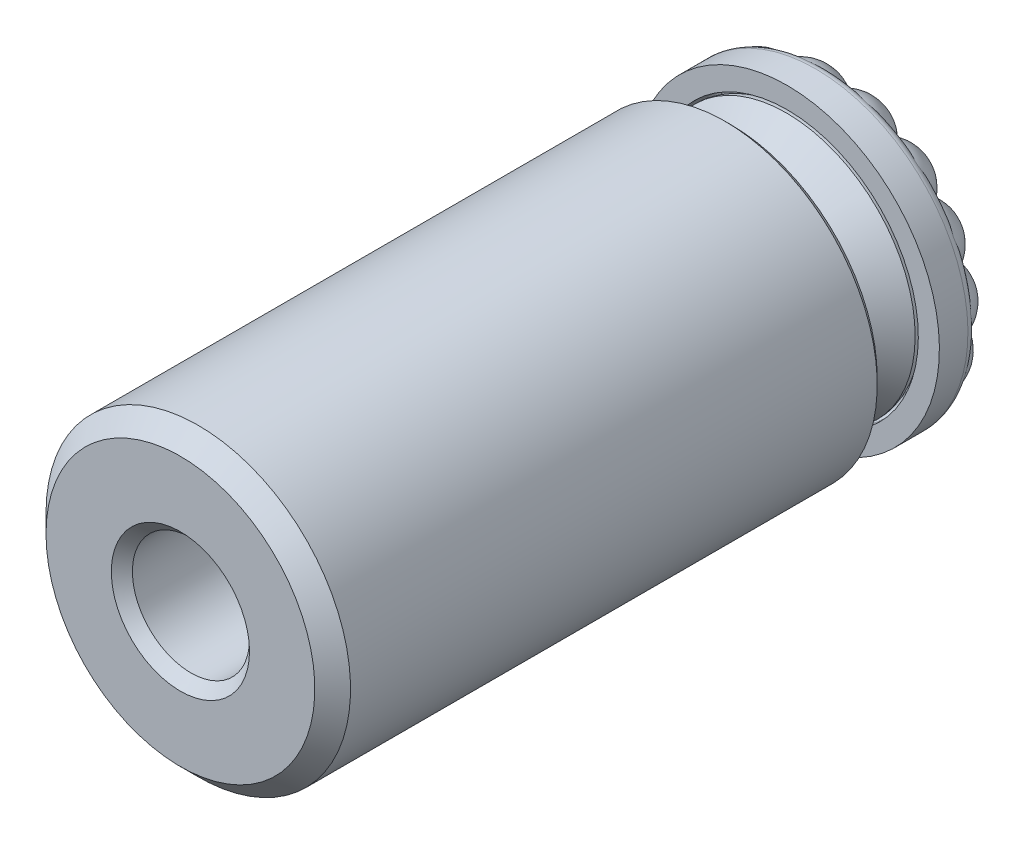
ISO-10303-21;
HEADER;
FILE_DESCRIPTION(('STEP AP214'),'2;1');
FILE_NAME('part.step','',(''),(''),'','','');
FILE_SCHEMA(('AUTOMOTIVE_DESIGN { 1 0 10303 214 1 1 1 1 }'));
ENDSEC;
DATA;
#1=APPLICATION_CONTEXT('core data for automotive mechanical design processes');
#2=APPLICATION_PROTOCOL_DEFINITION('international standard','automotive_design',2000,#1);
#3=PRODUCT_CONTEXT('',#1,'mechanical');
#4=PRODUCT('Part','Part','',(#3));
#5=PRODUCT_RELATED_PRODUCT_CATEGORY('part','',(#4));
#6=PRODUCT_DEFINITION_FORMATION('','',#4);
#7=PRODUCT_DEFINITION_CONTEXT('part definition',#1,'design');
#8=PRODUCT_DEFINITION('design','',#6,#7);
#9=PRODUCT_DEFINITION_SHAPE('','',#8);
#10=(LENGTH_UNIT() NAMED_UNIT(*) SI_UNIT(.MILLI.,.METRE.));
#11=(NAMED_UNIT(*) PLANE_ANGLE_UNIT() SI_UNIT($,.RADIAN.));
#12=(NAMED_UNIT(*) SI_UNIT($,.STERADIAN.) SOLID_ANGLE_UNIT());
#13=UNCERTAINTY_MEASURE_WITH_UNIT(LENGTH_MEASURE(1.E-05),#10,'distance_accuracy_value','');
#14=(GEOMETRIC_REPRESENTATION_CONTEXT(3) GLOBAL_UNCERTAINTY_ASSIGNED_CONTEXT((#13)) GLOBAL_UNIT_ASSIGNED_CONTEXT((#10,
#11,#12)) REPRESENTATION_CONTEXT('',''));
#15=CARTESIAN_POINT('',(0.,0.,0.));
#16=DIRECTION('',(0.,0.,1.));
#17=DIRECTION('',(1.,0.,0.));
#18=AXIS2_PLACEMENT_3D('',#15,#16,#17);
#19=CARTESIAN_POINT('',(0.,0.,6.2192));
#20=DIRECTION('',(0.,0.,1.));
#21=DIRECTION('',(1.,0.,0.));
#22=AXIS2_PLACEMENT_3D('',#19,#20,#21);
#23=PLANE('',#22);
#24=CARTESIAN_POINT('',(0.,0.,6.2192));
#25=DIRECTION('',(0.,0.,1.));
#26=DIRECTION('',(1.,0.,0.));
#27=AXIS2_PLACEMENT_3D('',#24,#25,#26);
#28=CIRCLE('',#27,5.0673);
#29=CARTESIAN_POINT('',(5.0673,0.,6.2192));
#30=VERTEX_POINT('',#29);
#31=EDGE_CURVE('E754',#30,#30,#28,.F.);
#32=ORIENTED_EDGE('',*,*,#31,.T.);
#33=EDGE_LOOP('',(#32));
#34=FACE_BOUND('',#33,.T.);
#35=CARTESIAN_POINT('',(0.,0.,6.2192));
#36=DIRECTION('',(0.,0.,1.));
#37=DIRECTION('',(1.,0.,0.));
#38=AXIS2_PLACEMENT_3D('',#35,#36,#37);
#39=CIRCLE('',#38,4.44877097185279);
#40=CARTESIAN_POINT('',(1.32147520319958,4.24797203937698,6.2192));
#41=VERTEX_POINT('',#40);
#42=EDGE_CURVE('E9',#41,#41,#39,.F.);
#43=ORIENTED_EDGE('',*,*,#42,.F.);
#44=EDGE_LOOP('',(#43));
#45=FACE_BOUND('',#44,.T.);
#46=ADVANCED_FACE('F14',(#34,#45),#23,.F.);
#47=CARTESIAN_POINT('',(0.,0.,28.5));
#48=DIRECTION('',(0.,0.,-1.));
#49=DIRECTION('',(-1.,0.,0.));
#50=AXIS2_PLACEMENT_3D('',#47,#48,#49);
#51=CYLINDRICAL_SURFACE('',#50,6.5);
#52=CARTESIAN_POINT('',(0.,0.,27.738));
#53=DIRECTION('',(0.,0.,-1.));
#54=DIRECTION('',(-1.,0.,0.));
#55=AXIS2_PLACEMENT_3D('',#52,#53,#54);
#56=CIRCLE('',#55,6.5);
#57=CARTESIAN_POINT('',(-6.5,0.,27.738));
#58=VERTEX_POINT('',#57);
#59=EDGE_CURVE('E767',#58,#58,#56,.T.);
#60=ORIENTED_EDGE('',*,*,#59,.T.);
#61=EDGE_LOOP('',(#60));
#62=FACE_BOUND('',#61,.T.);
#63=CARTESIAN_POINT('',(0.,0.,5.254));
#64=DIRECTION('',(0.,0.,-1.));
#65=DIRECTION('',(-1.,0.,0.));
#66=AXIS2_PLACEMENT_3D('',#63,#64,#65);
#67=CIRCLE('',#66,6.5);
#68=CARTESIAN_POINT('',(-6.5,0.,5.254));
#69=VERTEX_POINT('',#68);
#70=EDGE_CURVE('E764',#69,#69,#67,.F.);
#71=ORIENTED_EDGE('',*,*,#70,.T.);
#72=EDGE_LOOP('',(#71));
#73=FACE_BOUND('',#72,.T.);
#74=ADVANCED_FACE('F725',(#62,#73),#51,.T.);
#75=CARTESIAN_POINT('',(0.,0.,28.5));
#76=DIRECTION('',(0.,0.,-1.));
#77=DIRECTION('',(-1.,0.,0.));
#78=AXIS2_PLACEMENT_3D('',#75,#76,#77);
#79=PLANE('',#78);
#80=CARTESIAN_POINT('',(0.,0.,28.5));
#81=DIRECTION('',(0.,0.,-1.));
#82=DIRECTION('',(-1.,0.,0.));
#83=AXIS2_PLACEMENT_3D('',#80,#81,#82);
#84=CIRCLE('',#83,5.738);
#85=CARTESIAN_POINT('',(-5.738,0.,28.5));
#86=VERTEX_POINT('',#85);
#87=EDGE_CURVE('E23',#86,#86,#84,.F.);
#88=ORIENTED_EDGE('',*,*,#87,.T.);
#89=EDGE_LOOP('',(#88));
#90=FACE_BOUND('',#89,.T.);
#91=CARTESIAN_POINT('',(0.,0.,28.5));
#92=DIRECTION('',(0.,0.,1.));
#93=DIRECTION('',(1.,0.,0.));
#94=AXIS2_PLACEMENT_3D('',#91,#92,#93);
#95=CIRCLE('',#94,2.95);
#96=CARTESIAN_POINT('',(2.95,0.,28.5));
#97=VERTEX_POINT('',#96);
#98=EDGE_CURVE('E303',#97,#97,#95,.T.);
#99=ORIENTED_EDGE('',*,*,#98,.F.);
#100=EDGE_LOOP('',(#99));
#101=FACE_BOUND('',#100,.T.);
#102=ADVANCED_FACE('F732',(#90,#101),#79,.F.);
#103=CARTESIAN_POINT('',(0.,0.,5.));
#104=DIRECTION('',(0.,0.,-1.));
#105=DIRECTION('',(-1.,0.,0.));
#106=AXIS2_PLACEMENT_3D('',#103,#104,#105);
#107=PLANE('',#106);
#108=CARTESIAN_POINT('',(0.,0.,5.));
#109=DIRECTION('',(0.,0.,-1.));
#110=DIRECTION('',(-1.,0.,0.));
#111=AXIS2_PLACEMENT_3D('',#108,#109,#110);
#112=CIRCLE('',#111,5.3213);
#113=CARTESIAN_POINT('',(-5.3213,0.,5.));
#114=VERTEX_POINT('',#113);
#115=EDGE_CURVE('E749',#114,#114,#112,.F.);
#116=ORIENTED_EDGE('',*,*,#115,.T.);
#117=EDGE_LOOP('',(#116));
#118=FACE_BOUND('',#117,.T.);
#119=CARTESIAN_POINT('',(0.,0.,5.));
#120=DIRECTION('',(0.,0.,-1.));
#121=DIRECTION('',(-1.,0.,0.));
#122=AXIS2_PLACEMENT_3D('',#119,#120,#121);
#123=CIRCLE('',#122,6.246);
#124=CARTESIAN_POINT('',(-6.246,0.,5.));
#125=VERTEX_POINT('',#124);
#126=EDGE_CURVE('E753',#125,#125,#123,.T.);
#127=ORIENTED_EDGE('',*,*,#126,.T.);
#128=EDGE_LOOP('',(#127));
#129=FACE_BOUND('',#128,.T.);
#130=ADVANCED_FACE('F730',(#118,#129),#107,.T.);
#131=CARTESIAN_POINT('',(0.,0.,10.4356));
#132=DIRECTION('',(0.,0.,-1.));
#133=DIRECTION('',(-1.,0.,0.));
#134=AXIS2_PLACEMENT_3D('',#131,#132,#133);
#135=CYLINDRICAL_SURFACE('',#134,5.0673);
#136=CARTESIAN_POINT('',(0.,0.,5.254));
#137=DIRECTION('',(0.,0.,-1.));
#138=DIRECTION('',(-1.,0.,0.));
#139=AXIS2_PLACEMENT_3D('',#136,#137,#138);
#140=CIRCLE('',#139,5.0673);
#141=CARTESIAN_POINT('',(-5.0673,0.,5.254));
#142=VERTEX_POINT('',#141);
#143=EDGE_CURVE('E752',#142,#142,#140,.T.);
#144=ORIENTED_EDGE('',*,*,#143,.T.);
#145=EDGE_LOOP('',(#144));
#146=FACE_BOUND('',#145,.T.);
#147=ORIENTED_EDGE('',*,*,#31,.F.);
#148=EDGE_LOOP('',(#147));
#149=FACE_BOUND('',#148,.T.);
#150=ADVANCED_FACE('F727',(#146,#149),#135,.F.);
#151=CARTESIAN_POINT('',(0.,0.,5.254));
#152=DIRECTION('',(0.,0.,-1.));
#153=DIRECTION('',(-1.,0.,0.));
#154=AXIS2_PLACEMENT_3D('',#151,#152,#153);
#155=CONICAL_SURFACE('',#154,5.0673,0.785398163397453);
#156=ORIENTED_EDGE('',*,*,#115,.F.);
#157=EDGE_LOOP('',(#156));
#158=FACE_BOUND('',#157,.T.);
#159=ORIENTED_EDGE('',*,*,#143,.F.);
#160=EDGE_LOOP('',(#159));
#161=FACE_BOUND('',#160,.T.);
#162=ADVANCED_FACE('F697',(#158,#161),#155,.F.);
#163=CARTESIAN_POINT('',(0.,0.,5.));
#164=DIRECTION('',(0.,0.,1.));
#165=DIRECTION('',(1.,0.,0.));
#166=AXIS2_PLACEMENT_3D('',#163,#164,#165);
#167=CONICAL_SURFACE('',#166,6.246,0.785398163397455);
#168=ORIENTED_EDGE('',*,*,#70,.F.);
#169=EDGE_LOOP('',(#168));
#170=FACE_BOUND('',#169,.T.);
#171=ORIENTED_EDGE('',*,*,#126,.F.);
#172=EDGE_LOOP('',(#171));
#173=FACE_BOUND('',#172,.T.);
#174=ADVANCED_FACE('F690',(#170,#173),#167,.T.);
#175=CARTESIAN_POINT('',(0.,0.,27.738));
#176=DIRECTION('',(0.,0.,-1.));
#177=DIRECTION('',(-1.,0.,0.));
#178=AXIS2_PLACEMENT_3D('',#175,#176,#177);
#179=CONICAL_SURFACE('',#178,6.5,0.78539816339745);
#180=ORIENTED_EDGE('',*,*,#87,.F.);
#181=EDGE_LOOP('',(#180));
#182=FACE_BOUND('',#181,.T.);
#183=ORIENTED_EDGE('',*,*,#59,.F.);
#184=EDGE_LOOP('',(#183));
#185=FACE_BOUND('',#184,.T.);
#186=ADVANCED_FACE('F686',(#182,#185),#179,.T.);
#187=CARTESIAN_POINT('',(0.,0.,3.1750000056));
#188=DIRECTION('',(0.,0.,1.));
#189=DIRECTION('',(0.297042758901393,0.954864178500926,0.));
#190=AXIS2_PLACEMENT_3D('',#187,#188,#189);
#191=SPHERICAL_SURFACE('',#190,3.175);
#192=CARTESIAN_POINT('',(-2.42535501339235,0.754488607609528,1.9050000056));
#193=DIRECTION('',(0.854056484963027,-0.265683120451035,0.447213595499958));
#194=DIRECTION('',(0.427028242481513,-0.132841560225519,-0.894427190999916));
#195=AXIS2_PLACEMENT_3D('',#192,#193,#194);
#196=CIRCLE('',#195,1.41990316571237);
#197=CARTESIAN_POINT('',(-2.1860457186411,-0.199712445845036,0.881107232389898));
#198=VERTEX_POINT('',#197);
#199=CARTESIAN_POINT('',(-1.68698577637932,1.40454972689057,0.881107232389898));
#200=VERTEX_POINT('',#199);
#201=EDGE_CURVE('E316',#198,#200,#196,.T.);
#202=ORIENTED_EDGE('',*,*,#201,.T.);
#203=CARTESIAN_POINT('',(-1.18148096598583,2.24848898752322,1.9050000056));
#204=DIRECTION('',(0.416042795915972,-0.791775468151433,0.447213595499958));
#205=DIRECTION('',(0.885231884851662,0.465149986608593,0.));
#206=AXIS2_PLACEMENT_3D('',#203,#204,#205);
#207=CIRCLE('',#206,1.41990316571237);
#208=CARTESIAN_POINT('',(-0.199712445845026,2.1860457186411,0.881107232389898));
#209=VERTEX_POINT('',#208);
#210=EDGE_CURVE('E38',#200,#209,#207,.T.);
#211=ORIENTED_EDGE('',*,*,#210,.T.);
#212=CARTESIAN_POINT('',(0.754488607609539,2.42535501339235,1.9050000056));
#213=DIRECTION('',(-0.265683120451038,-0.854056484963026,0.447213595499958));
#214=DIRECTION('',(0.132841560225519,0.427028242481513,0.894427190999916));
#215=AXIS2_PLACEMENT_3D('',#212,#213,#214);
#216=CIRCLE('',#215,1.41990316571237);
#217=CARTESIAN_POINT('',(1.40454972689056,1.68698577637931,0.881107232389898));
#218=VERTEX_POINT('',#217);
#219=EDGE_CURVE('E31',#209,#218,#216,.T.);
#220=ORIENTED_EDGE('',*,*,#219,.T.);
#221=CARTESIAN_POINT('',(2.24848898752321,1.18148096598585,1.9050000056));
#222=DIRECTION('',(-0.791775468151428,-0.416042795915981,0.447213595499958));
#223=DIRECTION('',(0.465149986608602,-0.885231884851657,0.));
#224=AXIS2_PLACEMENT_3D('',#221,#222,#223);
#225=CIRCLE('',#224,1.41990316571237);
#226=CARTESIAN_POINT('',(2.18604571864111,0.199712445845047,0.881107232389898));
#227=VERTEX_POINT('',#226);
#228=EDGE_CURVE('E279',#218,#227,#225,.T.);
#229=ORIENTED_EDGE('',*,*,#228,.T.);
#230=CARTESIAN_POINT('',(2.42535501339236,-0.754488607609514,1.9050000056));
#231=DIRECTION('',(-0.854056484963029,0.265683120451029,0.447213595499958));
#232=DIRECTION('',(0.427028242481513,-0.132841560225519,0.894427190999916));
#233=AXIS2_PLACEMENT_3D('',#230,#231,#232);
#234=CIRCLE('',#233,1.41990316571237);
#235=CARTESIAN_POINT('',(1.68698577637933,-1.40454972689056,0.881107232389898));
#236=VERTEX_POINT('',#235);
#237=EDGE_CURVE('E291',#227,#236,#234,.T.);
#238=ORIENTED_EDGE('',*,*,#237,.T.);
#239=CARTESIAN_POINT('',(1.18148096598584,-2.24848898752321,1.9050000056));
#240=DIRECTION('',(-0.416042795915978,0.791775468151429,0.447213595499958));
#241=DIRECTION('',(-0.885231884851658,-0.4651499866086,0.));
#242=AXIS2_PLACEMENT_3D('',#239,#240,#241);
#243=CIRCLE('',#242,1.41990316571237);
#244=CARTESIAN_POINT('',(0.199712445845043,-2.1860457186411,0.881107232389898));
#245=VERTEX_POINT('',#244);
#246=EDGE_CURVE('E296',#236,#245,#243,.T.);
#247=ORIENTED_EDGE('',*,*,#246,.T.);
#248=CARTESIAN_POINT('',(-0.75448860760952,-2.42535501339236,1.9050000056));
#249=DIRECTION('',(0.265683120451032,0.854056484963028,0.447213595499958));
#250=DIRECTION('',(0.132841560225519,0.427028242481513,-0.894427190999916));
#251=AXIS2_PLACEMENT_3D('',#248,#249,#250);
#252=CIRCLE('',#251,1.41990316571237);
#253=CARTESIAN_POINT('',(-1.40454972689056,-1.68698577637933,0.881107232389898));
#254=VERTEX_POINT('',#253);
#255=EDGE_CURVE('E310',#245,#254,#252,.T.);
#256=ORIENTED_EDGE('',*,*,#255,.T.);
#257=CARTESIAN_POINT('',(-2.24848898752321,-1.18148096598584,1.9050000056));
#258=DIRECTION('',(0.791775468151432,0.416042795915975,0.447213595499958));
#259=DIRECTION('',(-0.465149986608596,0.88523188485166,0.));
#260=AXIS2_PLACEMENT_3D('',#257,#258,#259);
#261=CIRCLE('',#260,1.41990316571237);
#262=EDGE_CURVE('E313',#254,#198,#261,.T.);
#263=ORIENTED_EDGE('',*,*,#262,.T.);
#264=EDGE_LOOP('',(#202,#211,#220,#229,#238,#247,#256,#263));
#265=FACE_BOUND('',#264,.T.);
#266=ADVANCED_FACE('F299',(#265),#191,.T.);
#267=CARTESIAN_POINT('',(2.81061123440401,1.47685120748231,1.5875000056));
#268=DIRECTION('',(0.,0.,-1.));
#269=DIRECTION('',(-0.885231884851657,-0.465149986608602,0.));
#270=AXIS2_PLACEMENT_3D('',#267,#268,#269);
#271=SPHERICAL_SURFACE('',#270,1.5875);
#272=ORIENTED_EDGE('',*,*,#228,.F.);
#273=CARTESIAN_POINT('',(1.87686099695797,2.25427248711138,1.5875000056));
#274=DIRECTION('',(0.768506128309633,-0.639842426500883,0.));
#275=DIRECTION('',(0.639842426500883,0.768506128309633,0.));
#276=AXIS2_PLACEMENT_3D('',#273,#274,#275);
#277=CIRCLE('',#276,1.02170587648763);
#278=CARTESIAN_POINT('',(2.27141404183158,2.72816483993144,0.7728609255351));
#279=VERTEX_POINT('',#278);
#280=EDGE_CURVE('E625',#218,#279,#277,.T.);
#281=ORIENTED_EDGE('',*,*,#280,.T.);
#282=CARTESIAN_POINT('',(2.97691857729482,2.62606878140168,1.5875000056));
#283=DIRECTION('',(0.143221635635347,0.989690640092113,0.));
#284=DIRECTION('',(-0.989690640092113,0.143221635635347,0.));
#285=AXIS2_PLACEMENT_3D('',#282,#283,#284);
#286=CIRCLE('',#285,1.08249576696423);
#287=CARTESIAN_POINT('',(3.20551216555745,2.59298819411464,0.529933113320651));
#288=VERTEX_POINT('',#287);
#289=EDGE_CURVE('E605',#279,#288,#286,.F.);
#290=ORIENTED_EDGE('',*,*,#289,.T.);
#291=CARTESIAN_POINT('',(3.57965643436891,1.88095025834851,1.5875000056));
#292=DIRECTION('',(0.885231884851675,0.465149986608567,0.));
#293=DIRECTION('',(-0.465149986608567,0.885231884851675,0.));
#294=AXIS2_PLACEMENT_3D('',#291,#292,#293);
#295=CIRCLE('',#294,1.32869473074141);
#296=CARTESIAN_POINT('',(3.95380070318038,1.16891232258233,0.529933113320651));
#297=VERTEX_POINT('',#296);
#298=EDGE_CURVE('E571',#288,#297,#295,.F.);
#299=ORIENTED_EDGE('',*,*,#298,.T.);
#300=CARTESIAN_POINT('',(3.85136909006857,0.961892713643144,1.5875000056));
#301=DIRECTION('',(0.896286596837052,-0.443475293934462,0.));
#302=DIRECTION('',(0.443475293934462,0.896286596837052,0.));
#303=AXIS2_PLACEMENT_3D('',#300,#301,#302);
#304=CIRCLE('',#303,1.08249576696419);
#305=CARTESIAN_POINT('',(3.53523613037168,0.322971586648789,0.7728609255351));
#306=VERTEX_POINT('',#305);
#307=EDGE_CURVE('E282',#297,#306,#304,.F.);
#308=ORIENTED_EDGE('',*,*,#307,.T.);
#309=CARTESIAN_POINT('',(2.92115250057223,0.266870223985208,1.5875000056));
#310=DIRECTION('',(-0.0909789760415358,0.995852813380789,0.));
#311=DIRECTION('',(-0.99585281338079,-0.090978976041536,0.));
#312=AXIS2_PLACEMENT_3D('',#309,#310,#311);
#313=CIRCLE('',#312,1.02170587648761);
#314=EDGE_CURVE('E275',#306,#227,#313,.T.);
#315=ORIENTED_EDGE('',*,*,#314,.T.);
#316=EDGE_LOOP('',(#272,#281,#290,#299,#308,#315));
#317=FACE_BOUND('',#316,.T.);
#318=ADVANCED_FACE('F277',(#317),#271,.T.);
#319=CARTESIAN_POINT('',(3.03169376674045,-0.943110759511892,1.5875000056));
#320=DIRECTION('',(0.,0.,-1.));
#321=DIRECTION('',(-0.954864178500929,0.297042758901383,0.));
#322=AXIS2_PLACEMENT_3D('',#319,#320,#321);
#323=SPHERICAL_SURFACE('',#322,1.5875);
#324=ORIENTED_EDGE('',*,*,#237,.F.);
#325=ORIENTED_EDGE('',*,*,#314,.F.);
#326=CARTESIAN_POINT('',(3.9619103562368,-0.248088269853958,1.5875000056));
#327=DIRECTION('',(0.801089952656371,0.598543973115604,0.));
#328=DIRECTION('',(-0.598543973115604,0.801089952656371,0.));
#329=AXIS2_PLACEMENT_3D('',#326,#327,#328);
#330=CIRCLE('',#329,1.08249576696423);
#331=CARTESIAN_POINT('',(4.10015892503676,-0.433119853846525,0.529933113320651));
#332=VERTEX_POINT('',#331);
#333=EDGE_CURVE('E561',#306,#332,#330,.F.);
#334=ORIENTED_EDGE('',*,*,#333,.T.);
#335=CARTESIAN_POINT('',(3.86123202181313,-1.2011666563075,1.5875000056));
#336=DIRECTION('',(0.954864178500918,-0.297042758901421,0.));
#337=DIRECTION('',(0.297042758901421,0.954864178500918,0.));
#338=AXIS2_PLACEMENT_3D('',#335,#336,#337);
#339=CIRCLE('',#338,1.32869473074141);
#340=CARTESIAN_POINT('',(3.62230511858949,-1.96921345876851,0.529933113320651));
#341=VERTEX_POINT('',#340);
#342=EDGE_CURVE('E543',#332,#341,#339,.F.);
#343=ORIENTED_EDGE('',*,*,#342,.T.);
#344=CARTESIAN_POINT('',(3.40349006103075,-2.04316833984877,1.5875000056));
#345=DIRECTION('',(0.320185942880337,-0.947354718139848,0.));
#346=DIRECTION('',(0.947354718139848,0.320185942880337,0.));
#347=AXIS2_PLACEMENT_3D('',#344,#345,#346);
#348=CIRCLE('',#347,1.08249576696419);
#349=CARTESIAN_POINT('',(2.72816483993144,-2.27141404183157,0.7728609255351));
#350=VERTEX_POINT('',#349);
#351=EDGE_CURVE('E514',#341,#350,#348,.F.);
#352=ORIENTED_EDGE('',*,*,#351,.T.);
#353=CARTESIAN_POINT('',(2.25427248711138,-1.87686099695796,1.5875000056));
#354=DIRECTION('',(0.639842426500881,0.768506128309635,0.));
#355=DIRECTION('',(-0.768506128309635,0.639842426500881,0.));
#356=AXIS2_PLACEMENT_3D('',#353,#354,#355);
#357=CIRCLE('',#356,1.02170587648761);
#358=EDGE_CURVE('E287',#350,#236,#357,.T.);
#359=ORIENTED_EDGE('',*,*,#358,.T.);
#360=EDGE_LOOP('',(#324,#325,#334,#343,#352,#359));
#361=FACE_BOUND('',#360,.T.);
#362=ADVANCED_FACE('F292',(#361),#323,.T.);
#363=CARTESIAN_POINT('',(1.4768512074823,-2.81061123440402,1.5875000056));
#364=DIRECTION('',(0.,0.,-1.));
#365=DIRECTION('',(-0.4651499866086,0.885231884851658,0.));
#366=AXIS2_PLACEMENT_3D('',#363,#364,#365);
#367=SPHERICAL_SURFACE('',#366,1.5875);
#368=ORIENTED_EDGE('',*,*,#246,.F.);
#369=ORIENTED_EDGE('',*,*,#358,.F.);
#370=CARTESIAN_POINT('',(2.62606878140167,-2.97691857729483,1.5875000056));
#371=DIRECTION('',(0.989690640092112,-0.14322163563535,0.));
#372=DIRECTION('',(0.14322163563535,0.989690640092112,0.));
#373=AXIS2_PLACEMENT_3D('',#370,#371,#372);
#374=CIRCLE('',#373,1.08249576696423);
#375=CARTESIAN_POINT('',(2.59298819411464,-3.20551216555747,0.529933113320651));
#376=VERTEX_POINT('',#375);
#377=EDGE_CURVE('E542',#350,#376,#374,.F.);
#378=ORIENTED_EDGE('',*,*,#377,.T.);
#379=CARTESIAN_POINT('',(1.8809502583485,-3.57965643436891,1.5875000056));
#380=DIRECTION('',(0.465149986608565,-0.885231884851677,0.));
#381=DIRECTION('',(0.885231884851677,0.465149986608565,0.));
#382=AXIS2_PLACEMENT_3D('',#379,#380,#381);
#383=CIRCLE('',#382,1.32869473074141);
#384=CARTESIAN_POINT('',(1.16891232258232,-3.95380070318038,0.529933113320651));
#385=VERTEX_POINT('',#384);
#386=EDGE_CURVE('E500',#376,#385,#383,.F.);
#387=ORIENTED_EDGE('',*,*,#386,.T.);
#388=CARTESIAN_POINT('',(0.96189271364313,-3.85136909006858,1.5875000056));
#389=DIRECTION('',(-0.443475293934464,-0.89628659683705,0.));
#390=DIRECTION('',(0.89628659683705,-0.443475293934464,0.));
#391=AXIS2_PLACEMENT_3D('',#388,#389,#390);
#392=CIRCLE('',#391,1.08249576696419);
#393=CARTESIAN_POINT('',(0.322971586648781,-3.53523613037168,0.7728609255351));
#394=VERTEX_POINT('',#393);
#395=EDGE_CURVE('E482',#385,#394,#392,.F.);
#396=ORIENTED_EDGE('',*,*,#395,.T.);
#397=CARTESIAN_POINT('',(0.2668702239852,-2.92115250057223,1.5875000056));
#398=DIRECTION('',(0.99585281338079,0.0909789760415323,0.));
#399=DIRECTION('',(-0.0909789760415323,0.99585281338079,0.));
#400=AXIS2_PLACEMENT_3D('',#397,#398,#399);
#401=CIRCLE('',#400,1.02170587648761);
#402=EDGE_CURVE('E1275',#394,#245,#401,.T.);
#403=ORIENTED_EDGE('',*,*,#402,.T.);
#404=EDGE_LOOP('',(#368,#369,#378,#387,#396,#403));
#405=FACE_BOUND('',#404,.T.);
#406=ADVANCED_FACE('F637',(#405),#367,.T.);
#407=CARTESIAN_POINT('',(-0.9431107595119,-3.03169376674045,1.5875000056));
#408=DIRECTION('',(0.,0.,-1.));
#409=DIRECTION('',(0.297042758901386,0.954864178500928,0.));
#410=AXIS2_PLACEMENT_3D('',#407,#408,#409);
#411=SPHERICAL_SURFACE('',#410,1.5875);
#412=ORIENTED_EDGE('',*,*,#255,.F.);
#413=ORIENTED_EDGE('',*,*,#402,.F.);
#414=CARTESIAN_POINT('',(-0.24808826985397,-3.9619103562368,1.5875000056));
#415=DIRECTION('',(0.598543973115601,-0.801089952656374,0.));
#416=DIRECTION('',(0.801089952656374,0.598543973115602,0.));
#417=AXIS2_PLACEMENT_3D('',#414,#415,#416);
#418=CIRCLE('',#417,1.08249576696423);
#419=CARTESIAN_POINT('',(-0.433119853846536,-4.10015892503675,0.529933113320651));
#420=VERTEX_POINT('',#419);
#421=EDGE_CURVE('E489',#394,#420,#418,.F.);
#422=ORIENTED_EDGE('',*,*,#421,.T.);
#423=CARTESIAN_POINT('',(-1.20116665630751,-3.86123202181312,1.5875000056));
#424=DIRECTION('',(-0.297042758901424,-0.954864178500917,0.));
#425=DIRECTION('',(0.954864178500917,-0.297042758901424,0.));
#426=AXIS2_PLACEMENT_3D('',#423,#424,#425);
#427=CIRCLE('',#426,1.32869473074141);
#428=CARTESIAN_POINT('',(-1.96921345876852,-3.62230511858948,0.529933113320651));
#429=VERTEX_POINT('',#428);
#430=EDGE_CURVE('E456',#420,#429,#427,.F.);
#431=ORIENTED_EDGE('',*,*,#430,.T.);
#432=CARTESIAN_POINT('',(-2.04316833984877,-3.40349006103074,1.5875000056));
#433=DIRECTION('',(-0.947354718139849,-0.320185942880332,0.));
#434=DIRECTION('',(0.320185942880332,-0.947354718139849,0.));
#435=AXIS2_PLACEMENT_3D('',#432,#433,#434);
#436=CIRCLE('',#435,1.08249576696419);
#437=CARTESIAN_POINT('',(-2.27141404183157,-2.72816483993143,0.7728609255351));
#438=VERTEX_POINT('',#437);
#439=EDGE_CURVE('E440',#429,#438,#436,.F.);
#440=ORIENTED_EDGE('',*,*,#439,.T.);
#441=CARTESIAN_POINT('',(-1.87686099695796,-2.25427248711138,1.5875000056));
#442=DIRECTION('',(0.768506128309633,-0.639842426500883,0.));
#443=DIRECTION('',(0.639842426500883,0.768506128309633,0.));
#444=AXIS2_PLACEMENT_3D('',#441,#442,#443);
#445=CIRCLE('',#444,1.02170587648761);
#446=EDGE_CURVE('E1272',#438,#254,#445,.T.);
#447=ORIENTED_EDGE('',*,*,#446,.T.);
#448=EDGE_LOOP('',(#412,#413,#422,#431,#440,#447));
#449=FACE_BOUND('',#448,.T.);
#450=ADVANCED_FACE('F640',(#449),#411,.T.);
#451=CARTESIAN_POINT('',(-2.81061123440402,-1.47685120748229,1.5875000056));
#452=DIRECTION('',(0.,0.,-1.));
#453=DIRECTION('',(0.88523188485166,0.465149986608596,0.));
#454=AXIS2_PLACEMENT_3D('',#451,#452,#453);
#455=SPHERICAL_SURFACE('',#454,1.5875);
#456=ORIENTED_EDGE('',*,*,#262,.F.);
#457=ORIENTED_EDGE('',*,*,#446,.F.);
#458=CARTESIAN_POINT('',(-2.97691857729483,-2.62606878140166,1.5875000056));
#459=DIRECTION('',(-0.143221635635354,-0.989690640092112,0.));
#460=DIRECTION('',(0.989690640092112,-0.143221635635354,0.));
#461=AXIS2_PLACEMENT_3D('',#458,#459,#460);
#462=CIRCLE('',#461,1.08249576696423);
#463=CARTESIAN_POINT('',(-3.20551216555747,-2.59298819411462,0.529933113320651));
#464=VERTEX_POINT('',#463);
#465=EDGE_CURVE('E445',#438,#464,#462,.F.);
#466=ORIENTED_EDGE('',*,*,#465,.T.);
#467=CARTESIAN_POINT('',(-3.57965643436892,-1.88095025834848,1.5875000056));
#468=DIRECTION('',(-0.885231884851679,-0.465149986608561,0.));
#469=DIRECTION('',(0.465149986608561,-0.885231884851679,0.));
#470=AXIS2_PLACEMENT_3D('',#467,#468,#469);
#471=CIRCLE('',#470,1.32869473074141);
#472=CARTESIAN_POINT('',(-3.95380070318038,-1.16891232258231,0.529933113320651));
#473=VERTEX_POINT('',#472);
#474=EDGE_CURVE('E427',#464,#473,#471,.F.);
#475=ORIENTED_EDGE('',*,*,#474,.T.);
#476=CARTESIAN_POINT('',(-3.85136909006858,-0.961892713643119,1.5875000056));
#477=DIRECTION('',(-0.896286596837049,0.443475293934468,0.));
#478=DIRECTION('',(-0.443475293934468,-0.896286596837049,0.));
#479=AXIS2_PLACEMENT_3D('',#476,#477,#478);
#480=CIRCLE('',#479,1.08249576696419);
#481=CARTESIAN_POINT('',(-3.53523613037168,-0.322971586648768,0.7728609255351));
#482=VERTEX_POINT('',#481);
#483=EDGE_CURVE('E398',#473,#482,#480,.F.);
#484=ORIENTED_EDGE('',*,*,#483,.T.);
#485=CARTESIAN_POINT('',(-2.92115250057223,-0.26687022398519,1.5875000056));
#486=DIRECTION('',(0.0909789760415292,-0.99585281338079,0.));
#487=DIRECTION('',(0.99585281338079,0.0909789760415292,0.));
#488=AXIS2_PLACEMENT_3D('',#485,#486,#487);
#489=CIRCLE('',#488,1.02170587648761);
#490=EDGE_CURVE('E1269',#482,#198,#489,.T.);
#491=ORIENTED_EDGE('',*,*,#490,.T.);
#492=EDGE_LOOP('',(#456,#457,#466,#475,#484,#491));
#493=FACE_BOUND('',#492,.T.);
#494=ADVANCED_FACE('F644',(#493),#455,.T.);
#495=CARTESIAN_POINT('',(-3.03169376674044,0.94311075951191,1.5875000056));
#496=DIRECTION('',(0.,0.,-1.));
#497=DIRECTION('',(0.954864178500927,-0.29704275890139,0.));
#498=AXIS2_PLACEMENT_3D('',#495,#496,#497);
#499=SPHERICAL_SURFACE('',#498,1.5875);
#500=ORIENTED_EDGE('',*,*,#201,.F.);
#501=ORIENTED_EDGE('',*,*,#490,.F.);
#502=CARTESIAN_POINT('',(-3.9619103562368,0.248088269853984,1.5875000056));
#503=DIRECTION('',(-0.801089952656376,-0.598543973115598,0.));
#504=DIRECTION('',(0.598543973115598,-0.801089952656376,0.));
#505=AXIS2_PLACEMENT_3D('',#502,#503,#504);
#506=CIRCLE('',#505,1.08249576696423);
#507=CARTESIAN_POINT('',(-4.10015892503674,0.433119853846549,0.529933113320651));
#508=VERTEX_POINT('',#507);
#509=EDGE_CURVE('E426',#482,#508,#506,.F.);
#510=ORIENTED_EDGE('',*,*,#509,.T.);
#511=CARTESIAN_POINT('',(-3.86123202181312,1.20116665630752,1.5875000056));
#512=DIRECTION('',(-0.954864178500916,0.297042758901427,0.));
#513=DIRECTION('',(-0.297042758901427,-0.954864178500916,0.));
#514=AXIS2_PLACEMENT_3D('',#511,#512,#513);
#515=CIRCLE('',#514,1.32869473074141);
#516=CARTESIAN_POINT('',(-3.62230511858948,1.96921345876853,0.529933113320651));
#517=VERTEX_POINT('',#516);
#518=EDGE_CURVE('E385',#508,#517,#515,.F.);
#519=ORIENTED_EDGE('',*,*,#518,.T.);
#520=CARTESIAN_POINT('',(-3.40349006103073,2.04316833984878,1.5875000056));
#521=DIRECTION('',(-0.32018594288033,0.947354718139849,0.));
#522=DIRECTION('',(-0.947354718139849,-0.32018594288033,0.));
#523=AXIS2_PLACEMENT_3D('',#520,#521,#522);
#524=CIRCLE('',#523,1.08249576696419);
#525=CARTESIAN_POINT('',(-2.72816483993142,2.27141404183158,0.7728609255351));
#526=VERTEX_POINT('',#525);
#527=EDGE_CURVE('E367',#517,#526,#524,.F.);
#528=ORIENTED_EDGE('',*,*,#527,.T.);
#529=CARTESIAN_POINT('',(-2.25427248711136,1.87686099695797,1.5875000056));
#530=DIRECTION('',(-0.639842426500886,-0.768506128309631,0.));
#531=DIRECTION('',(0.768506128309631,-0.639842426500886,0.));
#532=AXIS2_PLACEMENT_3D('',#529,#530,#531);
#533=CIRCLE('',#532,1.02170587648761);
#534=EDGE_CURVE('E1267',#526,#200,#533,.T.);
#535=ORIENTED_EDGE('',*,*,#534,.T.);
#536=EDGE_LOOP('',(#500,#501,#510,#519,#528,#535));
#537=FACE_BOUND('',#536,.T.);
#538=ADVANCED_FACE('F648',(#537),#499,.T.);
#539=CARTESIAN_POINT('',(-1.47685120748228,2.81061123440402,1.5875000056));
#540=DIRECTION('',(0.,0.,-1.));
#541=DIRECTION('',(0.465149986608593,-0.885231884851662,0.));
#542=AXIS2_PLACEMENT_3D('',#539,#540,#541);
#543=SPHERICAL_SURFACE('',#542,1.5875);
#544=ORIENTED_EDGE('',*,*,#210,.F.);
#545=ORIENTED_EDGE('',*,*,#534,.F.);
#546=CARTESIAN_POINT('',(-2.62606878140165,2.97691857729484,1.5875000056));
#547=DIRECTION('',(-0.989690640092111,0.143221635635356,0.));
#548=DIRECTION('',(-0.143221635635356,-0.989690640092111,0.));
#549=AXIS2_PLACEMENT_3D('',#546,#547,#548);
#550=CIRCLE('',#549,1.08249576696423);
#551=CARTESIAN_POINT('',(-2.59298819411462,3.20551216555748,0.529933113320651));
#552=VERTEX_POINT('',#551);
#553=EDGE_CURVE('E374',#526,#552,#550,.F.);
#554=ORIENTED_EDGE('',*,*,#553,.T.);
#555=CARTESIAN_POINT('',(-1.88095025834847,3.57965643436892,1.5875000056));
#556=DIRECTION('',(-0.465149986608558,0.88523188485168,0.));
#557=DIRECTION('',(-0.88523188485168,-0.465149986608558,0.));
#558=AXIS2_PLACEMENT_3D('',#555,#556,#557);
#559=CIRCLE('',#558,1.32869473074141);
#560=CARTESIAN_POINT('',(-1.16891232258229,3.95380070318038,0.529933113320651));
#561=VERTEX_POINT('',#560);
#562=EDGE_CURVE('E1324',#552,#561,#559,.F.);
#563=ORIENTED_EDGE('',*,*,#562,.T.);
#564=CARTESIAN_POINT('',(-0.961892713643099,3.85136909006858,1.5875000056));
#565=DIRECTION('',(0.443475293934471,0.896286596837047,0.));
#566=DIRECTION('',(-0.896286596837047,0.443475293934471,0.));
#567=AXIS2_PLACEMENT_3D('',#564,#565,#566);
#568=CIRCLE('',#567,1.08249576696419);
#569=CARTESIAN_POINT('',(-0.322971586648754,3.53523613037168,0.7728609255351));
#570=VERTEX_POINT('',#569);
#571=EDGE_CURVE('E320',#561,#570,#568,.F.);
#572=ORIENTED_EDGE('',*,*,#571,.T.);
#573=CARTESIAN_POINT('',(-0.26687022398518,2.92115250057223,1.5875000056));
#574=DIRECTION('',(-0.99585281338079,-0.0909789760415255,0.));
#575=DIRECTION('',(0.0909789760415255,-0.99585281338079,0.));
#576=AXIS2_PLACEMENT_3D('',#573,#574,#575);
#577=CIRCLE('',#576,1.02170587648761);
#578=EDGE_CURVE('E1263',#570,#209,#577,.T.);
#579=ORIENTED_EDGE('',*,*,#578,.T.);
#580=EDGE_LOOP('',(#544,#545,#554,#563,#572,#579));
#581=FACE_BOUND('',#580,.T.);
#582=ADVANCED_FACE('F652',(#581),#543,.T.);
#583=CARTESIAN_POINT('',(0.943110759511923,3.03169376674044,1.5875000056));
#584=DIRECTION('',(0.,0.,-1.));
#585=DIRECTION('',(-0.297042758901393,-0.954864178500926,0.));
#586=AXIS2_PLACEMENT_3D('',#583,#584,#585);
#587=SPHERICAL_SURFACE('',#586,1.5875);
#588=ORIENTED_EDGE('',*,*,#219,.F.);
#589=ORIENTED_EDGE('',*,*,#578,.F.);
#590=CARTESIAN_POINT('',(0.248088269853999,3.96191035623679,1.5875000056));
#591=DIRECTION('',(-0.598543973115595,0.801089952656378,0.));
#592=DIRECTION('',(-0.801089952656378,-0.598543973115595,0.));
#593=AXIS2_PLACEMENT_3D('',#590,#591,#592);
#594=CIRCLE('',#593,1.08249576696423);
#595=CARTESIAN_POINT('',(0.433119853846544,4.10015892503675,0.529933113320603));
#596=VERTEX_POINT('',#595);
#597=EDGE_CURVE('E325',#570,#596,#594,.F.);
#598=ORIENTED_EDGE('',*,*,#597,.T.);
#599=CARTESIAN_POINT('',(1.20116665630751,3.86123202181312,1.5875000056));
#600=DIRECTION('',(0.297042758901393,0.954864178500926,0.));
#601=DIRECTION('',(0.,0.,-1.));
#602=AXIS2_PLACEMENT_3D('',#599,#600,#601);
#603=CIRCLE('',#602,1.32869473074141);
#604=CARTESIAN_POINT('',(1.9692134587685,3.62230511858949,0.529933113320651));
#605=VERTEX_POINT('',#604);
#606=EDGE_CURVE('E286',#596,#605,#603,.F.);
#607=ORIENTED_EDGE('',*,*,#606,.T.);
#608=CARTESIAN_POINT('',(2.04316833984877,3.40349006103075,1.5875000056));
#609=DIRECTION('',(0.947354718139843,0.320185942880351,0.));
#610=DIRECTION('',(-0.320185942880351,0.947354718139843,0.));
#611=AXIS2_PLACEMENT_3D('',#608,#609,#610);
#612=CIRCLE('',#611,1.08249576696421);
#613=EDGE_CURVE('E597',#605,#279,#612,.F.);
#614=ORIENTED_EDGE('',*,*,#613,.T.);
#615=ORIENTED_EDGE('',*,*,#280,.F.);
#616=EDGE_LOOP('',(#588,#589,#598,#607,#614,#615));
#617=FACE_BOUND('',#616,.T.);
#618=ADVANCED_FACE('F656',(#617),#587,.T.);
#619=CARTESIAN_POINT('',(1.81760464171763,5.84281390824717,1.0000000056));
#620=DIRECTION('',(0.,0.,1.));
#621=DIRECTION('',(0.954864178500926,-0.297042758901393,0.));
#622=AXIS2_PLACEMENT_3D('',#619,#620,#621);
#623=PLANE('',#622);
#624=CARTESIAN_POINT('',(-0.446934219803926,4.89212694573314,1.0000000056));
#625=DIRECTION('',(0.,0.,1.));
#626=DIRECTION('',(0.954864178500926,-0.297042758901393,0.));
#627=AXIS2_PLACEMENT_3D('',#624,#625,#626);
#628=CIRCLE('',#627,1.47478812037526);
#629=CARTESIAN_POINT('',(0.38979998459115,6.10657162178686,1.0000000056));
#630=VERTEX_POINT('',#629);
#631=CARTESIAN_POINT('',(0.623899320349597,5.90618588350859,1.0000000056));
#632=VERTEX_POINT('',#631);
#633=EDGE_CURVE('E326',#630,#632,#628,.F.);
#634=ORIENTED_EDGE('',*,*,#633,.F.);
#635=CARTESIAN_POINT('',(0.,0.,1.0000000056));
#636=DIRECTION('',(0.,0.,-1.));
#637=DIRECTION('',(-0.954864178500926,0.297042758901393,0.));
#638=AXIS2_PLACEMENT_3D('',#635,#636,#637);
#639=CIRCLE('',#638,6.119);
#640=CARTESIAN_POINT('',(0.894700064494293,6.05323655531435,1.0000000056));
#641=VERTEX_POINT('',#640);
#642=EDGE_CURVE('E1242',#630,#641,#639,.T.);
#643=ORIENTED_EDGE('',*,*,#642,.T.);
#644=CARTESIAN_POINT('',(1.45922255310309,4.6907702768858,1.0000000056));
#645=DIRECTION('',(0.,0.,1.));
#646=DIRECTION('',(0.954864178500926,-0.297042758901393,0.));
#647=AXIS2_PLACEMENT_3D('',#644,#645,#646);
#648=CIRCLE('',#647,1.47478812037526);
#649=EDGE_CURVE('E618',#632,#641,#648,.F.);
#650=ORIENTED_EDGE('',*,*,#649,.F.);
#651=EDGE_LOOP('',(#634,#643,#650));
#652=FACE_BOUND('',#651,.T.);
#653=ADVANCED_FACE('F631',(#652),#623,.F.);
#654=CARTESIAN_POINT('',(1.45922255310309,4.6907702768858,1.5875000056));
#655=DIRECTION('',(0.,0.,-1.));
#656=DIRECTION('',(0.297042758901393,0.954864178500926,0.));
#657=AXIS2_PLACEMENT_3D('',#654,#655,#656);
#658=SPHERICAL_SURFACE('',#657,1.5875);
#659=CARTESIAN_POINT('',(0.506144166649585,4.79144861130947,1.5875000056));
#660=DIRECTION('',(-0.994466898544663,0.105050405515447,0.));
#661=DIRECTION('',(-0.105050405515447,-0.994466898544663,0.));
#662=AXIS2_PLACEMENT_3D('',#659,#660,#661);
#663=CIRCLE('',#662,1.26556774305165);
#664=EDGE_CURVE('E336',#632,#596,#663,.T.);
#665=ORIENTED_EDGE('',*,*,#664,.F.);
#666=ORIENTED_EDGE('',*,*,#649,.T.);
#667=CARTESIAN_POINT('',(0.278126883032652,5.73125553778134,1.3812000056));
#668=CARTESIAN_POINT('',(0.281145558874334,5.73107806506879,1.36300338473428));
#669=CARTESIAN_POINT('',(0.285661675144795,5.73217106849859,1.34514413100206));
#670=CARTESIAN_POINT('',(0.297151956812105,5.73645854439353,1.31071236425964));
#671=CARTESIAN_POINT('',(0.304097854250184,5.73962920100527,1.29412762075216));
#672=CARTESIAN_POINT('',(0.319952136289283,5.74762304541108,1.26252433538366));
#673=CARTESIAN_POINT('',(0.328848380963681,5.75243610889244,1.24749691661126));
#674=CARTESIAN_POINT('',(0.348236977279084,5.76332466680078,1.21895843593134));
#675=CARTESIAN_POINT('',(0.358734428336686,5.76940421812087,1.20545246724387));
#676=CARTESIAN_POINT('',(0.387984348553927,5.78659071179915,1.17198442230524));
#677=CARTESIAN_POINT('',(0.407771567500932,5.79845221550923,1.15331439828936));
#678=CARTESIAN_POINT('',(0.449614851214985,5.82346288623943,1.11980757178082));
#679=CARTESIAN_POINT('',(0.471675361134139,5.83661457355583,1.10497848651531));
#680=CARTESIAN_POINT('',(0.5295939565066,5.87059385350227,1.07173554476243));
#681=CARTESIAN_POINT('',(0.566549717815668,5.8917834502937,1.0556102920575));
#682=CARTESIAN_POINT('',(0.642882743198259,5.93372989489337,1.02994131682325));
#683=CARTESIAN_POINT('',(0.682265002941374,5.95448572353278,1.02041170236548));
#684=CARTESIAN_POINT('',(0.78191118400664,6.00413893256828,1.00357633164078));
#685=CARTESIAN_POINT('',(0.843152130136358,6.03218127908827,0.999515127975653));
#686=CARTESIAN_POINT('',(0.967514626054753,6.08304566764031,1.00057602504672));
#687=CARTESIAN_POINT('',(1.0306357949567,6.10586875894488,1.00569627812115));
#688=CARTESIAN_POINT('',(1.17620248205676,6.15075941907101,1.02541882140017));
#689=CARTESIAN_POINT('',(1.25899697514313,6.17073197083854,1.04231988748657));
#690=CARTESIAN_POINT('',(1.3836607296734,6.19127719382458,1.07287670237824));
#691=CARTESIAN_POINT('',(1.42548011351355,6.19655883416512,1.08399075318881));
#692=CARTESIAN_POINT('',(1.50915931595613,6.20365326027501,1.10714703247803));
#693=CARTESIAN_POINT('',(1.55101910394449,6.20546777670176,1.11918879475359));
#694=CARTESIAN_POINT('',(1.61930278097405,6.20525254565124,1.13847160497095));
#695=CARTESIAN_POINT('',(1.64569843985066,6.2043981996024,1.14583804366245));
#696=CARTESIAN_POINT('',(1.69860746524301,6.20096921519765,1.15982964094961));
#697=CARTESIAN_POINT('',(1.72512090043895,6.19839338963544,1.16645428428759));
#698=CARTESIAN_POINT('',(1.777757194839,6.19133002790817,1.17794400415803));
#699=CARTESIAN_POINT('',(1.80387771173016,6.18688036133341,1.18284058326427));
#700=CARTESIAN_POINT('',(1.8560046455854,6.17580119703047,1.18985392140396));
#701=CARTESIAN_POINT('',(1.88201118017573,6.16917761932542,1.19197815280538));
#702=CARTESIAN_POINT('',(1.92903648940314,6.15501931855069,1.19265504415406));
#703=CARTESIAN_POINT('',(1.95015205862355,6.14783053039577,1.19175313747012));
#704=CARTESIAN_POINT('',(1.99167095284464,6.13208059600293,1.18777802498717));
#705=CARTESIAN_POINT('',(2.01207315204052,6.12351739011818,1.18470153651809));
#706=CARTESIAN_POINT('',(2.07262874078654,6.09583838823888,1.17310770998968));
#707=CARTESIAN_POINT('',(2.11148630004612,6.07493649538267,1.16224993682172));
#708=CARTESIAN_POINT('',(2.18397805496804,6.03094396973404,1.13958216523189));
#709=CARTESIAN_POINT('',(2.21778694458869,6.00807205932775,1.12787422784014));
#710=CARTESIAN_POINT('',(2.28340403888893,5.95945792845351,1.10468261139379));
#711=CARTESIAN_POINT('',(2.31521105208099,5.93371402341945,1.09319906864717));
#712=CARTESIAN_POINT('',(2.37681753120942,5.87976245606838,1.07149685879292));
#713=CARTESIAN_POINT('',(2.40662625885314,5.85156778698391,1.06127214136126));
#714=CARTESIAN_POINT('',(2.46447646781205,5.79284791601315,1.04267732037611));
#715=CARTESIAN_POINT('',(2.49251774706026,5.76232244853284,1.03430742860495));
#716=CARTESIAN_POINT('',(2.56516866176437,5.67790910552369,1.01513903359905));
#717=CARTESIAN_POINT('',(2.60821163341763,5.62213798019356,1.006503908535));
#718=CARTESIAN_POINT('',(2.68929074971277,5.50633724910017,0.998482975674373));
#719=CARTESIAN_POINT('',(2.72732817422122,5.4463087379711,0.999094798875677));
#720=CARTESIAN_POINT('',(2.78579113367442,5.34588489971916,1.01016308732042));
#721=CARTESIAN_POINT('',(2.80772108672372,5.30597184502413,1.01709879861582));
#722=CARTESIAN_POINT('',(2.84932150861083,5.22651885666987,1.03717707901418));
#723=CARTESIAN_POINT('',(2.86899598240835,5.18697837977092,1.05030842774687));
#724=CARTESIAN_POINT('',(2.90012501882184,5.12217731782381,1.07874267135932));
#725=CARTESIAN_POINT('',(2.91221393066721,5.09634889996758,1.0920517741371));
#726=CARTESIAN_POINT('',(2.93519345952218,5.04659190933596,1.12270107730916));
#727=CARTESIAN_POINT('',(2.94608580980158,5.02266060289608,1.14003533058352));
#728=CARTESIAN_POINT('',(2.96342499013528,4.98481308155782,1.1733112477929));
#729=CARTESIAN_POINT('',(2.97022322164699,4.9700501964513,1.18810225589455));
#730=CARTESIAN_POINT('',(2.98304621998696,4.94284075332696,1.21999944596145));
#731=CARTESIAN_POINT('',(2.98907180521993,4.93039173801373,1.237103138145));
#732=CARTESIAN_POINT('',(2.99891843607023,4.91118944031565,1.26938760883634));
#733=CARTESIAN_POINT('',(3.00292919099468,4.9037846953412,1.28412104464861));
#734=CARTESIAN_POINT('',(3.01027683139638,4.89141318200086,1.31471274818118));
#735=CARTESIAN_POINT('',(3.01361570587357,4.88643915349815,1.33056750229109));
#736=CARTESIAN_POINT('',(3.01861539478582,4.88042348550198,1.35810597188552));
#737=CARTESIAN_POINT('',(3.02047809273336,4.87864691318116,1.36959743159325));
#738=CARTESIAN_POINT('',(3.02212877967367,4.87764105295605,1.38120000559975));
#739=B_SPLINE_CURVE_WITH_KNOTS('',3,(#667,#668,#669,#670,#671,#672,#673,#674,#675,#676,#677,
#678,#679,#680,#681,#682,#683,#684,#685,#686,#687,#688,#689,#690,#691,#692,#693,#694,#695,#696,
#697,#698,#699,#700,#701,#702,#703,#704,#705,#706,#707,#708,#709,#710,#711,#712,#713,#714,#715,
#716,#717,#718,#719,#720,#721,#722,#723,#724,#725,#726,#727,#728,#729,#730,#731,#732,#733,#734,
#735,#736,#737,#738),.UNSPECIFIED.,.F.,.F.,(4,2,2,2,2,2,2,2,2,2,2,2,2,2,2,2,2,2,2,2,2,2,2,2,2,2,
2,2,2,2,2,2,2,2,2,4),(0.,0.0550902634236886,0.109559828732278,0.163699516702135,
0.218015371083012,0.306544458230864,0.395250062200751,0.531137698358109,0.667315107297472,
0.868635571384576,1.06991552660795,1.32893764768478,1.45961049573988,1.59021809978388,
1.67242614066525,1.75469093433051,1.83536744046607,1.91582604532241,1.98261638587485,
2.04950776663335,2.1852818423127,2.31256217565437,2.4399175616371,2.56663472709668,
2.69336635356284,2.90548676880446,3.11755284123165,3.25539205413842,3.39298259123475,
3.48714264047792,3.58116444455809,3.64689270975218,3.71255076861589,3.76327629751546,
3.8138493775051,3.84909443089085),.UNSPECIFIED.);
#740=CARTESIAN_POINT('',(2.69701201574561,5.49256653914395,1.0000000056));
#741=VERTEX_POINT('',#740);
#742=EDGE_CURVE('E619',#641,#741,#739,.T.);
#743=ORIENTED_EDGE('',*,*,#742,.T.);
#744=CARTESIAN_POINT('',(2.83660729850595,5.21784831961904,1.0000000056));
#745=VERTEX_POINT('',#744);
#746=EDGE_CURVE('E616',#741,#745,#648,.F.);
#747=ORIENTED_EDGE('',*,*,#746,.T.);
#748=CARTESIAN_POINT('',(2.30122423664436,4.23302831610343,1.5875000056));
#749=DIRECTION('',(0.8785665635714,-0.477619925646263,0.));
#750=DIRECTION('',(0.477619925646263,0.8785665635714,0.));
#751=AXIS2_PLACEMENT_3D('',#748,#749,#750);
#752=CIRCLE('',#751,1.26556774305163);
#753=EDGE_CURVE('E1280',#605,#745,#752,.T.);
#754=ORIENTED_EDGE('',*,*,#753,.F.);
#755=ORIENTED_EDGE('',*,*,#606,.F.);
#756=EDGE_LOOP('',(#665,#666,#743,#747,#754,#755));
#757=FACE_BOUND('',#756,.T.);
#758=ADVANCED_FACE('F627',(#757),#658,.T.);
#759=CARTESIAN_POINT('',(3.14322592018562,3.77528635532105,1.0000000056));
#760=DIRECTION('',(0.,0.,1.));
#761=DIRECTION('',(0.954864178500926,-0.297042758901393,0.));
#762=AXIS2_PLACEMENT_3D('',#759,#760,#761);
#763=CIRCLE('',#762,1.47478812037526);
#764=CARTESIAN_POINT('',(3.14306841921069,5.25007446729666,1.0000000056));
#765=VERTEX_POINT('',#764);
#766=EDGE_CURVE('E602',#745,#765,#763,.F.);
#767=ORIENTED_EDGE('',*,*,#766,.F.);
#768=ORIENTED_EDGE('',*,*,#746,.F.);
#769=EDGE_CURVE('E1253',#741,#765,#639,.T.);
#770=ORIENTED_EDGE('',*,*,#769,.T.);
#771=EDGE_LOOP('',(#767,#768,#770));
#772=FACE_BOUND('',#771,.T.);
#773=ADVANCED_FACE('F16',(#772),#623,.F.);
#774=CARTESIAN_POINT('',(3.14322592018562,3.77528635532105,1.5875000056));
#775=DIRECTION('',(0.,0.,-1.));
#776=DIRECTION('',(0.639842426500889,0.768506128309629,0.));
#777=AXIS2_PLACEMENT_3D('',#774,#775,#776);
#778=SPHERICAL_SURFACE('',#777,1.5875);
#779=CARTESIAN_POINT('',(3.74596377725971,3.03016783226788,1.5875000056));
#780=DIRECTION('',(0.62891243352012,-0.777476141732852,0.));
#781=DIRECTION('',(0.777476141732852,0.62891243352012,0.));
#782=AXIS2_PLACEMENT_3D('',#779,#780,#781);
#783=CIRCLE('',#782,1.26556774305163);
#784=CARTESIAN_POINT('',(4.61746752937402,3.73514064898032,1.0000000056));
#785=VERTEX_POINT('',#784);
#786=EDGE_CURVE('E1283',#288,#785,#783,.T.);
#787=ORIENTED_EDGE('',*,*,#786,.F.);
#788=ORIENTED_EDGE('',*,*,#289,.F.);
#789=ORIENTED_EDGE('',*,*,#613,.F.);
#790=ORIENTED_EDGE('',*,*,#753,.T.);
#791=ORIENTED_EDGE('',*,*,#766,.T.);
#792=CARTESIAN_POINT('',(2.45021227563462,5.1885551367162,1.3812000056));
#793=CARTESIAN_POINT('',(2.45293325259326,5.1872359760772,1.36300338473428));
#794=CARTESIAN_POINT('',(2.45752387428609,5.18651753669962,1.34514413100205));
#795=CARTESIAN_POINT('',(2.46978025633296,5.18608150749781,1.3107123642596));
#796=CARTESIAN_POINT('',(2.47741078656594,5.18635273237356,1.29412762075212));
#797=CARTESIAN_POINT('',(2.49511734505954,5.18767091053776,1.26252433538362));
#798=CARTESIAN_POINT('',(2.50517828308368,5.1887131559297,1.24749691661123));
#799=CARTESIAN_POINT('',(2.52725788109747,5.19135317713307,1.21895843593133));
#800=CARTESIAN_POINT('',(2.53928280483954,5.19295274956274,1.20545246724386));
#801=CARTESIAN_POINT('',(2.57288319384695,5.19763753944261,1.17198442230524));
#802=CARTESIAN_POINT('',(2.5957034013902,5.20102389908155,1.15331439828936));
#803=CARTESIAN_POINT('',(2.64393272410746,5.20811801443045,1.11980757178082));
#804=CARTESIAN_POINT('',(2.66934691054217,5.21182639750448,1.10497848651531));
#805=CARTESIAN_POINT('',(2.73586002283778,5.22105467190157,1.07173554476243));
#806=CARTESIAN_POINT('',(2.77811160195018,5.22648894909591,1.05561029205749));
#807=CARTESIAN_POINT('',(2.86468633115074,5.23603102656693,1.02994131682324));
#808=CARTESIAN_POINT('',(2.90901370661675,5.24013597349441,1.02041170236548));
#809=CARTESIAN_POINT('',(3.02007623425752,5.24787661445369,1.00357633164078));
#810=CARTESIAN_POINT('',(3.08738683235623,5.25034846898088,0.999515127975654));
#811=CARTESIAN_POINT('',(3.2217477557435,5.24974956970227,1.00057602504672));
#812=CARTESIAN_POINT('',(3.28879813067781,5.24667993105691,1.00569627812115));
#813=CARTESIAN_POINT('',(3.44046312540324,5.2324475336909,1.02541882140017));
#814=CARTESIAN_POINT('',(3.52459842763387,5.21921568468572,1.04231988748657));
#815=CARTESIAN_POINT('',(3.6476350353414,5.19049024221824,1.07287670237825));
#816=CARTESIAN_POINT('',(3.68829230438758,5.17936625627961,1.08399075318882));
#817=CARTESIAN_POINT('',(3.76831672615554,5.15389800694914,1.10714703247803));
#818=CARTESIAN_POINT('',(3.80768451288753,5.13955535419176,1.11918879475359));
#819=CARTESIAN_POINT('',(3.87068803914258,5.11322547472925,1.13847160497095));
#820=CARTESIAN_POINT('',(3.89474750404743,5.1023349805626,1.14583804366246));
#821=CARTESIAN_POINT('',(3.942316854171,5.07891960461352,1.15982964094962));
#822=CARTESIAN_POINT('',(3.96582634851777,5.06639359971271,1.1664542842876));
#823=CARTESIAN_POINT('',(4.01175291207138,5.03972486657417,1.17794400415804));
#824=CARTESIAN_POINT('',(4.03418230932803,5.02561802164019,1.18284058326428));
#825=CARTESIAN_POINT('',(4.07810150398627,4.99543409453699,1.18985392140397));
#826=CARTESIAN_POINT('',(4.09959367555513,4.97936243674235,1.19197815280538));
#827=CARTESIAN_POINT('',(4.13762124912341,4.94828606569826,1.19265504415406));
#828=CARTESIAN_POINT('',(4.15437846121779,4.93356391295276,1.19175313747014));
#829=CARTESIAN_POINT('',(4.18670967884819,4.90312427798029,1.18777802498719));
#830=CARTESIAN_POINT('',(4.20228185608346,4.88740532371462,1.18470153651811));
#831=CARTESIAN_POINT('',(4.24763562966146,4.83865963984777,1.17310770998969));
#832=CARTESIAN_POINT('',(4.27553652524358,4.80447866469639,1.16224993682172));
#833=CARTESIAN_POINT('',(4.32567496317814,4.73609347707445,1.13958216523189));
#834=CARTESIAN_POINT('',(4.34815760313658,4.70202448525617,1.12787422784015));
#835=CARTESIAN_POINT('',(4.39017607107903,4.63200030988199,1.1046826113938));
#836=CARTESIAN_POINT('',(4.40971015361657,4.59604402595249,1.09319906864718));
#837=CARTESIAN_POINT('',(4.44598074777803,4.52262349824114,1.07149685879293));
#838=CARTESIAN_POINT('',(4.46273078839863,4.48516771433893,1.06127214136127));
#839=CARTESIAN_POINT('',(4.49370629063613,4.40877931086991,1.04267732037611));
#840=CARTESIAN_POINT('',(4.50793146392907,4.3698465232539,1.03430742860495));
#841=CARTESIAN_POINT('',(4.54274856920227,4.26405646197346,1.01513903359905));
#842=CARTESIAN_POINT('',(4.56117240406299,4.19605882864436,1.006503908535));
#843=CARTESIAN_POINT('',(4.59176471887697,4.05804526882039,0.998482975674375));
#844=CARTESIAN_POINT('',(4.60393480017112,3.98802986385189,0.999094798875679));
#845=CARTESIAN_POINT('',(4.61951699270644,3.87287752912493,1.01016308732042));
#846=CARTESIAN_POINT('',(4.62450356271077,3.82761044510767,1.01709879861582));
#847=CARTESIAN_POINT('',(4.63253199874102,3.73828566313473,1.03717707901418));
#848=CARTESIAN_POINT('',(4.63557735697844,3.69422593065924,1.05030842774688));
#849=CARTESIAN_POINT('',(4.63953854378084,3.62244498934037,1.07874267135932));
#850=CARTESIAN_POINT('',(4.64082313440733,3.5939564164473,1.0920517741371));
#851=CARTESIAN_POINT('',(4.64301227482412,3.53919306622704,1.12270107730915));
#852=CARTESIAN_POINT('',(4.64391737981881,3.51291510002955,1.14003533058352));
#853=CARTESIAN_POINT('',(4.6454530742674,3.47131313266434,1.1733112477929));
#854=CARTESIAN_POINT('',(4.64608430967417,3.4550724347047,1.18810225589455));
#855=CARTESIAN_POINT('',(4.64751861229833,3.42502703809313,1.21999944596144));
#856=CARTESIAN_POINT('',(4.64832149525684,3.41121975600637,1.237103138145));
#857=CARTESIAN_POINT('',(4.65007019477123,3.3897110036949,1.26938760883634));
#858=CARTESIAN_POINT('',(4.65094197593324,3.38133506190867,1.2841210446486));
#859=CARTESIAN_POINT('',(4.65299593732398,3.36709345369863,1.31471274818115));
#860=CARTESIAN_POINT('',(4.65417717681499,3.36122031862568,1.33056750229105));
#861=CARTESIAN_POINT('',(4.65649419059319,3.35374926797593,1.35810597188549));
#862=CARTESIAN_POINT('',(4.6575352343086,3.35139510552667,1.36959743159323));
#863=CARTESIAN_POINT('',(4.65867534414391,3.34983412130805,1.38120000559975));
#864=B_SPLINE_CURVE_WITH_KNOTS('',3,(#792,#793,#794,#795,#796,#797,#798,#799,#800,#801,#802,
#803,#804,#805,#806,#807,#808,#809,#810,#811,#812,#813,#814,#815,#816,#817,#818,#819,#820,#821,
#822,#823,#824,#825,#826,#827,#828,#829,#830,#831,#832,#833,#834,#835,#836,#837,#838,#839,#840,
#841,#842,#843,#844,#845,#846,#847,#848,#849,#850,#851,#852,#853,#854,#855,#856,#857,#858,#859,
#860,#861,#862,#863),.UNSPECIFIED.,.F.,.F.,(4,2,2,2,2,2,2,2,2,2,2,2,2,2,2,2,2,2,2,2,2,2,2,2,2,2,
2,2,2,2,2,2,2,2,2,4),(0.,0.0550902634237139,0.109559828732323,0.163699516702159,
0.218015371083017,0.306544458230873,0.395250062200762,0.53113769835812,0.667315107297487,
0.868635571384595,1.06991552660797,1.3289376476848,1.4596104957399,1.5902180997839,
1.67242614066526,1.75469093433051,1.83536744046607,1.91582604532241,1.98261638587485,
2.04950776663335,2.1852818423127,2.31256217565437,2.4399175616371,2.56663472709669,
2.69336635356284,2.90548676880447,3.11755284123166,3.25539205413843,3.39298259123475,
3.48714264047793,3.58116444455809,3.64689270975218,3.71255076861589,3.76327629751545,
3.81384937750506,3.84909443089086),.UNSPECIFIED.);
#865=CARTESIAN_POINT('',(4.59362841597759,4.04236799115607,1.0000000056));
#866=VERTEX_POINT('',#865);
#867=EDGE_CURVE('E609',#765,#866,#864,.T.);
#868=ORIENTED_EDGE('',*,*,#867,.T.);
#869=EDGE_CURVE('E606',#866,#785,#763,.F.);
#870=ORIENTED_EDGE('',*,*,#869,.T.);
#871=EDGE_LOOP('',(#787,#788,#789,#790,#791,#868,#870));
#872=FACE_BOUND('',#871,.T.);
#873=ADVANCED_FACE('F586',(#872),#778,.T.);
#874=CARTESIAN_POINT('',(4.34870163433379,2.2850493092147,1.0000000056));
#875=DIRECTION('',(0.,0.,1.));
#876=DIRECTION('',(0.954864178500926,-0.297042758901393,0.));
#877=AXIS2_PLACEMENT_3D('',#874,#875,#876);
#878=CIRCLE('',#877,1.47478812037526);
#879=CARTESIAN_POINT('',(4.91293309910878,3.64763613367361,1.0000000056));
#880=VERTEX_POINT('',#879);
#881=EDGE_CURVE('E598',#785,#880,#878,.F.);
#882=ORIENTED_EDGE('',*,*,#881,.F.);
#883=ORIENTED_EDGE('',*,*,#869,.F.);
#884=EDGE_CURVE('E1264',#866,#880,#639,.T.);
#885=ORIENTED_EDGE('',*,*,#884,.T.);
#886=EDGE_LOOP('',(#882,#883,#885));
#887=FACE_BOUND('',#886,.T.);
#888=ADVANCED_FACE('F584',(#887),#623,.F.);
#889=CARTESIAN_POINT('',(4.34870163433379,2.2850493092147,1.5875000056));
#890=DIRECTION('',(0.,0.,-1.));
#891=DIRECTION('',(0.885231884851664,0.46514998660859,0.));
#892=AXIS2_PLACEMENT_3D('',#889,#890,#891);
#893=SPHERICAL_SURFACE('',#892,1.5875);
#894=CARTESIAN_POINT('',(4.62041429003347,1.36599176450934,1.5875000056));
#895=DIRECTION('',(0.283512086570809,-0.958968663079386,0.));
#896=DIRECTION('',(0.958968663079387,0.283512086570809,0.));
#897=AXIS2_PLACEMENT_3D('',#894,#895,#896);
#898=CIRCLE('',#897,1.26556774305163);
#899=CARTESIAN_POINT('',(5.69536018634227,1.68379167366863,1.0000000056));
#900=VERTEX_POINT('',#899);
#901=EDGE_CURVE('E1286',#297,#900,#898,.T.);
#902=ORIENTED_EDGE('',*,*,#901,.F.);
#903=ORIENTED_EDGE('',*,*,#298,.F.);
#904=ORIENTED_EDGE('',*,*,#786,.T.);
#905=ORIENTED_EDGE('',*,*,#881,.T.);
#906=CARTESIAN_POINT('',(4.24927506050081,3.85594425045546,1.3812000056));
#907=CARTESIAN_POINT('',(4.25128409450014,3.85368423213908,1.36300338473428));
#908=CARTESIAN_POINT('',(4.25525034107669,3.85126372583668,1.34514413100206));
#909=CARTESIAN_POINT('',(4.26640690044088,3.84617057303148,1.31071236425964));
#910=CARTESIAN_POINT('',(4.27356038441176,3.84350107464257,1.29412762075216));
#911=CARTESIAN_POINT('',(4.29042355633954,3.83794290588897,1.26252433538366));
#912=CARTESIAN_POINT('',(4.30011750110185,3.83505566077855,1.24749691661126));
#913=CARTESIAN_POINT('',(4.32152668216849,3.82904522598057,1.21895843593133));
#914=CARTESIAN_POINT('',(4.3332483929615,3.82592129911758,1.20545246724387));
#915=CARTESIAN_POINT('',(4.36608389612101,3.81739116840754,1.17198442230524));
#916=CARTESIAN_POINT('',(4.38846292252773,3.81178684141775,1.15331439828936));
#917=CARTESIAN_POINT('',(4.4357358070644,3.79988438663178,1.11980757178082));
#918=CARTESIAN_POINT('',(4.46063459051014,3.79358489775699,1.10497848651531));
#919=CARTESIAN_POINT('',(4.52561620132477,3.77665724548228,1.07173554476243));
#920=CARTESIAN_POINT('',(4.56673117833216,3.76550888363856,1.05561029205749));
#921=CARTESIAN_POINT('',(4.65036739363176,3.74119389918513,1.02994131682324));
#922=CARTESIAN_POINT('',(4.69289144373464,3.72802302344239,1.02041170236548));
#923=CARTESIAN_POINT('',(4.79846205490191,3.69267265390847,1.00357633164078));
#924=CARTESIAN_POINT('',(4.86159487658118,3.66919769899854,0.999515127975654));
#925=CARTESIAN_POINT('',(4.98549899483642,3.61722668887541,1.00057602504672));
#926=CARTESIAN_POINT('',(5.04627076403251,3.58873164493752,1.00569627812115));
#927=CARTESIAN_POINT('',(5.18094444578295,3.51754294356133,1.02541882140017));
#928=CARTESIAN_POINT('',(5.25361172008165,3.47312112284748,1.04231988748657));
#929=CARTESIAN_POINT('',(5.35628997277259,3.39949820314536,1.07287670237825));
#930=CARTESIAN_POINT('',(5.38959542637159,3.37366211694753,1.08399075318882));
#931=CARTESIAN_POINT('',(5.45378207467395,3.31950850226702,1.10714703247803));
#932=CARTESIAN_POINT('',(5.48466447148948,3.29119221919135,1.11918879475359));
#933=CARTESIAN_POINT('',(5.53279613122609,3.24275617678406,1.13847160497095));
#934=CARTESIAN_POINT('',(5.550856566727,3.22348751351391,1.14583804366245));
#935=CARTESIAN_POINT('',(5.58584423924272,3.18365052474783,1.15982964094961));
#936=CARTESIAN_POINT('',(5.60277068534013,3.16308131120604,1.16645428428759));
#937=CARTESIAN_POINT('',(5.6349956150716,3.12086727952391,1.17794400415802));
#938=CARTESIAN_POINT('',(5.65031922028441,3.09925089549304,1.18284058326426));
#939=CARTESIAN_POINT('',(5.67934437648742,3.05455743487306,1.18985392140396));
#940=CARTESIAN_POINT('',(5.69305019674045,3.03148446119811,1.19197815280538));
#941=CARTESIAN_POINT('',(5.71629068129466,2.98822111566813,1.19265504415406));
#942=CARTESIAN_POINT('',(5.72613840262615,2.96820691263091,1.19175313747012));
#943=CARTESIAN_POINT('',(5.74435980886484,2.92771173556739,1.18777802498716));
#944=CARTESIAN_POINT('',(5.75273124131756,2.90723010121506,1.18470153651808));
#945=CARTESIAN_POINT('',(5.77597849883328,2.84483882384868,1.17310770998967));
#946=CARTESIAN_POINT('',(5.78867507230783,2.80258251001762,1.16224993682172));
#947=CARTESIAN_POINT('',(5.80882707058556,2.72021568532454,1.13958216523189));
#948=CARTESIAN_POINT('',(5.81656068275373,2.68013630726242,1.12787422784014));
#949=CARTESIAN_POINT('',(5.82858359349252,2.59936263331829,1.10468261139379));
#950=CARTESIAN_POINT('',(5.83287085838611,2.55866798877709,1.09319906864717));
#951=CARTESIAN_POINT('',(5.83828369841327,2.47695611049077,1.07149685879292));
#952=CARTESIAN_POINT('',(5.83942501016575,2.43594151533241,1.06127214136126));
#953=CARTESIAN_POINT('',(5.83881006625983,2.35351402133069,1.04267732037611));
#954=CARTESIAN_POINT('',(5.83705347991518,2.31210107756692,1.03430742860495));
#955=CARTESIAN_POINT('',(5.82873618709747,2.20103987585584,1.01513903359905));
#956=CARTESIAN_POINT('',(5.81973602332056,2.13116775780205,1.006503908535));
#957=CARTESIAN_POINT('',(5.79518413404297,1.99195268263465,0.998482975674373));
#958=CARTESIAN_POINT('',(5.77963408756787,1.92260959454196,0.999094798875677));
#959=CARTESIAN_POINT('',(5.74996326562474,1.81025966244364,1.01016308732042));
#960=CARTESIAN_POINT('',(5.73724729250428,1.76653005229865,1.01709879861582));
#961=CARTESIAN_POINT('',(5.71048148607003,1.68093236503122,1.03717707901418));
#962=CARTESIAN_POINT('',(5.69643410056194,1.63906107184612,1.05030842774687));
#963=CARTESIAN_POINT('',(5.67262438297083,1.57122824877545,1.07874267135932));
#964=CARTESIAN_POINT('',(5.6629090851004,1.54441664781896,1.0920517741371));
#965=CARTESIAN_POINT('',(5.64397456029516,1.49298416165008,1.12270107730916));
#966=CARTESIAN_POINT('',(5.6347546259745,1.46836011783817,1.14003533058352));
#967=CARTESIAN_POINT('',(5.62025303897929,1.42933722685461,1.1733112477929));
#968=CARTESIAN_POINT('',(5.61462117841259,1.4140912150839,1.18810225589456));
#969=CARTESIAN_POINT('',(5.6044484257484,1.38578400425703,1.21999944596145));
#970=CARTESIAN_POINT('',(5.59990637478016,1.3727204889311,1.237103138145));
#971=CARTESIAN_POINT('',(5.59329091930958,1.35217979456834,1.26938760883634));
#972=CARTESIAN_POINT('',(5.59089100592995,1.3441078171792,1.2841210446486));
#973=CARTESIAN_POINT('',(5.58733859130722,1.33016426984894,1.31471274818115));
#974=CARTESIAN_POINT('',(5.58618236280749,1.3242861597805,1.33056750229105));
#975=CARTESIAN_POINT('',(5.58546395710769,1.31649712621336,1.35810597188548));
#976=CARTESIAN_POINT('',(5.58552485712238,1.31392377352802,1.36959743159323));
#977=CARTESIAN_POINT('',(5.58598081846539,1.31204531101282,1.38120000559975));
#978=B_SPLINE_CURVE_WITH_KNOTS('',3,(#906,#907,#908,#909,#910,#911,#912,#913,#914,#915,#916,
#917,#918,#919,#920,#921,#922,#923,#924,#925,#926,#927,#928,#929,#930,#931,#932,#933,#934,#935,
#936,#937,#938,#939,#940,#941,#942,#943,#944,#945,#946,#947,#948,#949,#950,#951,#952,#953,#954,
#955,#956,#957,#958,#959,#960,#961,#962,#963,#964,#965,#966,#967,#968,#969,#970,#971,#972,#973,
#974,#975,#976,#977),.UNSPECIFIED.,.F.,.F.,(4,2,2,2,2,2,2,2,2,2,2,2,2,2,2,2,2,2,2,2,2,2,2,2,2,2,
2,2,2,2,2,2,2,2,2,4),(0.,0.0550902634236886,0.109559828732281,0.163699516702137,
0.218015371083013,0.306544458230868,0.39525006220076,0.531137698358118,0.66731510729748,
0.868635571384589,1.06991552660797,1.3289376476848,1.45961049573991,1.59021809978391,
1.67242614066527,1.75469093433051,1.83536744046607,1.9158260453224,1.98261638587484,
2.04950776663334,2.18528184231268,2.31256217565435,2.43991756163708,2.56663472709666,
2.69336635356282,2.90548676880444,3.11755284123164,3.25539205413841,3.39298259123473,
3.48714264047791,3.58116444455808,3.64689270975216,3.71255076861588,3.76327629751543,
3.81384937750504,3.84909443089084),.UNSPECIFIED.);
#979=CARTESIAN_POINT('',(5.79090653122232,1.97675556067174,1.0000000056));
#980=VERTEX_POINT('',#979);
#981=EDGE_CURVE('E590',#880,#980,#978,.T.);
#982=ORIENTED_EDGE('',*,*,#981,.T.);
#983=EDGE_CURVE('E599',#980,#900,#878,.F.);
#984=ORIENTED_EDGE('',*,*,#983,.T.);
#985=EDGE_LOOP('',(#902,#903,#904,#905,#982,#984));
#986=FACE_BOUND('',#985,.T.);
#987=ADVANCED_FACE('F580',(#986),#893,.T.);
#988=CARTESIAN_POINT('',(4.89212694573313,0.446934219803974,1.0000000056));
#989=DIRECTION('',(0.,0.,1.));
#990=DIRECTION('',(0.954864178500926,-0.297042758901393,0.));
#991=AXIS2_PLACEMENT_3D('',#988,#989,#990);
#992=CIRCLE('',#991,1.47478812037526);
#993=CARTESIAN_POINT('',(5.93484825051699,1.48987826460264,1.0000000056));
#994=VERTEX_POINT('',#993);
#995=EDGE_CURVE('E558',#900,#994,#992,.F.);
#996=ORIENTED_EDGE('',*,*,#995,.F.);
#997=ORIENTED_EDGE('',*,*,#983,.F.);
#998=EDGE_CURVE('E1382',#980,#994,#639,.T.);
#999=ORIENTED_EDGE('',*,*,#998,.T.);
#1000=EDGE_LOOP('',(#996,#997,#999));
#1001=FACE_BOUND('',#1000,.T.);
#1002=ADVANCED_FACE('F578',(#1001),#623,.F.);
#1003=CARTESIAN_POINT('',(4.89212694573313,0.446934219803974,1.5875000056));
#1004=DIRECTION('',(0.,0.,-1.));
#1005=DIRECTION('',(0.995852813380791,0.0909789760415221,0.));
#1006=AXIS2_PLACEMENT_3D('',#1003,#1004,#1005);
#1007=SPHERICAL_SURFACE('',#1006,1.5875);
#1008=CARTESIAN_POINT('',(4.79144861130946,-0.506144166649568,1.5875000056));
#1009=DIRECTION('',(-0.105050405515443,-0.994466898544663,0.));
#1010=DIRECTION('',(0.994466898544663,-0.105050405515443,0.));
#1011=AXIS2_PLACEMENT_3D('',#1008,#1009,#1010);
#1012=CIRCLE('',#1011,1.26556774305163);
#1013=CARTESIAN_POINT('',(5.90618588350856,-0.623899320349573,1.0000000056));
#1014=VERTEX_POINT('',#1013);
#1015=EDGE_CURVE('E1289',#332,#1014,#1012,.T.);
#1016=ORIENTED_EDGE('',*,*,#1015,.F.);
#1017=ORIENTED_EDGE('',*,*,#333,.F.);
#1018=ORIENTED_EDGE('',*,*,#307,.F.);
#1019=ORIENTED_EDGE('',*,*,#901,.T.);
#1020=ORIENTED_EDGE('',*,*,#995,.T.);
#1021=CARTESIAN_POINT('',(5.4014242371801,1.93630080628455,1.3812000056));
#1022=CARTESIAN_POINT('',(5.40241547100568,1.93344399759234,1.36300338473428));
#1023=CARTESIAN_POINT('',(5.40515351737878,1.92968992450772,1.34514413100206));
#1024=CARTESIAN_POINT('',(5.41351176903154,1.92071503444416,1.31071236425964));
#1025=CARTESIAN_POINT('',(5.41909915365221,1.91551121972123,1.29412762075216));
#1026=CARTESIAN_POINT('',(5.43255167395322,1.90392288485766,1.26252433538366));
#1027=CARTESIAN_POINT('',(5.44040281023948,1.89754570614,1.24749691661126));
#1028=CARTESIAN_POINT('',(5.45788222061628,1.88379984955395,1.21895843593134));
#1029=CARTESIAN_POINT('',(5.46751619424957,1.8764280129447,1.20545246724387));
#1030=CARTESIAN_POINT('',(5.49458790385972,1.85598159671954,1.17198442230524));
#1031=CARTESIAN_POINT('',(5.51311874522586,1.84223979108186,1.15331439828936));
#1032=CARTESIAN_POINT('',(5.552238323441,1.81315280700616,1.11980757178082));
#1033=CARTESIAN_POINT('',(5.5728310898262,1.79780448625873,1.10497848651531));
#1034=CARTESIAN_POINT('',(5.62638833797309,1.75729798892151,1.07173554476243));
#1035=CARTESIAN_POINT('',(5.66010733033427,1.73126422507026,1.05561029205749));
#1036=CARTESIAN_POINT('',(5.72807217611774,1.67679391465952,1.02994131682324));
#1037=CARTESIAN_POINT('',(5.76231899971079,1.64835236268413,1.02041170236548));
#1038=CARTESIAN_POINT('',(5.84632552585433,1.57529275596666,1.00357633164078));
#1039=CARTESIAN_POINT('',(5.89566917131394,1.52944484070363,0.999515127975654));
#1040=CARTESIAN_POINT('',(5.99025320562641,1.43401383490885,1.00057602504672));
#1041=CARTESIAN_POINT('',(6.03549441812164,1.38443149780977,1.00569627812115));
#1042=CARTESIAN_POINT('',(6.13267393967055,1.26712432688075,1.02541882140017));
#1043=CARTESIAN_POINT('',(6.18281025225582,1.19827535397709,1.04231988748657));
#1044=CARTESIAN_POINT('',(6.24949831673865,1.09096337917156,1.07287670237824));
#1045=CARTESIAN_POINT('',(6.2703815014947,1.05434850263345,1.08399075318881));
#1046=CARTESIAN_POINT('',(6.30895854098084,0.979753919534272,1.10714703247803));
#1047=CARTESIAN_POINT('',(6.32665398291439,0.941774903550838,1.11918879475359));
#1048=CARTESIAN_POINT('',(6.35258616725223,0.878606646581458,1.13847160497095));
#1049=CARTESIAN_POINT('',(6.36189803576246,0.853893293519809,1.14583804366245));
#1050=CARTESIAN_POINT('',(6.37897747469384,0.803699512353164,1.1598296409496));
#1051=CARTESIAN_POINT('',(6.38674397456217,0.778218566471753,1.16645428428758));
#1052=CARTESIAN_POINT('',(6.40036131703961,0.726885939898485,1.17794400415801));
#1053=CARTESIAN_POINT('',(6.40624625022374,0.70105091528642,1.18284058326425));
#1054=CARTESIAN_POINT('',(6.41595855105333,0.648652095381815,1.18985392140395));
#1055=CARTESIAN_POINT('',(6.41979143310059,0.622090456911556,1.19197815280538));
#1056=CARTESIAN_POINT('',(6.42470667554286,0.573226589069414,1.19265504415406));
#1057=CARTESIAN_POINT('',(6.42614567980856,0.550967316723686,1.19175313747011));
#1058=CARTESIAN_POINT('',(6.42748323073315,0.506581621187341,1.18777802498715));
#1059=CARTESIAN_POINT('',(6.42737944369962,0.484455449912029,1.18470153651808));
#1060=CARTESIAN_POINT('',(6.42498100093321,0.417917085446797,1.17310770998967));
#1061=CARTESIAN_POINT('',(6.42054031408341,0.37401857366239,1.16224993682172));
#1062=CARTESIAN_POINT('',(6.40763791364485,0.290209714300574,1.13958216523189));
#1063=CARTESIAN_POINT('',(6.39944512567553,0.2502216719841,1.12787422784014));
#1064=CARTESIAN_POINT('',(6.37964210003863,0.170995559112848,1.10468261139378));
#1065=CARTESIAN_POINT('',(6.36802985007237,0.131757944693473,1.09319906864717));
#1066=CARTESIAN_POINT('',(6.34176088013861,0.0541946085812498,1.07149685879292));
#1067=CARTESIAN_POINT('',(6.32711970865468,0.0158653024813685,1.06127214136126));
#1068=CARTESIAN_POINT('',(6.29500793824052,-0.0600524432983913,1.04267732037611));
#1069=CARTESIAN_POINT('',(6.27753701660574,-0.097640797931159,1.03430742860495));
#1070=CARTESIAN_POINT('',(6.22735155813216,-0.197065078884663,1.01513903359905));
#1071=CARTESIAN_POINT('',(6.192297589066,-0.258174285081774,1.006503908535));
#1072=CARTESIAN_POINT('',(6.11633929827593,-0.377396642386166,0.998482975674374));
#1073=CARTESIAN_POINT('',(6.07543647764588,-0.435510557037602,0.999094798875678));
#1074=CARTESIAN_POINT('',(6.00502975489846,-0.527953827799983,1.01016308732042));
#1075=CARTESIAN_POINT('',(5.97654713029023,-0.563488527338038,1.01709879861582));
#1076=CARTESIAN_POINT('',(5.91906193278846,-0.632327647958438,1.03717707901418));
#1077=CARTESIAN_POINT('',(5.8900603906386,-0.665635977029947,1.05030842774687));
#1078=CARTESIAN_POINT('',(5.8421045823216,-0.71919374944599,1.07874267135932));
#1079=CARTESIAN_POINT('',(5.82286846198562,-0.740246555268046,1.0920517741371));
#1080=CARTESIAN_POINT('',(5.78569288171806,-0.780518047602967,1.12270107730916));
#1081=CARTESIAN_POINT('',(5.76775155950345,-0.799739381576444,1.14003533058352));
#1082=CARTESIAN_POINT('',(5.73942042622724,-0.830242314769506,1.1733112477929));
#1083=CARTESIAN_POINT('',(5.72838286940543,-0.842172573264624,1.18810225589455));
#1084=CARTESIAN_POINT('',(5.70815177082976,-0.864432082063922,1.21999944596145));
#1085=CARTESIAN_POINT('',(5.69895627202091,-0.874763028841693,1.237103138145));
#1086=CARTESIAN_POINT('',(5.68498380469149,-0.891208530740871,1.26938760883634));
#1087=CARTESIAN_POINT('',(5.679677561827,-0.897747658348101,1.2841210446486));
#1088=CARTESIAN_POINT('',(5.67105959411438,-0.909270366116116,1.31471274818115));
#1089=CARTESIAN_POINT('',(5.66774192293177,-0.914258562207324,1.33056750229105));
#1090=CARTESIAN_POINT('',(5.66409746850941,-0.921179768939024,1.35810597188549));
#1091=CARTESIAN_POINT('',(5.66316895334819,-0.923580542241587,1.36959743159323));
#1092=CARTESIAN_POINT('',(5.66287135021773,-0.925490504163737,1.38120000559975));
#1093=B_SPLINE_CURVE_WITH_KNOTS('',3,(#1021,#1022,#1023,#1024,#1025,#1026,#1027,#1028,#1029,
#1030,#1031,#1032,#1033,#1034,#1035,#1036,#1037,#1038,#1039,#1040,#1041,#1042,#1043,#1044,#1045,
#1046,#1047,#1048,#1049,#1050,#1051,#1052,#1053,#1054,#1055,#1056,#1057,#1058,#1059,#1060,#1061,
#1062,#1063,#1064,#1065,#1066,#1067,#1068,#1069,#1070,#1071,#1072,#1073,#1074,#1075,#1076,#1077,
#1078,#1079,#1080,#1081,#1082,#1083,#1084,#1085,#1086,#1087,#1088,#1089,#1090,#1091,#1092),
.UNSPECIFIED.,.F.,.F.,(4,2,2,2,2,2,2,2,2,2,2,2,2,2,2,2,2,2,2,2,2,2,2,2,2,2,2,2,2,2,2,2,2,2,2,4),
(0.,0.0550902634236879,0.109559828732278,0.163699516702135,0.218015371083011,0.30654445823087,
0.395250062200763,0.531137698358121,0.667315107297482,0.868635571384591,1.06991552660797,
1.3289376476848,1.4596104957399,1.5902180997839,1.67242614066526,1.75469093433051,
1.83536744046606,1.91582604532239,1.98261638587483,2.04950776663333,2.18528184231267,
2.31256217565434,2.43991756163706,2.56663472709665,2.6933663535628,2.90548676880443,
3.11755284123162,3.25539205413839,3.39298259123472,3.48714264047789,3.58116444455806,
3.64689270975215,3.71255076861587,3.76327629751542,3.81384937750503,3.84909443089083),.UNSPECIFIED.);
#1094=CARTESIAN_POINT('',(6.10657162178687,-0.389799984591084,1.0000000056));
#1095=VERTEX_POINT('',#1094);
#1096=EDGE_CURVE('E564',#994,#1095,#1093,.T.);
#1097=ORIENTED_EDGE('',*,*,#1096,.T.);
#1098=EDGE_CURVE('E562',#1095,#1014,#992,.F.);
#1099=ORIENTED_EDGE('',*,*,#1098,.T.);
#1100=EDGE_LOOP('',(#1016,#1017,#1018,#1019,#1020,#1097,#1099));
#1101=FACE_BOUND('',#1100,.T.);
#1102=ADVANCED_FACE('F573',(#1101),#1007,.T.);
#1103=CARTESIAN_POINT('',(4.6907702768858,-1.45922255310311,1.0000000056));
#1104=DIRECTION('',(0.,0.,1.));
#1105=DIRECTION('',(0.954864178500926,-0.297042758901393,0.));
#1106=AXIS2_PLACEMENT_3D('',#1103,#1104,#1105);
#1107=CIRCLE('',#1106,1.47478812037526);
#1108=CARTESIAN_POINT('',(6.05323655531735,-0.894700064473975,1.0000000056));
#1109=VERTEX_POINT('',#1108);
#1110=EDGE_CURVE('E546',#1014,#1109,#1107,.F.);
#1111=ORIENTED_EDGE('',*,*,#1110,.F.);
#1112=ORIENTED_EDGE('',*,*,#1098,.F.);
#1113=EDGE_CURVE('E1377',#1095,#1109,#639,.T.);
#1114=ORIENTED_EDGE('',*,*,#1113,.T.);
#1115=EDGE_LOOP('',(#1111,#1112,#1114));
#1116=FACE_BOUND('',#1115,.T.);
#1117=ADVANCED_FACE('F577',(#1116),#623,.F.);
#1118=CARTESIAN_POINT('',(4.6907702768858,-1.45922255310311,1.5875000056));
#1119=DIRECTION('',(0.,0.,-1.));
#1120=DIRECTION('',(0.954864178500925,-0.297042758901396,0.));
#1121=AXIS2_PLACEMENT_3D('',#1118,#1119,#1120);
#1122=SPHERICAL_SURFACE('',#1121,1.5875);
#1123=CARTESIAN_POINT('',(4.23302831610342,-2.30122423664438,1.5875000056));
#1124=DIRECTION('',(-0.477619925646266,-0.878566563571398,0.));
#1125=DIRECTION('',(0.878566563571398,-0.477619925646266,0.));
#1126=AXIS2_PLACEMENT_3D('',#1123,#1124,#1125);
#1127=CIRCLE('',#1126,1.26556774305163);
#1128=CARTESIAN_POINT('',(5.21784831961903,-2.83660729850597,1.0000000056));
#1129=VERTEX_POINT('',#1128);
#1130=EDGE_CURVE('E1292',#341,#1129,#1127,.T.);
#1131=ORIENTED_EDGE('',*,*,#1130,.F.);
#1132=ORIENTED_EDGE('',*,*,#342,.F.);
#1133=ORIENTED_EDGE('',*,*,#1015,.T.);
#1134=ORIENTED_EDGE('',*,*,#1110,.T.);
#1135=CARTESIAN_POINT('',(5.73125553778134,-0.278126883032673,1.3812000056));
#1136=CARTESIAN_POINT('',(5.73107806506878,-0.281145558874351,1.36300338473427));
#1137=CARTESIAN_POINT('',(5.73217106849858,-0.285661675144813,1.34514413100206));
#1138=CARTESIAN_POINT('',(5.73645854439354,-0.297151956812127,1.31071236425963));
#1139=CARTESIAN_POINT('',(5.73962920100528,-0.304097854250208,1.29412762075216));
#1140=CARTESIAN_POINT('',(5.74762304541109,-0.319952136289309,1.26252433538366));
#1141=CARTESIAN_POINT('',(5.75243610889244,-0.328848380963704,1.24749691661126));
#1142=CARTESIAN_POINT('',(5.76332466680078,-0.348236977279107,1.21895843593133));
#1143=CARTESIAN_POINT('',(5.76940421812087,-0.358734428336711,1.20545246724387));
#1144=CARTESIAN_POINT('',(5.78659071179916,-0.387984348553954,1.17198442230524));
#1145=CARTESIAN_POINT('',(5.79845221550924,-0.407771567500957,1.15331439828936));
#1146=CARTESIAN_POINT('',(5.82346288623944,-0.449614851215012,1.11980757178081));
#1147=CARTESIAN_POINT('',(5.83661457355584,-0.471675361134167,1.10497848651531));
#1148=CARTESIAN_POINT('',(5.87059385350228,-0.52959395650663,1.07173554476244));
#1149=CARTESIAN_POINT('',(5.89178345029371,-0.566549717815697,1.05561029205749));
#1150=CARTESIAN_POINT('',(5.93372989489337,-0.64288274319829,1.02994131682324));
#1151=CARTESIAN_POINT('',(5.95448572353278,-0.682265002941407,1.02041170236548));
#1152=CARTESIAN_POINT('',(6.00413893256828,-0.781911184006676,1.00357633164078));
#1153=CARTESIAN_POINT('',(6.03218127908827,-0.843152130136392,0.999515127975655));
#1154=CARTESIAN_POINT('',(6.08304566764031,-0.967514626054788,1.00057602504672));
#1155=CARTESIAN_POINT('',(6.10586875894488,-1.03063579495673,1.00569627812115));
#1156=CARTESIAN_POINT('',(6.15075941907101,-1.1762024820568,1.02541882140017));
#1157=CARTESIAN_POINT('',(6.17073197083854,-1.25899697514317,1.04231988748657));
#1158=CARTESIAN_POINT('',(6.19127719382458,-1.38366072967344,1.07287670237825));
#1159=CARTESIAN_POINT('',(6.19655883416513,-1.42548011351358,1.08399075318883));
#1160=CARTESIAN_POINT('',(6.203653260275,-1.50915931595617,1.10714703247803));
#1161=CARTESIAN_POINT('',(6.20546777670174,-1.55101910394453,1.11918879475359));
#1162=CARTESIAN_POINT('',(6.20525254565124,-1.61930278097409,1.13847160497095));
#1163=CARTESIAN_POINT('',(6.2043981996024,-1.64569843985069,1.14583804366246));
#1164=CARTESIAN_POINT('',(6.20096921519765,-1.69860746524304,1.15982964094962));
#1165=CARTESIAN_POINT('',(6.19839338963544,-1.72512090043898,1.1664542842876));
#1166=CARTESIAN_POINT('',(6.19133002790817,-1.77775719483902,1.17794400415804));
#1167=CARTESIAN_POINT('',(6.18688036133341,-1.80387771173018,1.18284058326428));
#1168=CARTESIAN_POINT('',(6.17580119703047,-1.85600464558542,1.18985392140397));
#1169=CARTESIAN_POINT('',(6.16917761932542,-1.88201118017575,1.19197815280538));
#1170=CARTESIAN_POINT('',(6.15501931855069,-1.92903648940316,1.19265504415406));
#1171=CARTESIAN_POINT('',(6.14783053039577,-1.95015205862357,1.19175313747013));
#1172=CARTESIAN_POINT('',(6.13208059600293,-1.99167095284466,1.18777802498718));
#1173=CARTESIAN_POINT('',(6.12351739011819,-2.01207315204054,1.18470153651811));
#1174=CARTESIAN_POINT('',(6.09583838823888,-2.07262874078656,1.17310770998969));
#1175=CARTESIAN_POINT('',(6.07493649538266,-2.11148630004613,1.16224993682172));
#1176=CARTESIAN_POINT('',(6.03094396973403,-2.18397805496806,1.13958216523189));
#1177=CARTESIAN_POINT('',(6.00807205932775,-2.21778694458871,1.12787422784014));
#1178=CARTESIAN_POINT('',(5.95945792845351,-2.28340403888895,1.10468261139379));
#1179=CARTESIAN_POINT('',(5.93371402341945,-2.31521105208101,1.09319906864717));
#1180=CARTESIAN_POINT('',(5.87976245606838,-2.37681753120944,1.07149685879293));
#1181=CARTESIAN_POINT('',(5.85156778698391,-2.40662625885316,1.06127214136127));
#1182=CARTESIAN_POINT('',(5.79284791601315,-2.46447646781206,1.04267732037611));
#1183=CARTESIAN_POINT('',(5.76232244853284,-2.49251774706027,1.03430742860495));
#1184=CARTESIAN_POINT('',(5.67790910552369,-2.56516866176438,1.01513903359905));
#1185=CARTESIAN_POINT('',(5.62213798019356,-2.60821163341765,1.006503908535));
#1186=CARTESIAN_POINT('',(5.50633724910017,-2.68929074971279,0.998482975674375));
#1187=CARTESIAN_POINT('',(5.44630873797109,-2.72732817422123,0.999094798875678));
#1188=CARTESIAN_POINT('',(5.34588489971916,-2.78579113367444,1.01016308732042));
#1189=CARTESIAN_POINT('',(5.30597184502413,-2.80772108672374,1.01709879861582));
#1190=CARTESIAN_POINT('',(5.22651885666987,-2.84932150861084,1.03717707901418));
#1191=CARTESIAN_POINT('',(5.18697837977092,-2.86899598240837,1.05030842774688));
#1192=CARTESIAN_POINT('',(5.12217731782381,-2.90012501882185,1.07874267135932));
#1193=CARTESIAN_POINT('',(5.09634889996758,-2.91221393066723,1.0920517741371));
#1194=CARTESIAN_POINT('',(5.04659190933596,-2.93519345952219,1.12270107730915));
#1195=CARTESIAN_POINT('',(5.02266060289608,-2.9460858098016,1.14003533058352));
#1196=CARTESIAN_POINT('',(4.98481308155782,-2.9634249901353,1.1733112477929));
#1197=CARTESIAN_POINT('',(4.9700501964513,-2.97022322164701,1.18810225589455));
#1198=CARTESIAN_POINT('',(4.94284075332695,-2.98304621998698,1.21999944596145));
#1199=CARTESIAN_POINT('',(4.93039173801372,-2.98907180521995,1.237103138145));
#1200=CARTESIAN_POINT('',(4.91118944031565,-2.99891843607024,1.26938760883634));
#1201=CARTESIAN_POINT('',(4.9037846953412,-3.0029291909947,1.2841210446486));
#1202=CARTESIAN_POINT('',(4.89141318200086,-3.01027683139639,1.31471274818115));
#1203=CARTESIAN_POINT('',(4.88643915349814,-3.01361570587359,1.33056750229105));
#1204=CARTESIAN_POINT('',(4.88042348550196,-3.01861539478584,1.35810597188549));
#1205=CARTESIAN_POINT('',(4.87864691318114,-3.02047809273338,1.36959743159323));
#1206=CARTESIAN_POINT('',(4.87764105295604,-3.02212877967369,1.38120000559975));
#1207=B_SPLINE_CURVE_WITH_KNOTS('',3,(#1135,#1136,#1137,#1138,#1139,#1140,#1141,#1142,#1143,
#1144,#1145,#1146,#1147,#1148,#1149,#1150,#1151,#1152,#1153,#1154,#1155,#1156,#1157,#1158,#1159,
#1160,#1161,#1162,#1163,#1164,#1165,#1166,#1167,#1168,#1169,#1170,#1171,#1172,#1173,#1174,#1175,
#1176,#1177,#1178,#1179,#1180,#1181,#1182,#1183,#1184,#1185,#1186,#1187,#1188,#1189,#1190,#1191,
#1192,#1193,#1194,#1195,#1196,#1197,#1198,#1199,#1200,#1201,#1202,#1203,#1204,#1205,#1206),
.UNSPECIFIED.,.F.,.F.,(4,2,2,2,2,2,2,2,2,2,2,2,2,2,2,2,2,2,2,2,2,2,2,2,2,2,2,2,2,2,2,2,2,2,2,4),
(0.,0.0550902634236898,0.109559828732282,0.163699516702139,0.218015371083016,0.30654445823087,
0.395250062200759,0.531137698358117,0.66731510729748,0.868635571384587,1.06991552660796,
1.32893764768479,1.4596104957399,1.59021809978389,1.67242614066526,1.75469093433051,
1.83536744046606,1.9158260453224,1.98261638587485,2.04950776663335,2.1852818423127,
2.31256217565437,2.43991756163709,2.56663472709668,2.69336635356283,2.90548676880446,
3.11755284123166,3.25539205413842,3.39298259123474,3.48714264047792,3.58116444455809,
3.64689270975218,3.71255076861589,3.76327629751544,3.81384937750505,3.84909443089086),.UNSPECIFIED.);
#1208=CARTESIAN_POINT('',(5.49256653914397,-2.69701201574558,1.0000000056));
#1209=VERTEX_POINT('',#1208);
#1210=EDGE_CURVE('E550',#1109,#1209,#1207,.T.);
#1211=ORIENTED_EDGE('',*,*,#1210,.T.);
#1212=EDGE_CURVE('E549',#1209,#1129,#1107,.F.);
#1213=ORIENTED_EDGE('',*,*,#1212,.T.);
#1214=EDGE_LOOP('',(#1131,#1132,#1133,#1134,#1211,#1213));
#1215=FACE_BOUND('',#1214,.T.);
#1216=ADVANCED_FACE('F529',(#1215),#1122,.T.);
#1217=CARTESIAN_POINT('',(3.77528635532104,-3.14322592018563,1.0000000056));
#1218=DIRECTION('',(0.,0.,1.));
#1219=DIRECTION('',(0.954864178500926,-0.297042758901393,0.));
#1220=AXIS2_PLACEMENT_3D('',#1217,#1218,#1219);
#1221=CIRCLE('',#1220,1.47478812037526);
#1222=CARTESIAN_POINT('',(5.25007446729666,-3.14306841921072,1.0000000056));
#1223=VERTEX_POINT('',#1222);
#1224=EDGE_CURVE('E1397',#1129,#1223,#1221,.F.);
#1225=ORIENTED_EDGE('',*,*,#1224,.F.);
#1226=ORIENTED_EDGE('',*,*,#1212,.F.);
#1227=EDGE_CURVE('E1373',#1209,#1223,#639,.T.);
#1228=ORIENTED_EDGE('',*,*,#1227,.T.);
#1229=EDGE_LOOP('',(#1225,#1226,#1228));
#1230=FACE_BOUND('',#1229,.T.);
#1231=ADVANCED_FACE('F527',(#1230),#623,.F.);
#1232=CARTESIAN_POINT('',(3.77528635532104,-3.14322592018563,1.5875000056));
#1233=DIRECTION('',(0.,0.,-1.));
#1234=DIRECTION('',(0.768506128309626,-0.639842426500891,0.));
#1235=AXIS2_PLACEMENT_3D('',#1232,#1233,#1234);
#1236=SPHERICAL_SURFACE('',#1235,1.5875);
#1237=CARTESIAN_POINT('',(3.03016783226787,-3.74596377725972,1.5875000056));
#1238=DIRECTION('',(-0.777476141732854,-0.628912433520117,0.));
#1239=DIRECTION('',(0.628912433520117,-0.777476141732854,0.));
#1240=AXIS2_PLACEMENT_3D('',#1237,#1238,#1239);
#1241=CIRCLE('',#1240,1.26556774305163);
#1242=CARTESIAN_POINT('',(3.7351406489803,-4.61746752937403,1.0000000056));
#1243=VERTEX_POINT('',#1242);
#1244=EDGE_CURVE('E1295',#376,#1243,#1241,.T.);
#1245=ORIENTED_EDGE('',*,*,#1244,.F.);
#1246=ORIENTED_EDGE('',*,*,#377,.F.);
#1247=ORIENTED_EDGE('',*,*,#351,.F.);
#1248=ORIENTED_EDGE('',*,*,#1130,.T.);
#1249=ORIENTED_EDGE('',*,*,#1224,.T.);
#1250=CARTESIAN_POINT('',(5.1885551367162,-2.45021227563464,1.3812000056));
#1251=CARTESIAN_POINT('',(5.18723597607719,-2.45293325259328,1.36300338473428));
#1252=CARTESIAN_POINT('',(5.18651753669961,-2.4575238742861,1.34514413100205));
#1253=CARTESIAN_POINT('',(5.18608150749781,-2.46978025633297,1.3107123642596));
#1254=CARTESIAN_POINT('',(5.18635273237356,-2.47741078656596,1.29412762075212));
#1255=CARTESIAN_POINT('',(5.18767091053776,-2.49511734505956,1.26252433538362));
#1256=CARTESIAN_POINT('',(5.1887131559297,-2.5051782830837,1.24749691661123));
#1257=CARTESIAN_POINT('',(5.19135317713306,-2.52725788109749,1.21895843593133));
#1258=CARTESIAN_POINT('',(5.19295274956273,-2.53928280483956,1.20545246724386));
#1259=CARTESIAN_POINT('',(5.1976375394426,-2.57288319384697,1.17198442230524));
#1260=CARTESIAN_POINT('',(5.20102389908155,-2.59570340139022,1.15331439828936));
#1261=CARTESIAN_POINT('',(5.20811801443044,-2.64393272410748,1.11980757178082));
#1262=CARTESIAN_POINT('',(5.21182639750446,-2.66934691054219,1.10497848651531));
#1263=CARTESIAN_POINT('',(5.22105467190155,-2.7358600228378,1.07173554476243));
#1264=CARTESIAN_POINT('',(5.2264889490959,-2.7781116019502,1.05561029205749));
#1265=CARTESIAN_POINT('',(5.23603102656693,-2.86468633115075,1.02994131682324));
#1266=CARTESIAN_POINT('',(5.2401359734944,-2.90901370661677,1.02041170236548));
#1267=CARTESIAN_POINT('',(5.24787661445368,-3.02007623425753,1.00357633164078));
#1268=CARTESIAN_POINT('',(5.25034846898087,-3.08738683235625,0.999515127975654));
#1269=CARTESIAN_POINT('',(5.24974956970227,-3.22174775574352,1.00057602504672));
#1270=CARTESIAN_POINT('',(5.2466799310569,-3.28879813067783,1.00569627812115));
#1271=CARTESIAN_POINT('',(5.23244753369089,-3.44046312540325,1.02541882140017));
#1272=CARTESIAN_POINT('',(5.21921568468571,-3.52459842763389,1.04231988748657));
#1273=CARTESIAN_POINT('',(5.19049024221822,-3.64763503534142,1.07287670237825));
#1274=CARTESIAN_POINT('',(5.17936625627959,-3.6882923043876,1.08399075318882));
#1275=CARTESIAN_POINT('',(5.15389800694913,-3.76831672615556,1.10714703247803));
#1276=CARTESIAN_POINT('',(5.13955535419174,-3.80768451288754,1.11918879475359));
#1277=CARTESIAN_POINT('',(5.11322547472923,-3.8706880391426,1.13847160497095));
#1278=CARTESIAN_POINT('',(5.10233498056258,-3.89474750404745,1.14583804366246));
#1279=CARTESIAN_POINT('',(5.0789196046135,-3.94231685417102,1.15982964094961));
#1280=CARTESIAN_POINT('',(5.06639359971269,-3.96582634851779,1.16645428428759));
#1281=CARTESIAN_POINT('',(5.03972486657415,-4.01175291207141,1.17794400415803));
#1282=CARTESIAN_POINT('',(5.02561802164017,-4.03418230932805,1.18284058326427));
#1283=CARTESIAN_POINT('',(4.99543409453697,-4.07810150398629,1.18985392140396));
#1284=CARTESIAN_POINT('',(4.97936243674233,-4.09959367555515,1.19197815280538));
#1285=CARTESIAN_POINT('',(4.94828606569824,-4.13762124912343,1.19265504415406));
#1286=CARTESIAN_POINT('',(4.93356391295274,-4.15437846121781,1.19175313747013));
#1287=CARTESIAN_POINT('',(4.90312427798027,-4.18670967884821,1.18777802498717));
#1288=CARTESIAN_POINT('',(4.8874053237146,-4.20228185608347,1.1847015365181));
#1289=CARTESIAN_POINT('',(4.83865963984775,-4.24763562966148,1.17310770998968));
#1290=CARTESIAN_POINT('',(4.80447866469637,-4.2755365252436,1.16224993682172));
#1291=CARTESIAN_POINT('',(4.73609347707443,-4.32567496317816,1.13958216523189));
#1292=CARTESIAN_POINT('',(4.70202448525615,-4.34815760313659,1.12787422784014));
#1293=CARTESIAN_POINT('',(4.63200030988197,-4.39017607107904,1.10468261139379));
#1294=CARTESIAN_POINT('',(4.59604402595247,-4.40971015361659,1.09319906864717));
#1295=CARTESIAN_POINT('',(4.52262349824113,-4.44598074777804,1.07149685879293));
#1296=CARTESIAN_POINT('',(4.48516771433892,-4.46273078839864,1.06127214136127));
#1297=CARTESIAN_POINT('',(4.4087793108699,-4.49370629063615,1.04267732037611));
#1298=CARTESIAN_POINT('',(4.36984652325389,-4.50793146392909,1.03430742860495));
#1299=CARTESIAN_POINT('',(4.26405646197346,-4.54274856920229,1.01513903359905));
#1300=CARTESIAN_POINT('',(4.19605882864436,-4.561172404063,1.006503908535));
#1301=CARTESIAN_POINT('',(4.05804526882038,-4.59176471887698,0.998482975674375));
#1302=CARTESIAN_POINT('',(3.98802986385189,-4.60393480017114,0.999094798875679));
#1303=CARTESIAN_POINT('',(3.87287752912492,-4.61951699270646,1.01016308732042));
#1304=CARTESIAN_POINT('',(3.82761044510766,-4.62450356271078,1.01709879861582));
#1305=CARTESIAN_POINT('',(3.73828566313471,-4.63253199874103,1.03717707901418));
#1306=CARTESIAN_POINT('',(3.69422593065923,-4.63557735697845,1.05030842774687));
#1307=CARTESIAN_POINT('',(3.62244498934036,-4.63953854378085,1.07874267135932));
#1308=CARTESIAN_POINT('',(3.59395641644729,-4.64082313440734,1.0920517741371));
#1309=CARTESIAN_POINT('',(3.53919306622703,-4.64301227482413,1.12270107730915));
#1310=CARTESIAN_POINT('',(3.51291510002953,-4.64391737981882,1.14003533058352));
#1311=CARTESIAN_POINT('',(3.47131313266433,-4.64545307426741,1.1733112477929));
#1312=CARTESIAN_POINT('',(3.45507243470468,-4.64608430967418,1.18810225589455));
#1313=CARTESIAN_POINT('',(3.42502703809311,-4.64751861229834,1.21999944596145));
#1314=CARTESIAN_POINT('',(3.41121975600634,-4.64832149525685,1.237103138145));
#1315=CARTESIAN_POINT('',(3.38971100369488,-4.65007019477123,1.26938760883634));
#1316=CARTESIAN_POINT('',(3.38133506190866,-4.65094197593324,1.2841210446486));
#1317=CARTESIAN_POINT('',(3.36709345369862,-4.652995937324,1.31471274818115));
#1318=CARTESIAN_POINT('',(3.36122031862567,-4.65417717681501,1.33056750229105));
#1319=CARTESIAN_POINT('',(3.35374926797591,-4.65649419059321,1.35810597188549));
#1320=CARTESIAN_POINT('',(3.35139510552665,-4.65753523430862,1.36959743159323));
#1321=CARTESIAN_POINT('',(3.34983412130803,-4.65867534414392,1.38120000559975));
#1322=B_SPLINE_CURVE_WITH_KNOTS('',3,(#1250,#1251,#1252,#1253,#1254,#1255,#1256,#1257,#1258,
#1259,#1260,#1261,#1262,#1263,#1264,#1265,#1266,#1267,#1268,#1269,#1270,#1271,#1272,#1273,#1274,
#1275,#1276,#1277,#1278,#1279,#1280,#1281,#1282,#1283,#1284,#1285,#1286,#1287,#1288,#1289,#1290,
#1291,#1292,#1293,#1294,#1295,#1296,#1297,#1298,#1299,#1300,#1301,#1302,#1303,#1304,#1305,#1306,
#1307,#1308,#1309,#1310,#1311,#1312,#1313,#1314,#1315,#1316,#1317,#1318,#1319,#1320,#1321),
.UNSPECIFIED.,.F.,.F.,(4,2,2,2,2,2,2,2,2,2,2,2,2,2,2,2,2,2,2,2,2,2,2,2,2,2,2,2,2,2,2,2,2,2,2,4),
(0.,0.0550902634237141,0.109559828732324,0.16369951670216,0.218015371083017,0.306544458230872,
0.395250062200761,0.531137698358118,0.667315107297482,0.86863557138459,1.06991552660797,
1.3289376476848,1.4596104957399,1.5902180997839,1.67242614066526,1.75469093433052,
1.83536744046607,1.91582604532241,1.98261638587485,2.04950776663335,2.18528184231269,
2.31256217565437,2.43991756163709,2.56663472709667,2.69336635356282,2.90548676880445,
3.11755284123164,3.25539205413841,3.39298259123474,3.48714264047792,3.58116444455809,
3.64689270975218,3.71255076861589,3.76327629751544,3.81384937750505,3.84909443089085),.UNSPECIFIED.);
#1323=CARTESIAN_POINT('',(4.04236799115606,-4.59362841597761,1.0000000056));
#1324=VERTEX_POINT('',#1323);
#1325=EDGE_CURVE('E533',#1223,#1324,#1322,.T.);
#1326=ORIENTED_EDGE('',*,*,#1325,.T.);
#1327=EDGE_CURVE('E541',#1324,#1243,#1221,.F.);
#1328=ORIENTED_EDGE('',*,*,#1327,.T.);
#1329=EDGE_LOOP('',(#1245,#1246,#1247,#1248,#1249,#1326,#1328));
#1330=FACE_BOUND('',#1329,.T.);
#1331=ADVANCED_FACE('F523',(#1330),#1236,.T.);
#1332=CARTESIAN_POINT('',(2.28504930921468,-4.34870163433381,1.0000000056));
#1333=DIRECTION('',(0.,0.,1.));
#1334=DIRECTION('',(0.954864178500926,-0.297042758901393,0.));
#1335=AXIS2_PLACEMENT_3D('',#1332,#1333,#1334);
#1336=CIRCLE('',#1335,1.47478812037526);
#1337=CARTESIAN_POINT('',(3.6476361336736,-4.91293309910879,1.0000000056));
#1338=VERTEX_POINT('',#1337);
#1339=EDGE_CURVE('E503',#1243,#1338,#1336,.F.);
#1340=ORIENTED_EDGE('',*,*,#1339,.F.);
#1341=ORIENTED_EDGE('',*,*,#1327,.F.);
#1342=EDGE_CURVE('E1369',#1324,#1338,#639,.T.);
#1343=ORIENTED_EDGE('',*,*,#1342,.T.);
#1344=EDGE_LOOP('',(#1340,#1341,#1343));
#1345=FACE_BOUND('',#1344,.T.);
#1346=ADVANCED_FACE('F521',(#1345),#623,.F.);
#1347=CARTESIAN_POINT('',(2.28504930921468,-4.34870163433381,1.5875000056));
#1348=DIRECTION('',(0.,0.,-1.));
#1349=DIRECTION('',(0.465149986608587,-0.885231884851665,0.));
#1350=AXIS2_PLACEMENT_3D('',#1347,#1348,#1349);
#1351=SPHERICAL_SURFACE('',#1350,1.5875);
#1352=CARTESIAN_POINT('',(1.36599176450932,-4.62041429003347,1.5875000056));
#1353=DIRECTION('',(-0.958968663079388,-0.283512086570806,0.));
#1354=DIRECTION('',(0.283512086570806,-0.958968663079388,0.));
#1355=AXIS2_PLACEMENT_3D('',#1352,#1353,#1354);
#1356=CIRCLE('',#1355,1.26556774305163);
#1357=CARTESIAN_POINT('',(1.68379167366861,-5.69536018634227,1.0000000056));
#1358=VERTEX_POINT('',#1357);
#1359=EDGE_CURVE('E1298',#385,#1358,#1356,.T.);
#1360=ORIENTED_EDGE('',*,*,#1359,.F.);
#1361=ORIENTED_EDGE('',*,*,#386,.F.);
#1362=ORIENTED_EDGE('',*,*,#1244,.T.);
#1363=ORIENTED_EDGE('',*,*,#1339,.T.);
#1364=CARTESIAN_POINT('',(3.85594425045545,-4.24927506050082,1.3812000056));
#1365=CARTESIAN_POINT('',(3.85368423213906,-4.25128409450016,1.36300338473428));
#1366=CARTESIAN_POINT('',(3.85126372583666,-4.25525034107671,1.34514413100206));
#1367=CARTESIAN_POINT('',(3.84617057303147,-4.2664069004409,1.31071236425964));
#1368=CARTESIAN_POINT('',(3.84350107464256,-4.27356038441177,1.29412762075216));
#1369=CARTESIAN_POINT('',(3.83794290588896,-4.29042355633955,1.26252433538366));
#1370=CARTESIAN_POINT('',(3.83505566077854,-4.30011750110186,1.24749691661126));
#1371=CARTESIAN_POINT('',(3.82904522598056,-4.3215266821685,1.21895843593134));
#1372=CARTESIAN_POINT('',(3.82592129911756,-4.33324839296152,1.20545246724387));
#1373=CARTESIAN_POINT('',(3.81739116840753,-4.36608389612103,1.17198442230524));
#1374=CARTESIAN_POINT('',(3.81178684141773,-4.38846292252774,1.15331439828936));
#1375=CARTESIAN_POINT('',(3.79988438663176,-4.43573580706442,1.11980757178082));
#1376=CARTESIAN_POINT('',(3.79358489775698,-4.46063459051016,1.10497848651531));
#1377=CARTESIAN_POINT('',(3.77665724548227,-4.52561620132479,1.07173554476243));
#1378=CARTESIAN_POINT('',(3.76550888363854,-4.56673117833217,1.05561029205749));
#1379=CARTESIAN_POINT('',(3.74119389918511,-4.65036739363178,1.02994131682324));
#1380=CARTESIAN_POINT('',(3.72802302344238,-4.69289144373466,1.02041170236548));
#1381=CARTESIAN_POINT('',(3.69267265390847,-4.79846205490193,1.00357633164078));
#1382=CARTESIAN_POINT('',(3.66919769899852,-4.86159487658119,0.999515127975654));
#1383=CARTESIAN_POINT('',(3.61722668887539,-4.98549899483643,1.00057602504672));
#1384=CARTESIAN_POINT('',(3.58873164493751,-5.04627076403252,1.00569627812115));
#1385=CARTESIAN_POINT('',(3.51754294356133,-5.18094444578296,1.02541882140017));
#1386=CARTESIAN_POINT('',(3.47312112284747,-5.25361172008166,1.04231988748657));
#1387=CARTESIAN_POINT('',(3.39949820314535,-5.35628997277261,1.07287670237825));
#1388=CARTESIAN_POINT('',(3.37366211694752,-5.3895954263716,1.08399075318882));
#1389=CARTESIAN_POINT('',(3.31950850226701,-5.45378207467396,1.10714703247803));
#1390=CARTESIAN_POINT('',(3.29119221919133,-5.48466447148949,1.11918879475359));
#1391=CARTESIAN_POINT('',(3.24275617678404,-5.5327961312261,1.13847160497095));
#1392=CARTESIAN_POINT('',(3.22348751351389,-5.55085656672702,1.14583804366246));
#1393=CARTESIAN_POINT('',(3.18365052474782,-5.58584423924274,1.15982964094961));
#1394=CARTESIAN_POINT('',(3.16308131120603,-5.60277068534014,1.16645428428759));
#1395=CARTESIAN_POINT('',(3.1208672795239,-5.63499561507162,1.17794400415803));
#1396=CARTESIAN_POINT('',(3.09925089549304,-5.65031922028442,1.18284058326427));
#1397=CARTESIAN_POINT('',(3.05455743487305,-5.67934437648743,1.18985392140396));
#1398=CARTESIAN_POINT('',(3.0314844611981,-5.69305019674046,1.19197815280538));
#1399=CARTESIAN_POINT('',(2.98822111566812,-5.71629068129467,1.19265504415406));
#1400=CARTESIAN_POINT('',(2.9682069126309,-5.72613840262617,1.19175313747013));
#1401=CARTESIAN_POINT('',(2.92771173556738,-5.74435980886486,1.18777802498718));
#1402=CARTESIAN_POINT('',(2.90723010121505,-5.75273124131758,1.1847015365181));
#1403=CARTESIAN_POINT('',(2.84483882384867,-5.7759784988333,1.17310770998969));
#1404=CARTESIAN_POINT('',(2.80258251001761,-5.78867507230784,1.16224993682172));
#1405=CARTESIAN_POINT('',(2.72021568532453,-5.80882707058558,1.13958216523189));
#1406=CARTESIAN_POINT('',(2.6801363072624,-5.81656068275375,1.12787422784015));
#1407=CARTESIAN_POINT('',(2.59936263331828,-5.82858359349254,1.1046826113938));
#1408=CARTESIAN_POINT('',(2.55866798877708,-5.83287085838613,1.09319906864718));
#1409=CARTESIAN_POINT('',(2.47695611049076,-5.83828369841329,1.07149685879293));
#1410=CARTESIAN_POINT('',(2.4359415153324,-5.83942501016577,1.06127214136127));
#1411=CARTESIAN_POINT('',(2.35351402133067,-5.83881006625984,1.04267732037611));
#1412=CARTESIAN_POINT('',(2.31210107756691,-5.83705347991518,1.03430742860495));
#1413=CARTESIAN_POINT('',(2.20103987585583,-5.82873618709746,1.01513903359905));
#1414=CARTESIAN_POINT('',(2.13116775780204,-5.81973602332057,1.006503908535));
#1415=CARTESIAN_POINT('',(1.99195268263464,-5.79518413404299,0.998482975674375));
#1416=CARTESIAN_POINT('',(1.92260959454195,-5.77963408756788,0.999094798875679));
#1417=CARTESIAN_POINT('',(1.81025966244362,-5.74996326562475,1.01016308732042));
#1418=CARTESIAN_POINT('',(1.76653005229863,-5.73724729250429,1.01709879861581));
#1419=CARTESIAN_POINT('',(1.68093236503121,-5.71048148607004,1.03717707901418));
#1420=CARTESIAN_POINT('',(1.63906107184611,-5.69643410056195,1.05030842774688));
#1421=CARTESIAN_POINT('',(1.57122824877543,-5.67262438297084,1.07874267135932));
#1422=CARTESIAN_POINT('',(1.54441664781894,-5.66290908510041,1.0920517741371));
#1423=CARTESIAN_POINT('',(1.49298416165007,-5.64397456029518,1.12270107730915));
#1424=CARTESIAN_POINT('',(1.46836011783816,-5.63475462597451,1.14003533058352));
#1425=CARTESIAN_POINT('',(1.42933722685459,-5.6202530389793,1.1733112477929));
#1426=CARTESIAN_POINT('',(1.41409121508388,-5.6146211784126,1.18810225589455));
#1427=CARTESIAN_POINT('',(1.38578400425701,-5.60444842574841,1.21999944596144));
#1428=CARTESIAN_POINT('',(1.37272048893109,-5.59990637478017,1.237103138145));
#1429=CARTESIAN_POINT('',(1.35217979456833,-5.59329091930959,1.26938760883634));
#1430=CARTESIAN_POINT('',(1.34410781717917,-5.59089100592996,1.2841210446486));
#1431=CARTESIAN_POINT('',(1.33016426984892,-5.58733859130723,1.31471274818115));
#1432=CARTESIAN_POINT('',(1.32428615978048,-5.5861823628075,1.33056750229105));
#1433=CARTESIAN_POINT('',(1.31649712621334,-5.5854639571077,1.35810597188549));
#1434=CARTESIAN_POINT('',(1.31392377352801,-5.58552485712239,1.36959743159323));
#1435=CARTESIAN_POINT('',(1.31204531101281,-5.5859808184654,1.38120000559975));
#1436=B_SPLINE_CURVE_WITH_KNOTS('',3,(#1364,#1365,#1366,#1367,#1368,#1369,#1370,#1371,#1372,
#1373,#1374,#1375,#1376,#1377,#1378,#1379,#1380,#1381,#1382,#1383,#1384,#1385,#1386,#1387,#1388,
#1389,#1390,#1391,#1392,#1393,#1394,#1395,#1396,#1397,#1398,#1399,#1400,#1401,#1402,#1403,#1404,
#1405,#1406,#1407,#1408,#1409,#1410,#1411,#1412,#1413,#1414,#1415,#1416,#1417,#1418,#1419,#1420,
#1421,#1422,#1423,#1424,#1425,#1426,#1427,#1428,#1429,#1430,#1431,#1432,#1433,#1434,#1435),
.UNSPECIFIED.,.F.,.F.,(4,2,2,2,2,2,2,2,2,2,2,2,2,2,2,2,2,2,2,2,2,2,2,2,2,2,2,2,2,2,2,2,2,2,2,4),
(0.,0.0550902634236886,0.109559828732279,0.163699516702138,0.218015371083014,0.30654445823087,
0.395250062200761,0.531137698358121,0.667315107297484,0.868635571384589,1.06991552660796,
1.3289376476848,1.4596104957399,1.59021809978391,1.67242614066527,1.75469093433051,
1.83536744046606,1.9158260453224,1.98261638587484,2.04950776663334,2.18528184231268,
2.31256217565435,2.43991756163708,2.56663472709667,2.69336635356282,2.90548676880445,
3.11755284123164,3.25539205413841,3.39298259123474,3.48714264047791,3.58116444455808,
3.64689270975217,3.71255076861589,3.76327629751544,3.81384937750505,3.84909443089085),.UNSPECIFIED.);
#1437=CARTESIAN_POINT('',(1.97675556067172,-5.79090653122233,1.0000000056));
#1438=VERTEX_POINT('',#1437);
#1439=EDGE_CURVE('E507',#1338,#1438,#1436,.T.);
#1440=ORIENTED_EDGE('',*,*,#1439,.T.);
#1441=EDGE_CURVE('E506',#1438,#1358,#1336,.F.);
#1442=ORIENTED_EDGE('',*,*,#1441,.T.);
#1443=EDGE_LOOP('',(#1360,#1361,#1362,#1363,#1440,#1442));
#1444=FACE_BOUND('',#1443,.T.);
#1445=ADVANCED_FACE('F516',(#1444),#1351,.T.);
#1446=CARTESIAN_POINT('',(0.446934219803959,-4.89212694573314,1.0000000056));
#1447=DIRECTION('',(0.,0.,1.));
#1448=DIRECTION('',(0.954864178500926,-0.297042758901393,0.));
#1449=AXIS2_PLACEMENT_3D('',#1446,#1447,#1448);
#1450=CIRCLE('',#1449,1.47478812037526);
#1451=CARTESIAN_POINT('',(1.48987826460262,-5.934848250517,1.0000000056));
#1452=VERTEX_POINT('',#1451);
#1453=EDGE_CURVE('E486',#1358,#1452,#1450,.F.);
#1454=ORIENTED_EDGE('',*,*,#1453,.F.);
#1455=ORIENTED_EDGE('',*,*,#1441,.F.);
#1456=EDGE_CURVE('E1364',#1438,#1452,#639,.T.);
#1457=ORIENTED_EDGE('',*,*,#1456,.T.);
#1458=EDGE_LOOP('',(#1454,#1455,#1457));
#1459=FACE_BOUND('',#1458,.T.);
#1460=ADVANCED_FACE('F520',(#1459),#623,.F.);
#1461=CARTESIAN_POINT('',(0.446934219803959,-4.89212694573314,1.5875000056));
#1462=DIRECTION('',(0.,0.,-1.));
#1463=DIRECTION('',(0.0909789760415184,-0.995852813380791,0.));
#1464=AXIS2_PLACEMENT_3D('',#1461,#1462,#1463);
#1465=SPHERICAL_SURFACE('',#1464,1.5875);
#1466=CARTESIAN_POINT('',(-0.506144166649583,-4.79144861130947,1.5875000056));
#1467=DIRECTION('',(-0.994466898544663,0.105050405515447,0.));
#1468=DIRECTION('',(-0.105050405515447,-0.994466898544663,0.));
#1469=AXIS2_PLACEMENT_3D('',#1466,#1467,#1468);
#1470=CIRCLE('',#1469,1.26556774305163);
#1471=CARTESIAN_POINT('',(-0.623899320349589,-5.90618588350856,1.0000000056));
#1472=VERTEX_POINT('',#1471);
#1473=EDGE_CURVE('E1301',#420,#1472,#1470,.T.);
#1474=ORIENTED_EDGE('',*,*,#1473,.F.);
#1475=ORIENTED_EDGE('',*,*,#421,.F.);
#1476=ORIENTED_EDGE('',*,*,#395,.F.);
#1477=ORIENTED_EDGE('',*,*,#1359,.T.);
#1478=ORIENTED_EDGE('',*,*,#1453,.T.);
#1479=CARTESIAN_POINT('',(1.93630080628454,-5.4014242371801,1.3812000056));
#1480=CARTESIAN_POINT('',(1.93344399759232,-5.40241547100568,1.36300338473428));
#1481=CARTESIAN_POINT('',(1.92968992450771,-5.40515351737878,1.34514413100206));
#1482=CARTESIAN_POINT('',(1.92071503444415,-5.41351176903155,1.31071236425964));
#1483=CARTESIAN_POINT('',(1.91551121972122,-5.41909915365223,1.29412762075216));
#1484=CARTESIAN_POINT('',(1.90392288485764,-5.43255167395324,1.26252433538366));
#1485=CARTESIAN_POINT('',(1.89754570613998,-5.44040281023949,1.24749691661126));
#1486=CARTESIAN_POINT('',(1.88379984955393,-5.45788222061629,1.21895843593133));
#1487=CARTESIAN_POINT('',(1.87642801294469,-5.46751619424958,1.20545246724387));
#1488=CARTESIAN_POINT('',(1.85598159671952,-5.49458790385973,1.17198442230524));
#1489=CARTESIAN_POINT('',(1.84223979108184,-5.51311874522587,1.15331439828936));
#1490=CARTESIAN_POINT('',(1.81315280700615,-5.55223832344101,1.11980757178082));
#1491=CARTESIAN_POINT('',(1.79780448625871,-5.57283108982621,1.10497848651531));
#1492=CARTESIAN_POINT('',(1.75729798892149,-5.6263883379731,1.07173554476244));
#1493=CARTESIAN_POINT('',(1.73126422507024,-5.66010733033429,1.05561029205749));
#1494=CARTESIAN_POINT('',(1.67679391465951,-5.72807217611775,1.02994131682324));
#1495=CARTESIAN_POINT('',(1.64835236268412,-5.7623189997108,1.02041170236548));
#1496=CARTESIAN_POINT('',(1.57529275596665,-5.84632552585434,1.00357633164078));
#1497=CARTESIAN_POINT('',(1.52944484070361,-5.89566917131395,0.999515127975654));
#1498=CARTESIAN_POINT('',(1.43401383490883,-5.99025320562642,1.00057602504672));
#1499=CARTESIAN_POINT('',(1.38443149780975,-6.03549441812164,1.00569627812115));
#1500=CARTESIAN_POINT('',(1.26712432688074,-6.13267393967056,1.02541882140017));
#1501=CARTESIAN_POINT('',(1.19827535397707,-6.18281025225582,1.04231988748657));
#1502=CARTESIAN_POINT('',(1.09096337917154,-6.24949831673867,1.07287670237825));
#1503=CARTESIAN_POINT('',(1.05434850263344,-6.27038150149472,1.08399075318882));
#1504=CARTESIAN_POINT('',(0.979753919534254,-6.30895854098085,1.10714703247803));
#1505=CARTESIAN_POINT('',(0.941774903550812,-6.32665398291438,1.11918879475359));
#1506=CARTESIAN_POINT('',(0.878606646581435,-6.35258616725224,1.13847160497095));
#1507=CARTESIAN_POINT('',(0.853893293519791,-6.36189803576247,1.14583804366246));
#1508=CARTESIAN_POINT('',(0.80369951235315,-6.37897747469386,1.15982964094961));
#1509=CARTESIAN_POINT('',(0.778218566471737,-6.38674397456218,1.16645428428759));
#1510=CARTESIAN_POINT('',(0.726885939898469,-6.40036131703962,1.17794400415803));
#1511=CARTESIAN_POINT('',(0.701050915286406,-6.40624625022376,1.18284058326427));
#1512=CARTESIAN_POINT('',(0.6486520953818,-6.41595855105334,1.18985392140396));
#1513=CARTESIAN_POINT('',(0.622090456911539,-6.4197914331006,1.19197815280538));
#1514=CARTESIAN_POINT('',(0.573226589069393,-6.42470667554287,1.19265504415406));
#1515=CARTESIAN_POINT('',(0.550967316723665,-6.42614567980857,1.19175313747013));
#1516=CARTESIAN_POINT('',(0.506581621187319,-6.42748323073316,1.18777802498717));
#1517=CARTESIAN_POINT('',(0.484455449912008,-6.42737944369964,1.1847015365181));
#1518=CARTESIAN_POINT('',(0.417917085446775,-6.42498100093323,1.17310770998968));
#1519=CARTESIAN_POINT('',(0.374018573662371,-6.42054031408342,1.16224993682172));
#1520=CARTESIAN_POINT('',(0.290209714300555,-6.40763791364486,1.13958216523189));
#1521=CARTESIAN_POINT('',(0.250221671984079,-6.39944512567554,1.12787422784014));
#1522=CARTESIAN_POINT('',(0.170995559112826,-6.37964210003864,1.10468261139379));
#1523=CARTESIAN_POINT('',(0.131757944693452,-6.36802985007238,1.09319906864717));
#1524=CARTESIAN_POINT('',(0.0541946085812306,-6.34176088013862,1.07149685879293));
#1525=CARTESIAN_POINT('',(0.0158653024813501,-6.32711970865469,1.06127214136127));
#1526=CARTESIAN_POINT('',(-0.0600524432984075,-6.29500793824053,1.04267732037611));
#1527=CARTESIAN_POINT('',(-0.0976407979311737,-6.27753701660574,1.03430742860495));
#1528=CARTESIAN_POINT('',(-0.197065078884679,-6.22735155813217,1.01513903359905));
#1529=CARTESIAN_POINT('',(-0.258174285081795,-6.19229758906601,1.006503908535));
#1530=CARTESIAN_POINT('',(-0.377396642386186,-6.11633929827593,0.998482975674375));
#1531=CARTESIAN_POINT('',(-0.435510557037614,-6.07543647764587,0.99909479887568));
#1532=CARTESIAN_POINT('',(-0.527953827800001,-6.00502975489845,1.01016308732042));
#1533=CARTESIAN_POINT('',(-0.563488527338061,-5.97654713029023,1.01709879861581));
#1534=CARTESIAN_POINT('',(-0.632327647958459,-5.91906193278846,1.03717707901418));
#1535=CARTESIAN_POINT('',(-0.665635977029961,-5.8900603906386,1.05030842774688));
#1536=CARTESIAN_POINT('',(-0.719193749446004,-5.8421045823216,1.07874267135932));
#1537=CARTESIAN_POINT('',(-0.740246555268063,-5.82286846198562,1.09205177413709));
#1538=CARTESIAN_POINT('',(-0.780518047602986,-5.78569288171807,1.12270107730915));
#1539=CARTESIAN_POINT('',(-0.799739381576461,-5.76775155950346,1.14003533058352));
#1540=CARTESIAN_POINT('',(-0.830242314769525,-5.73942042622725,1.1733112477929));
#1541=CARTESIAN_POINT('',(-0.842172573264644,-5.72838286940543,1.18810225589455));
#1542=CARTESIAN_POINT('',(-0.86443208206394,-5.70815177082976,1.21999944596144));
#1543=CARTESIAN_POINT('',(-0.874763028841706,-5.69895627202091,1.237103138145));
#1544=CARTESIAN_POINT('',(-0.891208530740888,-5.68498380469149,1.26938760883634));
#1545=CARTESIAN_POINT('',(-0.897747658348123,-5.679677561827,1.2841210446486));
#1546=CARTESIAN_POINT('',(-0.909270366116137,-5.67105959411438,1.31471274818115));
#1547=CARTESIAN_POINT('',(-0.914258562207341,-5.66774192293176,1.33056750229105));
#1548=CARTESIAN_POINT('',(-0.921179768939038,-5.6640974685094,1.35810597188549));
#1549=CARTESIAN_POINT('',(-0.923580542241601,-5.66316895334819,1.36959743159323));
#1550=CARTESIAN_POINT('',(-0.925490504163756,-5.66287135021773,1.38120000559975));
#1551=B_SPLINE_CURVE_WITH_KNOTS('',3,(#1479,#1480,#1481,#1482,#1483,#1484,#1485,#1486,#1487,
#1488,#1489,#1490,#1491,#1492,#1493,#1494,#1495,#1496,#1497,#1498,#1499,#1500,#1501,#1502,#1503,
#1504,#1505,#1506,#1507,#1508,#1509,#1510,#1511,#1512,#1513,#1514,#1515,#1516,#1517,#1518,#1519,
#1520,#1521,#1522,#1523,#1524,#1525,#1526,#1527,#1528,#1529,#1530,#1531,#1532,#1533,#1534,#1535,
#1536,#1537,#1538,#1539,#1540,#1541,#1542,#1543,#1544,#1545,#1546,#1547,#1548,#1549,#1550),
.UNSPECIFIED.,.F.,.F.,(4,2,2,2,2,2,2,2,2,2,2,2,2,2,2,2,2,2,2,2,2,2,2,2,2,2,2,2,2,2,2,2,2,2,2,4),
(0.,0.0550902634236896,0.109559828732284,0.163699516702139,0.218015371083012,0.30654445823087,
0.395250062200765,0.531137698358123,0.667315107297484,0.868635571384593,1.06991552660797,
1.3289376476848,1.4596104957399,1.5902180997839,1.67242614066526,1.75469093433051,
1.83536744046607,1.9158260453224,1.98261638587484,2.04950776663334,2.18528184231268,
2.31256217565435,2.43991756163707,2.56663472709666,2.69336635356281,2.90548676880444,
3.11755284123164,3.25539205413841,3.39298259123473,3.48714264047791,3.58116444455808,
3.64689270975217,3.71255076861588,3.76327629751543,3.81384937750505,3.84909443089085),.UNSPECIFIED.);
#1552=CARTESIAN_POINT('',(-0.389799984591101,-6.10657162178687,1.0000000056));
#1553=VERTEX_POINT('',#1552);
#1554=EDGE_CURVE('E493',#1452,#1553,#1551,.T.);
#1555=ORIENTED_EDGE('',*,*,#1554,.T.);
#1556=EDGE_CURVE('E490',#1553,#1472,#1450,.F.);
#1557=ORIENTED_EDGE('',*,*,#1556,.T.);
#1558=EDGE_LOOP('',(#1474,#1475,#1476,#1477,#1478,#1555,#1557));
#1559=FACE_BOUND('',#1558,.T.);
#1560=ADVANCED_FACE('F471',(#1559),#1465,.T.);
#1561=CARTESIAN_POINT('',(-1.45922255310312,-4.69077027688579,1.0000000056));
#1562=DIRECTION('',(0.,0.,1.));
#1563=DIRECTION('',(0.954864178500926,-0.297042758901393,0.));
#1564=AXIS2_PLACEMENT_3D('',#1561,#1562,#1563);
#1565=CIRCLE('',#1564,1.47478812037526);
#1566=CARTESIAN_POINT('',(-0.894700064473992,-6.05323655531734,1.0000000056));
#1567=VERTEX_POINT('',#1566);
#1568=EDGE_CURVE('E483',#1472,#1567,#1565,.F.);
#1569=ORIENTED_EDGE('',*,*,#1568,.F.);
#1570=ORIENTED_EDGE('',*,*,#1556,.F.);
#1571=EDGE_CURVE('E1360',#1553,#1567,#639,.T.);
#1572=ORIENTED_EDGE('',*,*,#1571,.T.);
#1573=EDGE_LOOP('',(#1569,#1570,#1572));
#1574=FACE_BOUND('',#1573,.T.);
#1575=ADVANCED_FACE('F469',(#1574),#623,.F.);
#1576=CARTESIAN_POINT('',(-1.45922255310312,-4.69077027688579,1.5875000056));
#1577=DIRECTION('',(0.,0.,-1.));
#1578=DIRECTION('',(-0.2970427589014,-0.954864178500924,0.));
#1579=AXIS2_PLACEMENT_3D('',#1576,#1577,#1578);
#1580=SPHERICAL_SURFACE('',#1579,1.5875);
#1581=CARTESIAN_POINT('',(-2.30122423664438,-4.23302831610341,1.5875000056));
#1582=DIRECTION('',(-0.878566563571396,0.47761992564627,0.));
#1583=DIRECTION('',(-0.47761992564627,-0.878566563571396,0.));
#1584=AXIS2_PLACEMENT_3D('',#1581,#1582,#1583);
#1585=CIRCLE('',#1584,1.26556774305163);
#1586=CARTESIAN_POINT('',(-2.83660729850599,-5.21784831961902,1.0000000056));
#1587=VERTEX_POINT('',#1586);
#1588=EDGE_CURVE('E1304',#429,#1587,#1585,.T.);
#1589=ORIENTED_EDGE('',*,*,#1588,.F.);
#1590=ORIENTED_EDGE('',*,*,#430,.F.);
#1591=ORIENTED_EDGE('',*,*,#1473,.T.);
#1592=ORIENTED_EDGE('',*,*,#1568,.T.);
#1593=CARTESIAN_POINT('',(-0.278126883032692,-5.73125553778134,1.3812000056));
#1594=CARTESIAN_POINT('',(-0.28114555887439,-5.73107806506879,1.36300338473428));
#1595=CARTESIAN_POINT('',(-0.285661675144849,-5.73217106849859,1.34514413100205));
#1596=CARTESIAN_POINT('',(-0.297151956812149,-5.73645854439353,1.3107123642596));
#1597=CARTESIAN_POINT('',(-0.30409785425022,-5.73962920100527,1.29412762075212));
#1598=CARTESIAN_POINT('',(-0.319952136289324,-5.74762304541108,1.26252433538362));
#1599=CARTESIAN_POINT('',(-0.328848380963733,-5.75243610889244,1.24749691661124));
#1600=CARTESIAN_POINT('',(-0.348236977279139,-5.76332466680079,1.21895843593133));
#1601=CARTESIAN_POINT('',(-0.358734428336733,-5.76940421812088,1.20545246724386));
#1602=CARTESIAN_POINT('',(-0.387984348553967,-5.78659071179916,1.17198442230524));
#1603=CARTESIAN_POINT('',(-0.407771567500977,-5.79845221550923,1.15331439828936));
#1604=CARTESIAN_POINT('',(-0.449614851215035,-5.82346288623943,1.11980757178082));
#1605=CARTESIAN_POINT('',(-0.471675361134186,-5.83661457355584,1.10497848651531));
#1606=CARTESIAN_POINT('',(-0.529593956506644,-5.87059385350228,1.07173554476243));
#1607=CARTESIAN_POINT('',(-0.566549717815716,-5.89178345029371,1.05561029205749));
#1608=CARTESIAN_POINT('',(-0.64288274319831,-5.93372989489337,1.02994131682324));
#1609=CARTESIAN_POINT('',(-0.682265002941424,-5.95448572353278,1.02041170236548));
#1610=CARTESIAN_POINT('',(-0.781911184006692,-6.00413893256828,1.00357633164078));
#1611=CARTESIAN_POINT('',(-0.843152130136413,-6.03218127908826,0.999515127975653));
#1612=CARTESIAN_POINT('',(-0.967514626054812,-6.08304566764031,1.00057602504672));
#1613=CARTESIAN_POINT('',(-1.03063579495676,-6.10586875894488,1.00569627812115));
#1614=CARTESIAN_POINT('',(-1.17620248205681,-6.15075941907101,1.02541882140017));
#1615=CARTESIAN_POINT('',(-1.25899697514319,-6.17073197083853,1.04231988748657));
#1616=CARTESIAN_POINT('',(-1.38366072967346,-6.19127719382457,1.07287670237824));
#1617=CARTESIAN_POINT('',(-1.42548011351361,-6.19655883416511,1.08399075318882));
#1618=CARTESIAN_POINT('',(-1.50915931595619,-6.20365326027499,1.10714703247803));
#1619=CARTESIAN_POINT('',(-1.55101910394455,-6.20546777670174,1.11918879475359));
#1620=CARTESIAN_POINT('',(-1.61930278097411,-6.20525254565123,1.13847160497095));
#1621=CARTESIAN_POINT('',(-1.64569843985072,-6.20439819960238,1.14583804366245));
#1622=CARTESIAN_POINT('',(-1.69860746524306,-6.20096921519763,1.1598296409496));
#1623=CARTESIAN_POINT('',(-1.725120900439,-6.19839338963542,1.16645428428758));
#1624=CARTESIAN_POINT('',(-1.77775719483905,-6.19133002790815,1.17794400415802));
#1625=CARTESIAN_POINT('',(-1.8038777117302,-6.18688036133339,1.18284058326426));
#1626=CARTESIAN_POINT('',(-1.85600464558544,-6.17580119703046,1.18985392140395));
#1627=CARTESIAN_POINT('',(-1.88201118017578,-6.16917761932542,1.19197815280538));
#1628=CARTESIAN_POINT('',(-1.92903648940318,-6.15501931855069,1.19265504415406));
#1629=CARTESIAN_POINT('',(-1.95015205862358,-6.14783053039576,1.19175313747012));
#1630=CARTESIAN_POINT('',(-1.99167095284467,-6.13208059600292,1.18777802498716));
#1631=CARTESIAN_POINT('',(-2.01207315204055,-6.12351739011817,1.18470153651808));
#1632=CARTESIAN_POINT('',(-2.07262874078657,-6.09583838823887,1.17310770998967));
#1633=CARTESIAN_POINT('',(-2.11148630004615,-6.07493649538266,1.16224993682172));
#1634=CARTESIAN_POINT('',(-2.18397805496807,-6.03094396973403,1.1395821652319));
#1635=CARTESIAN_POINT('',(-2.21778694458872,-6.00807205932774,1.12787422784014));
#1636=CARTESIAN_POINT('',(-2.28340403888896,-5.9594579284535,1.10468261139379));
#1637=CARTESIAN_POINT('',(-2.31521105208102,-5.93371402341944,1.09319906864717));
#1638=CARTESIAN_POINT('',(-2.37681753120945,-5.87976245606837,1.07149685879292));
#1639=CARTESIAN_POINT('',(-2.40662625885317,-5.8515677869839,1.06127214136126));
#1640=CARTESIAN_POINT('',(-2.46447646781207,-5.79284791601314,1.04267732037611));
#1641=CARTESIAN_POINT('',(-2.49251774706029,-5.76232244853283,1.03430742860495));
#1642=CARTESIAN_POINT('',(-2.5651686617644,-5.67790910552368,1.01513903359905));
#1643=CARTESIAN_POINT('',(-2.60821163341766,-5.62213798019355,1.006503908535));
#1644=CARTESIAN_POINT('',(-2.6892907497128,-5.50633724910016,0.998482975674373));
#1645=CARTESIAN_POINT('',(-2.72732817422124,-5.44630873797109,0.999094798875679));
#1646=CARTESIAN_POINT('',(-2.78579113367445,-5.34588489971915,1.01016308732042));
#1647=CARTESIAN_POINT('',(-2.80772108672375,-5.30597184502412,1.01709879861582));
#1648=CARTESIAN_POINT('',(-2.84932150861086,-5.22651885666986,1.03717707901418));
#1649=CARTESIAN_POINT('',(-2.86899598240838,-5.18697837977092,1.05030842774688));
#1650=CARTESIAN_POINT('',(-2.90012501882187,-5.1221773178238,1.07874267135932));
#1651=CARTESIAN_POINT('',(-2.91221393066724,-5.09634889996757,1.0920517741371));
#1652=CARTESIAN_POINT('',(-2.93519345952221,-5.04659190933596,1.12270107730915));
#1653=CARTESIAN_POINT('',(-2.94608580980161,-5.02266060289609,1.14003533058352));
#1654=CARTESIAN_POINT('',(-2.96342499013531,-4.98481308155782,1.1733112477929));
#1655=CARTESIAN_POINT('',(-2.97022322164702,-4.97005019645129,1.18810225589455));
#1656=CARTESIAN_POINT('',(-2.98304621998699,-4.94284075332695,1.21999944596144));
#1657=CARTESIAN_POINT('',(-2.98907180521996,-4.93039173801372,1.237103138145));
#1658=CARTESIAN_POINT('',(-2.99891843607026,-4.91118944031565,1.26938760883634));
#1659=CARTESIAN_POINT('',(-3.00292919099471,-4.90378469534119,1.2841210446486));
#1660=CARTESIAN_POINT('',(-3.01027683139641,-4.89141318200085,1.31471274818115));
#1661=CARTESIAN_POINT('',(-3.0136157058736,-4.88643915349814,1.33056750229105));
#1662=CARTESIAN_POINT('',(-3.01861539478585,-4.88042348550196,1.35810597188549));
#1663=CARTESIAN_POINT('',(-3.02047809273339,-4.87864691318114,1.36959743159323));
#1664=CARTESIAN_POINT('',(-3.0221287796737,-4.87764105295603,1.38120000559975));
#1665=B_SPLINE_CURVE_WITH_KNOTS('',3,(#1593,#1594,#1595,#1596,#1597,#1598,#1599,#1600,#1601,
#1602,#1603,#1604,#1605,#1606,#1607,#1608,#1609,#1610,#1611,#1612,#1613,#1614,#1615,#1616,#1617,
#1618,#1619,#1620,#1621,#1622,#1623,#1624,#1625,#1626,#1627,#1628,#1629,#1630,#1631,#1632,#1633,
#1634,#1635,#1636,#1637,#1638,#1639,#1640,#1641,#1642,#1643,#1644,#1645,#1646,#1647,#1648,#1649,
#1650,#1651,#1652,#1653,#1654,#1655,#1656,#1657,#1658,#1659,#1660,#1661,#1662,#1663,#1664),
.UNSPECIFIED.,.F.,.F.,(4,2,2,2,2,2,2,2,2,2,2,2,2,2,2,2,2,2,2,2,2,2,2,2,2,2,2,2,2,2,2,2,2,2,2,4),
(0.,0.0550902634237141,0.109559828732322,0.16369951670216,0.218015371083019,0.306544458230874,
0.395250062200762,0.531137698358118,0.667315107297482,0.868635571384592,1.06991552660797,
1.3289376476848,1.4596104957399,1.5902180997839,1.67242614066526,1.75469093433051,
1.83536744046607,1.9158260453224,1.98261638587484,2.04950776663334,2.18528184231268,
2.31256217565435,2.43991756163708,2.56663472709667,2.69336635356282,2.90548676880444,
3.11755284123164,3.25539205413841,3.39298259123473,3.4871426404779,3.58116444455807,
3.64689270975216,3.71255076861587,3.76327629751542,3.81384937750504,3.84909443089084),.UNSPECIFIED.);
#1666=CARTESIAN_POINT('',(-2.69701201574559,-5.49256653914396,1.0000000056));
#1667=VERTEX_POINT('',#1666);
#1668=EDGE_CURVE('E475',#1567,#1667,#1665,.T.);
#1669=ORIENTED_EDGE('',*,*,#1668,.T.);
#1670=EDGE_CURVE('E484',#1667,#1587,#1565,.F.);
#1671=ORIENTED_EDGE('',*,*,#1670,.T.);
#1672=EDGE_LOOP('',(#1589,#1590,#1591,#1592,#1669,#1671));
#1673=FACE_BOUND('',#1672,.T.);
#1674=ADVANCED_FACE('F465',(#1673),#1580,.T.);
#1675=CARTESIAN_POINT('',(-3.14322592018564,-3.77528635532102,1.0000000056));
#1676=DIRECTION('',(0.,0.,1.));
#1677=DIRECTION('',(0.954864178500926,-0.297042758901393,0.));
#1678=AXIS2_PLACEMENT_3D('',#1675,#1676,#1677);
#1679=CIRCLE('',#1678,1.47478812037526);
#1680=CARTESIAN_POINT('',(-3.14306841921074,-5.25007446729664,1.0000000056));
#1681=VERTEX_POINT('',#1680);
#1682=EDGE_CURVE('E442',#1587,#1681,#1679,.F.);
#1683=ORIENTED_EDGE('',*,*,#1682,.F.);
#1684=ORIENTED_EDGE('',*,*,#1670,.F.);
#1685=EDGE_CURVE('E1356',#1667,#1681,#639,.T.);
#1686=ORIENTED_EDGE('',*,*,#1685,.T.);
#1687=EDGE_LOOP('',(#1683,#1684,#1686));
#1688=FACE_BOUND('',#1687,.T.);
#1689=ADVANCED_FACE('F463',(#1688),#623,.F.);
#1690=CARTESIAN_POINT('',(-3.14322592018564,-3.77528635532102,1.5875000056));
#1691=DIRECTION('',(0.,0.,-1.));
#1692=DIRECTION('',(-0.639842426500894,-0.768506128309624,0.));
#1693=AXIS2_PLACEMENT_3D('',#1690,#1691,#1692);
#1694=SPHERICAL_SURFACE('',#1693,1.5875);
#1695=CARTESIAN_POINT('',(-3.74596377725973,-3.03016783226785,1.5875000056));
#1696=DIRECTION('',(-0.628912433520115,0.777476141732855,0.));
#1697=DIRECTION('',(-0.777476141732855,-0.628912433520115,0.));
#1698=AXIS2_PLACEMENT_3D('',#1695,#1696,#1697);
#1699=CIRCLE('',#1698,1.26556774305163);
#1700=CARTESIAN_POINT('',(-4.61746752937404,-3.73514064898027,1.0000000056));
#1701=VERTEX_POINT('',#1700);
#1702=EDGE_CURVE('E1307',#464,#1701,#1699,.T.);
#1703=ORIENTED_EDGE('',*,*,#1702,.F.);
#1704=ORIENTED_EDGE('',*,*,#465,.F.);
#1705=ORIENTED_EDGE('',*,*,#439,.F.);
#1706=ORIENTED_EDGE('',*,*,#1588,.T.);
#1707=ORIENTED_EDGE('',*,*,#1682,.T.);
#1708=CARTESIAN_POINT('',(-2.45021227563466,-5.1885551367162,1.3812000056));
#1709=CARTESIAN_POINT('',(-2.4529332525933,-5.18723597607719,1.36300338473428));
#1710=CARTESIAN_POINT('',(-2.45752387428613,-5.18651753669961,1.34514413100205));
#1711=CARTESIAN_POINT('',(-2.46978025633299,-5.18608150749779,1.3107123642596));
#1712=CARTESIAN_POINT('',(-2.47741078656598,-5.18635273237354,1.29412762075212));
#1713=CARTESIAN_POINT('',(-2.49511734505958,-5.18767091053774,1.26252433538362));
#1714=CARTESIAN_POINT('',(-2.50517828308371,-5.18871315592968,1.24749691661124));
#1715=CARTESIAN_POINT('',(-2.52725788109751,-5.19135317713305,1.21895843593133));
#1716=CARTESIAN_POINT('',(-2.53928280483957,-5.19295274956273,1.20545246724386));
#1717=CARTESIAN_POINT('',(-2.57288319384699,-5.1976375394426,1.17198442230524));
#1718=CARTESIAN_POINT('',(-2.59570340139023,-5.20102389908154,1.15331439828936));
#1719=CARTESIAN_POINT('',(-2.6439327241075,-5.20811801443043,1.11980757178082));
#1720=CARTESIAN_POINT('',(-2.6693469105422,-5.21182639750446,1.10497848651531));
#1721=CARTESIAN_POINT('',(-2.73586002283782,-5.22105467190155,1.07173554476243));
#1722=CARTESIAN_POINT('',(-2.77811160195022,-5.22648894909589,1.05561029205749));
#1723=CARTESIAN_POINT('',(-2.86468633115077,-5.23603102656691,1.02994131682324));
#1724=CARTESIAN_POINT('',(-2.90901370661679,-5.24013597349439,1.02041170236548));
#1725=CARTESIAN_POINT('',(-3.02007623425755,-5.24787661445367,1.00357633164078));
#1726=CARTESIAN_POINT('',(-3.08738683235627,-5.25034846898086,0.999515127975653));
#1727=CARTESIAN_POINT('',(-3.22174775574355,-5.24974956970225,1.00057602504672));
#1728=CARTESIAN_POINT('',(-3.28879813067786,-5.24667993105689,1.00569627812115));
#1729=CARTESIAN_POINT('',(-3.44046312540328,-5.23244753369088,1.02541882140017));
#1730=CARTESIAN_POINT('',(-3.52459842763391,-5.21921568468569,1.04231988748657));
#1731=CARTESIAN_POINT('',(-3.64763503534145,-5.1904902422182,1.07287670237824));
#1732=CARTESIAN_POINT('',(-3.68829230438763,-5.17936625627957,1.08399075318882));
#1733=CARTESIAN_POINT('',(-3.76831672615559,-5.15389800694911,1.10714703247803));
#1734=CARTESIAN_POINT('',(-3.80768451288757,-5.13955535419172,1.11918879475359));
#1735=CARTESIAN_POINT('',(-3.87068803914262,-5.11322547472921,1.13847160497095));
#1736=CARTESIAN_POINT('',(-3.89474750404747,-5.10233498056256,1.14583804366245));
#1737=CARTESIAN_POINT('',(-3.94231685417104,-5.07891960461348,1.1598296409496));
#1738=CARTESIAN_POINT('',(-3.96582634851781,-5.06639359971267,1.16645428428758));
#1739=CARTESIAN_POINT('',(-4.01175291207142,-5.03972486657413,1.17794400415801));
#1740=CARTESIAN_POINT('',(-4.03418230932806,-5.02561802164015,1.18284058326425));
#1741=CARTESIAN_POINT('',(-4.0781015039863,-4.99543409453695,1.18985392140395));
#1742=CARTESIAN_POINT('',(-4.09959367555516,-4.97936243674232,1.19197815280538));
#1743=CARTESIAN_POINT('',(-4.13762124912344,-4.94828606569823,1.19265504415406));
#1744=CARTESIAN_POINT('',(-4.15437846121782,-4.93356391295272,1.19175313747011));
#1745=CARTESIAN_POINT('',(-4.18670967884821,-4.90312427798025,1.18777802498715));
#1746=CARTESIAN_POINT('',(-4.20228185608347,-4.88740532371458,1.18470153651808));
#1747=CARTESIAN_POINT('',(-4.24763562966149,-4.83865963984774,1.17310770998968));
#1748=CARTESIAN_POINT('',(-4.27553652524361,-4.80447866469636,1.16224993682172));
#1749=CARTESIAN_POINT('',(-4.32567496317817,-4.73609347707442,1.13958216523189));
#1750=CARTESIAN_POINT('',(-4.3481576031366,-4.70202448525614,1.12787422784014));
#1751=CARTESIAN_POINT('',(-4.39017607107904,-4.63200030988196,1.10468261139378));
#1752=CARTESIAN_POINT('',(-4.40971015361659,-4.59604402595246,1.09319906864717));
#1753=CARTESIAN_POINT('',(-4.44598074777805,-4.52262349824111,1.07149685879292));
#1754=CARTESIAN_POINT('',(-4.46273078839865,-4.48516771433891,1.06127214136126));
#1755=CARTESIAN_POINT('',(-4.49370629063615,-4.40877931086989,1.04267732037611));
#1756=CARTESIAN_POINT('',(-4.5079314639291,-4.36984652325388,1.03430742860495));
#1757=CARTESIAN_POINT('',(-4.5427485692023,-4.26405646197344,1.01513903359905));
#1758=CARTESIAN_POINT('',(-4.56117240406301,-4.19605882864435,1.006503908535));
#1759=CARTESIAN_POINT('',(-4.59176471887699,-4.05804526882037,0.998482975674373));
#1760=CARTESIAN_POINT('',(-4.60393480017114,-3.98802986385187,0.999094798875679));
#1761=CARTESIAN_POINT('',(-4.61951699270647,-3.87287752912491,1.01016308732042));
#1762=CARTESIAN_POINT('',(-4.62450356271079,-3.82761044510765,1.01709879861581));
#1763=CARTESIAN_POINT('',(-4.63253199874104,-3.7382856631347,1.03717707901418));
#1764=CARTESIAN_POINT('',(-4.63557735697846,-3.69422593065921,1.05030842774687));
#1765=CARTESIAN_POINT('',(-4.63953854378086,-3.62244498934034,1.07874267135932));
#1766=CARTESIAN_POINT('',(-4.64082313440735,-3.59395641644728,1.0920517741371));
#1767=CARTESIAN_POINT('',(-4.64301227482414,-3.53919306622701,1.12270107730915));
#1768=CARTESIAN_POINT('',(-4.64391737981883,-3.51291510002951,1.14003533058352));
#1769=CARTESIAN_POINT('',(-4.64545307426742,-3.47131313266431,1.1733112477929));
#1770=CARTESIAN_POINT('',(-4.64608430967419,-3.45507243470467,1.18810225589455));
#1771=CARTESIAN_POINT('',(-4.64751861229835,-3.4250270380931,1.21999944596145));
#1772=CARTESIAN_POINT('',(-4.64832149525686,-3.41121975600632,1.237103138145));
#1773=CARTESIAN_POINT('',(-4.65007019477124,-3.38971100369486,1.26938760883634));
#1774=CARTESIAN_POINT('',(-4.65094197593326,-3.38133506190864,1.2841210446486));
#1775=CARTESIAN_POINT('',(-4.652995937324,-3.3670934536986,1.31471274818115));
#1776=CARTESIAN_POINT('',(-4.65417717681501,-3.36122031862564,1.33056750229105));
#1777=CARTESIAN_POINT('',(-4.65649419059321,-3.35374926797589,1.35810597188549));
#1778=CARTESIAN_POINT('',(-4.65753523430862,-3.35139510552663,1.36959743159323));
#1779=CARTESIAN_POINT('',(-4.65867534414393,-3.34983412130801,1.38120000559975));
#1780=B_SPLINE_CURVE_WITH_KNOTS('',3,(#1708,#1709,#1710,#1711,#1712,#1713,#1714,#1715,#1716,
#1717,#1718,#1719,#1720,#1721,#1722,#1723,#1724,#1725,#1726,#1727,#1728,#1729,#1730,#1731,#1732,
#1733,#1734,#1735,#1736,#1737,#1738,#1739,#1740,#1741,#1742,#1743,#1744,#1745,#1746,#1747,#1748,
#1749,#1750,#1751,#1752,#1753,#1754,#1755,#1756,#1757,#1758,#1759,#1760,#1761,#1762,#1763,#1764,
#1765,#1766,#1767,#1768,#1769,#1770,#1771,#1772,#1773,#1774,#1775,#1776,#1777,#1778,#1779),
.UNSPECIFIED.,.F.,.F.,(4,2,2,2,2,2,2,2,2,2,2,2,2,2,2,2,2,2,2,2,2,2,2,2,2,2,2,2,2,2,2,2,2,2,2,4),
(0.,0.0550902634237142,0.109559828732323,0.163699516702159,0.218015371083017,0.306544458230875,
0.395250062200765,0.531137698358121,0.667315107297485,0.868635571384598,1.06991552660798,
1.32893764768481,1.45961049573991,1.59021809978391,1.67242614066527,1.75469093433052,
1.83536744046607,1.9158260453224,1.98261638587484,2.04950776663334,2.18528184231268,
2.31256217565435,2.43991756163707,2.56663472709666,2.69336635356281,2.90548676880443,
3.11755284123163,3.2553920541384,3.39298259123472,3.4871426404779,3.58116444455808,
3.64689270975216,3.71255076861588,3.76327629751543,3.81384937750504,3.84909443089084),.UNSPECIFIED.);
#1781=CARTESIAN_POINT('',(-4.59362841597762,-4.04236799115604,1.0000000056));
#1782=VERTEX_POINT('',#1781);
#1783=EDGE_CURVE('E449',#1681,#1782,#1780,.T.);
#1784=ORIENTED_EDGE('',*,*,#1783,.T.);
#1785=EDGE_CURVE('E446',#1782,#1701,#1679,.F.);
#1786=ORIENTED_EDGE('',*,*,#1785,.T.);
#1787=EDGE_LOOP('',(#1703,#1704,#1705,#1706,#1707,#1784,#1786));
#1788=FACE_BOUND('',#1787,.T.);
#1789=ADVANCED_FACE('F458',(#1788),#1694,.T.);
#1790=CARTESIAN_POINT('',(-4.34870163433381,-2.28504930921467,1.0000000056));
#1791=DIRECTION('',(0.,0.,1.));
#1792=DIRECTION('',(0.954864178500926,-0.297042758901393,0.));
#1793=AXIS2_PLACEMENT_3D('',#1790,#1791,#1792);
#1794=CIRCLE('',#1793,1.47478812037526);
#1795=CARTESIAN_POINT('',(-4.9129330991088,-3.64763613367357,1.0000000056));
#1796=VERTEX_POINT('',#1795);
#1797=EDGE_CURVE('E432',#1701,#1796,#1794,.F.);
#1798=ORIENTED_EDGE('',*,*,#1797,.F.);
#1799=ORIENTED_EDGE('',*,*,#1785,.F.);
#1800=EDGE_CURVE('E1353',#1782,#1796,#639,.T.);
#1801=ORIENTED_EDGE('',*,*,#1800,.T.);
#1802=EDGE_LOOP('',(#1798,#1799,#1801));
#1803=FACE_BOUND('',#1802,.T.);
#1804=ADVANCED_FACE('F462',(#1803),#623,.F.);
#1805=CARTESIAN_POINT('',(-4.34870163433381,-2.28504930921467,1.5875000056));
#1806=DIRECTION('',(0.,0.,-1.));
#1807=DIRECTION('',(-0.885231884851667,-0.465149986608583,0.));
#1808=AXIS2_PLACEMENT_3D('',#1805,#1806,#1807);
#1809=SPHERICAL_SURFACE('',#1808,1.5875);
#1810=CARTESIAN_POINT('',(-4.62041429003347,-1.3659917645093,1.5875000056));
#1811=DIRECTION('',(-0.283512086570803,0.958968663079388,0.));
#1812=DIRECTION('',(-0.958968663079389,-0.283512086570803,0.));
#1813=AXIS2_PLACEMENT_3D('',#1810,#1811,#1812);
#1814=CIRCLE('',#1813,1.26556774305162);
#1815=CARTESIAN_POINT('',(-5.69536018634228,-1.68379167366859,1.0000000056));
#1816=VERTEX_POINT('',#1815);
#1817=EDGE_CURVE('E1310',#473,#1816,#1814,.T.);
#1818=ORIENTED_EDGE('',*,*,#1817,.F.);
#1819=ORIENTED_EDGE('',*,*,#474,.F.);
#1820=ORIENTED_EDGE('',*,*,#1702,.T.);
#1821=ORIENTED_EDGE('',*,*,#1797,.T.);
#1822=CARTESIAN_POINT('',(-4.24927506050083,-3.85594425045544,1.3812000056));
#1823=CARTESIAN_POINT('',(-4.25128409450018,-3.85368423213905,1.36300338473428));
#1824=CARTESIAN_POINT('',(-4.25525034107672,-3.85126372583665,1.34514413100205));
#1825=CARTESIAN_POINT('',(-4.26640690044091,-3.84617057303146,1.3107123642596));
#1826=CARTESIAN_POINT('',(-4.27356038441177,-3.84350107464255,1.29412762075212));
#1827=CARTESIAN_POINT('',(-4.29042355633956,-3.83794290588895,1.26252433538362));
#1828=CARTESIAN_POINT('',(-4.30011750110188,-3.83505566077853,1.24749691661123));
#1829=CARTESIAN_POINT('',(-4.32152668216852,-3.82904522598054,1.21895843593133));
#1830=CARTESIAN_POINT('',(-4.33324839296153,-3.82592129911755,1.20545246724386));
#1831=CARTESIAN_POINT('',(-4.36608389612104,-3.81739116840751,1.17198442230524));
#1832=CARTESIAN_POINT('',(-4.38846292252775,-3.81178684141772,1.15331439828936));
#1833=CARTESIAN_POINT('',(-4.43573580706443,-3.79988438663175,1.11980757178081));
#1834=CARTESIAN_POINT('',(-4.46063459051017,-3.79358489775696,1.10497848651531));
#1835=CARTESIAN_POINT('',(-4.5256162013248,-3.77665724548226,1.07173554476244));
#1836=CARTESIAN_POINT('',(-4.56673117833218,-3.76550888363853,1.05561029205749));
#1837=CARTESIAN_POINT('',(-4.65036739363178,-3.7411938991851,1.02994131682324));
#1838=CARTESIAN_POINT('',(-4.69289144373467,-3.72802302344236,1.02041170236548));
#1839=CARTESIAN_POINT('',(-4.79846205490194,-3.69267265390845,1.00357633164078));
#1840=CARTESIAN_POINT('',(-4.86159487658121,-3.6691976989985,0.999515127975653));
#1841=CARTESIAN_POINT('',(-4.98549899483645,-3.61722668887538,1.00057602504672));
#1842=CARTESIAN_POINT('',(-5.04627076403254,-3.5887316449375,1.00569627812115));
#1843=CARTESIAN_POINT('',(-5.18094444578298,-3.51754294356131,1.02541882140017));
#1844=CARTESIAN_POINT('',(-5.25361172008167,-3.47312112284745,1.04231988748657));
#1845=CARTESIAN_POINT('',(-5.35628997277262,-3.39949820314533,1.07287670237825));
#1846=CARTESIAN_POINT('',(-5.38959542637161,-3.3736621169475,1.08399075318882));
#1847=CARTESIAN_POINT('',(-5.45378207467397,-3.31950850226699,1.10714703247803));
#1848=CARTESIAN_POINT('',(-5.4846644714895,-3.29119221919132,1.11918879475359));
#1849=CARTESIAN_POINT('',(-5.53279613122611,-3.24275617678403,1.13847160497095));
#1850=CARTESIAN_POINT('',(-5.55085656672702,-3.22348751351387,1.14583804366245));
#1851=CARTESIAN_POINT('',(-5.58584423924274,-3.18365052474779,1.15982964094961));
#1852=CARTESIAN_POINT('',(-5.60277068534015,-3.16308131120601,1.16645428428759));
#1853=CARTESIAN_POINT('',(-5.63499561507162,-3.12086727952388,1.17794400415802));
#1854=CARTESIAN_POINT('',(-5.65031922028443,-3.09925089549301,1.18284058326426));
#1855=CARTESIAN_POINT('',(-5.67934437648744,-3.05455743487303,1.18985392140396));
#1856=CARTESIAN_POINT('',(-5.69305019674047,-3.03148446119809,1.19197815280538));
#1857=CARTESIAN_POINT('',(-5.71629068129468,-2.98822111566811,1.19265504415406));
#1858=CARTESIAN_POINT('',(-5.72613840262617,-2.96820691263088,1.19175313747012));
#1859=CARTESIAN_POINT('',(-5.74435980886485,-2.92771173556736,1.18777802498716));
#1860=CARTESIAN_POINT('',(-5.75273124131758,-2.90723010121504,1.18470153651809));
#1861=CARTESIAN_POINT('',(-5.7759784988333,-2.84483882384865,1.17310770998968));
#1862=CARTESIAN_POINT('',(-5.78867507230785,-2.80258251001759,1.16224993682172));
#1863=CARTESIAN_POINT('',(-5.80882707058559,-2.72021568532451,1.13958216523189));
#1864=CARTESIAN_POINT('',(-5.81656068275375,-2.68013630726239,1.12787422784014));
#1865=CARTESIAN_POINT('',(-5.82858359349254,-2.59936263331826,1.10468261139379));
#1866=CARTESIAN_POINT('',(-5.83287085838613,-2.55866798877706,1.09319906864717));
#1867=CARTESIAN_POINT('',(-5.83828369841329,-2.47695611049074,1.07149685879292));
#1868=CARTESIAN_POINT('',(-5.83942501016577,-2.43594151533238,1.06127214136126));
#1869=CARTESIAN_POINT('',(-5.83881006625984,-2.35351402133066,1.04267732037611));
#1870=CARTESIAN_POINT('',(-5.83705347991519,-2.31210107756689,1.03430742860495));
#1871=CARTESIAN_POINT('',(-5.82873618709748,-2.20103987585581,1.01513903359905));
#1872=CARTESIAN_POINT('',(-5.81973602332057,-2.13116775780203,1.006503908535));
#1873=CARTESIAN_POINT('',(-5.79518413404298,-1.99195268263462,0.998482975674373));
#1874=CARTESIAN_POINT('',(-5.77963408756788,-1.92260959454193,0.999094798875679));
#1875=CARTESIAN_POINT('',(-5.74996326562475,-1.81025966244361,1.01016308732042));
#1876=CARTESIAN_POINT('',(-5.73724729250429,-1.76653005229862,1.01709879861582));
#1877=CARTESIAN_POINT('',(-5.71048148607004,-1.68093236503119,1.03717707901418));
#1878=CARTESIAN_POINT('',(-5.69643410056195,-1.63906107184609,1.05030842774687));
#1879=CARTESIAN_POINT('',(-5.67262438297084,-1.57122824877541,1.07874267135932));
#1880=CARTESIAN_POINT('',(-5.66290908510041,-1.54441664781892,1.0920517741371));
#1881=CARTESIAN_POINT('',(-5.64397456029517,-1.49298416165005,1.12270107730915));
#1882=CARTESIAN_POINT('',(-5.63475462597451,-1.46836011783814,1.14003533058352));
#1883=CARTESIAN_POINT('',(-5.6202530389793,-1.42933722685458,1.1733112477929));
#1884=CARTESIAN_POINT('',(-5.6146211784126,-1.41409121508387,1.18810225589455));
#1885=CARTESIAN_POINT('',(-5.6044484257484,-1.38578400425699,1.21999944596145));
#1886=CARTESIAN_POINT('',(-5.59990637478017,-1.37272048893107,1.237103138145));
#1887=CARTESIAN_POINT('',(-5.59329091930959,-1.35217979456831,1.26938760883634));
#1888=CARTESIAN_POINT('',(-5.59089100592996,-1.34410781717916,1.2841210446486));
#1889=CARTESIAN_POINT('',(-5.58733859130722,-1.33016426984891,1.31471274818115));
#1890=CARTESIAN_POINT('',(-5.5861823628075,-1.32428615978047,1.33056750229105));
#1891=CARTESIAN_POINT('',(-5.5854639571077,-1.31649712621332,1.35810597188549));
#1892=CARTESIAN_POINT('',(-5.58552485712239,-1.31392377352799,1.36959743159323));
#1893=CARTESIAN_POINT('',(-5.5859808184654,-1.31204531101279,1.38120000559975));
#1894=B_SPLINE_CURVE_WITH_KNOTS('',3,(#1822,#1823,#1824,#1825,#1826,#1827,#1828,#1829,#1830,
#1831,#1832,#1833,#1834,#1835,#1836,#1837,#1838,#1839,#1840,#1841,#1842,#1843,#1844,#1845,#1846,
#1847,#1848,#1849,#1850,#1851,#1852,#1853,#1854,#1855,#1856,#1857,#1858,#1859,#1860,#1861,#1862,
#1863,#1864,#1865,#1866,#1867,#1868,#1869,#1870,#1871,#1872,#1873,#1874,#1875,#1876,#1877,#1878,
#1879,#1880,#1881,#1882,#1883,#1884,#1885,#1886,#1887,#1888,#1889,#1890,#1891,#1892,#1893),
.UNSPECIFIED.,.F.,.F.,(4,2,2,2,2,2,2,2,2,2,2,2,2,2,2,2,2,2,2,2,2,2,2,2,2,2,2,2,2,2,2,2,2,2,2,4),
(0.,0.0550902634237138,0.109559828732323,0.163699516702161,0.218015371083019,0.306544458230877,
0.395250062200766,0.531137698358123,0.66731510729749,0.8686355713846,1.06991552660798,
1.32893764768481,1.45961049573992,1.59021809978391,1.67242614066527,1.75469093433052,
1.83536744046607,1.9158260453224,1.98261638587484,2.04950776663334,2.18528184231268,
2.31256217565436,2.43991756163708,2.56663472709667,2.69336635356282,2.90548676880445,
3.11755284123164,3.25539205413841,3.39298259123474,3.48714264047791,3.58116444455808,
3.64689270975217,3.71255076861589,3.76327629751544,3.81384937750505,3.84909443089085),.UNSPECIFIED.);
#1895=CARTESIAN_POINT('',(-5.79090653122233,-1.9767555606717,1.0000000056));
#1896=VERTEX_POINT('',#1895);
#1897=EDGE_CURVE('E433',#1796,#1896,#1894,.T.);
#1898=ORIENTED_EDGE('',*,*,#1897,.T.);
#1899=EDGE_CURVE('E430',#1896,#1816,#1794,.F.);
#1900=ORIENTED_EDGE('',*,*,#1899,.T.);
#1901=EDGE_LOOP('',(#1818,#1819,#1820,#1821,#1898,#1900));
#1902=FACE_BOUND('',#1901,.T.);
#1903=ADVANCED_FACE('F413',(#1902),#1809,.T.);
#1904=CARTESIAN_POINT('',(-4.89212694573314,-0.446934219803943,1.0000000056));
#1905=DIRECTION('',(0.,0.,1.));
#1906=DIRECTION('',(0.954864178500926,-0.297042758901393,0.));
#1907=AXIS2_PLACEMENT_3D('',#1904,#1905,#1906);
#1908=CIRCLE('',#1907,1.47478812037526);
#1909=CARTESIAN_POINT('',(-5.93484825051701,-1.48987826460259,1.0000000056));
#1910=VERTEX_POINT('',#1909);
#1911=EDGE_CURVE('E1339',#1816,#1910,#1908,.F.);
#1912=ORIENTED_EDGE('',*,*,#1911,.F.);
#1913=ORIENTED_EDGE('',*,*,#1899,.F.);
#1914=EDGE_CURVE('E1351',#1896,#1910,#639,.T.);
#1915=ORIENTED_EDGE('',*,*,#1914,.T.);
#1916=EDGE_LOOP('',(#1912,#1913,#1915));
#1917=FACE_BOUND('',#1916,.T.);
#1918=ADVANCED_FACE('F411',(#1917),#623,.F.);
#1919=CARTESIAN_POINT('',(-4.89212694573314,-0.446934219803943,1.5875000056));
#1920=DIRECTION('',(0.,0.,-1.));
#1921=DIRECTION('',(-0.995852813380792,-0.0909789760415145,0.));
#1922=AXIS2_PLACEMENT_3D('',#1919,#1920,#1921);
#1923=SPHERICAL_SURFACE('',#1922,1.5875);
#1924=CARTESIAN_POINT('',(-4.79144861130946,0.506144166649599,1.5875000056));
#1925=DIRECTION('',(0.10505040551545,0.994466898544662,0.));
#1926=DIRECTION('',(-0.994466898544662,0.10505040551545,0.));
#1927=AXIS2_PLACEMENT_3D('',#1924,#1925,#1926);
#1928=CIRCLE('',#1927,1.26556774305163);
#1929=CARTESIAN_POINT('',(-5.90618588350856,0.623899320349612,1.0000000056));
#1930=VERTEX_POINT('',#1929);
#1931=EDGE_CURVE('E1313',#508,#1930,#1928,.T.);
#1932=ORIENTED_EDGE('',*,*,#1931,.F.);
#1933=ORIENTED_EDGE('',*,*,#509,.F.);
#1934=ORIENTED_EDGE('',*,*,#483,.F.);
#1935=ORIENTED_EDGE('',*,*,#1817,.T.);
#1936=ORIENTED_EDGE('',*,*,#1911,.T.);
#1937=CARTESIAN_POINT('',(-5.4014242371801,-1.93630080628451,1.3812000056));
#1938=CARTESIAN_POINT('',(-5.40241547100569,-1.93344399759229,1.36300338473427));
#1939=CARTESIAN_POINT('',(-5.40515351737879,-1.92968992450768,1.34514413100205));
#1940=CARTESIAN_POINT('',(-5.41351176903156,-1.92071503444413,1.3107123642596));
#1941=CARTESIAN_POINT('',(-5.41909915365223,-1.9155112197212,1.29412762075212));
#1942=CARTESIAN_POINT('',(-5.43255167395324,-1.90392288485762,1.26252433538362));
#1943=CARTESIAN_POINT('',(-5.4404028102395,-1.89754570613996,1.24749691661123));
#1944=CARTESIAN_POINT('',(-5.45788222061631,-1.8837998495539,1.21895843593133));
#1945=CARTESIAN_POINT('',(-5.4675161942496,-1.87642801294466,1.20545246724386));
#1946=CARTESIAN_POINT('',(-5.49458790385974,-1.8559815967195,1.17198442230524));
#1947=CARTESIAN_POINT('',(-5.51311874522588,-1.84223979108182,1.15331439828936));
#1948=CARTESIAN_POINT('',(-5.55223832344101,-1.81315280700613,1.11980757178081));
#1949=CARTESIAN_POINT('',(-5.57283108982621,-1.79780448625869,1.10497848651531));
#1950=CARTESIAN_POINT('',(-5.6263883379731,-1.75729798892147,1.07173554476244));
#1951=CARTESIAN_POINT('',(-5.66010733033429,-1.73126422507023,1.05561029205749));
#1952=CARTESIAN_POINT('',(-5.72807217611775,-1.67679391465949,1.02994131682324));
#1953=CARTESIAN_POINT('',(-5.7623189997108,-1.64835236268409,1.02041170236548));
#1954=CARTESIAN_POINT('',(-5.84632552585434,-1.57529275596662,1.00357633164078));
#1955=CARTESIAN_POINT('',(-5.89566917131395,-1.52944484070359,0.999515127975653));
#1956=CARTESIAN_POINT('',(-5.99025320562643,-1.43401383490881,1.00057602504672));
#1957=CARTESIAN_POINT('',(-6.03549441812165,-1.38443149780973,1.00569627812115));
#1958=CARTESIAN_POINT('',(-6.13267393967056,-1.26712432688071,1.02541882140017));
#1959=CARTESIAN_POINT('',(-6.18281025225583,-1.19827535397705,1.04231988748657));
#1960=CARTESIAN_POINT('',(-6.24949831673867,-1.09096337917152,1.07287670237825));
#1961=CARTESIAN_POINT('',(-6.27038150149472,-1.05434850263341,1.08399075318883));
#1962=CARTESIAN_POINT('',(-6.30895854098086,-0.979753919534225,1.10714703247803));
#1963=CARTESIAN_POINT('',(-6.32665398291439,-0.941774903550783,1.11918879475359));
#1964=CARTESIAN_POINT('',(-6.35258616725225,-0.878606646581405,1.13847160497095));
#1965=CARTESIAN_POINT('',(-6.36189803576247,-0.853893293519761,1.14583804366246));
#1966=CARTESIAN_POINT('',(-6.37897747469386,-0.803699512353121,1.15982964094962));
#1967=CARTESIAN_POINT('',(-6.38674397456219,-0.778218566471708,1.1664542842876));
#1968=CARTESIAN_POINT('',(-6.40036131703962,-0.726885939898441,1.17794400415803));
#1969=CARTESIAN_POINT('',(-6.40624625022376,-0.701050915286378,1.18284058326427));
#1970=CARTESIAN_POINT('',(-6.41595855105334,-0.648652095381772,1.18985392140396));
#1971=CARTESIAN_POINT('',(-6.4197914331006,-0.622090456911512,1.19197815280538));
#1972=CARTESIAN_POINT('',(-6.42470667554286,-0.573226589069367,1.19265504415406));
#1973=CARTESIAN_POINT('',(-6.42614567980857,-0.550967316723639,1.19175313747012));
#1974=CARTESIAN_POINT('',(-6.42748323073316,-0.506581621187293,1.18777802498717));
#1975=CARTESIAN_POINT('',(-6.42737944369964,-0.484455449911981,1.1847015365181));
#1976=CARTESIAN_POINT('',(-6.42498100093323,-0.417917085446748,1.17310770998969));
#1977=CARTESIAN_POINT('',(-6.42054031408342,-0.374018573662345,1.16224993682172));
#1978=CARTESIAN_POINT('',(-6.40763791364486,-0.290209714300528,1.13958216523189));
#1979=CARTESIAN_POINT('',(-6.39944512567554,-0.250221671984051,1.12787422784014));
#1980=CARTESIAN_POINT('',(-6.37964210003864,-0.170995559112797,1.10468261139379));
#1981=CARTESIAN_POINT('',(-6.36802985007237,-0.131757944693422,1.09319906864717));
#1982=CARTESIAN_POINT('',(-6.34176088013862,-0.0541946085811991,1.07149685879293));
#1983=CARTESIAN_POINT('',(-6.32711970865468,-0.0158653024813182,1.06127214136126));
#1984=CARTESIAN_POINT('',(-6.29500793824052,0.0600524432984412,1.04267732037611));
#1985=CARTESIAN_POINT('',(-6.27753701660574,0.0976407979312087,1.03430742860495));
#1986=CARTESIAN_POINT('',(-6.22735155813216,0.197065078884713,1.01513903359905));
#1987=CARTESIAN_POINT('',(-6.192297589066,0.258174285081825,1.006503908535));
#1988=CARTESIAN_POINT('',(-6.11633929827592,0.377396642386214,0.998482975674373));
#1989=CARTESIAN_POINT('',(-6.07543647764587,0.435510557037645,0.999094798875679));
#1990=CARTESIAN_POINT('',(-6.00502975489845,0.527953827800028,1.01016308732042));
#1991=CARTESIAN_POINT('',(-5.97654713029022,0.563488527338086,1.01709879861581));
#1992=CARTESIAN_POINT('',(-5.91906193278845,0.632327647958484,1.03717707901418));
#1993=CARTESIAN_POINT('',(-5.89006039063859,0.665635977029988,1.05030842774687));
#1994=CARTESIAN_POINT('',(-5.84210458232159,0.71919374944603,1.07874267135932));
#1995=CARTESIAN_POINT('',(-5.82286846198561,0.740246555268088,1.0920517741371));
#1996=CARTESIAN_POINT('',(-5.78569288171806,0.78051804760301,1.12270107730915));
#1997=CARTESIAN_POINT('',(-5.76775155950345,0.799739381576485,1.14003533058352));
#1998=CARTESIAN_POINT('',(-5.73942042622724,0.830242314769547,1.1733112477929));
#1999=CARTESIAN_POINT('',(-5.72838286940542,0.842172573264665,1.18810225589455));
#2000=CARTESIAN_POINT('',(-5.70815177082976,0.864432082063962,1.21999944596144));
#2001=CARTESIAN_POINT('',(-5.69895627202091,0.874763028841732,1.237103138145));
#2002=CARTESIAN_POINT('',(-5.68498380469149,0.891208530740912,1.26938760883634));
#2003=CARTESIAN_POINT('',(-5.679677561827,0.897747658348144,1.2841210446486));
#2004=CARTESIAN_POINT('',(-5.67105959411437,0.909270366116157,1.31471274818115));
#2005=CARTESIAN_POINT('',(-5.66774192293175,0.914258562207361,1.33056750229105));
#2006=CARTESIAN_POINT('',(-5.66409746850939,0.92117976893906,1.35810597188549));
#2007=CARTESIAN_POINT('',(-5.66316895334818,0.923580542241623,1.36959743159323));
#2008=CARTESIAN_POINT('',(-5.66287135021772,0.925490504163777,1.38120000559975));
#2009=B_SPLINE_CURVE_WITH_KNOTS('',3,(#1937,#1938,#1939,#1940,#1941,#1942,#1943,#1944,#1945,
#1946,#1947,#1948,#1949,#1950,#1951,#1952,#1953,#1954,#1955,#1956,#1957,#1958,#1959,#1960,#1961,
#1962,#1963,#1964,#1965,#1966,#1967,#1968,#1969,#1970,#1971,#1972,#1973,#1974,#1975,#1976,#1977,
#1978,#1979,#1980,#1981,#1982,#1983,#1984,#1985,#1986,#1987,#1988,#1989,#1990,#1991,#1992,#1993,
#1994,#1995,#1996,#1997,#1998,#1999,#2000,#2001,#2002,#2003,#2004,#2005,#2006,#2007,#2008),
.UNSPECIFIED.,.F.,.F.,(4,2,2,2,2,2,2,2,2,2,2,2,2,2,2,2,2,2,2,2,2,2,2,2,2,2,2,2,2,2,2,2,2,2,2,4),
(0.,0.0550902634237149,0.109559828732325,0.163699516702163,0.218015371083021,0.306544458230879,
0.395250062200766,0.531137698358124,0.667315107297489,0.868635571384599,1.06991552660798,
1.32893764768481,1.45961049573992,1.59021809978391,1.67242614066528,1.75469093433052,
1.83536744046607,1.91582604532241,1.98261638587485,2.04950776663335,2.18528184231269,
2.31256217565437,2.43991756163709,2.56663472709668,2.69336635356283,2.90548676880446,
3.11755284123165,3.25539205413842,3.39298259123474,3.48714264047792,3.58116444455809,
3.64689270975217,3.71255076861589,3.76327629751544,3.81384937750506,3.84909443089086),.UNSPECIFIED.);
#2010=CARTESIAN_POINT('',(-6.10657162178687,0.389799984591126,1.0000000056));
#2011=VERTEX_POINT('',#2010);
#2012=EDGE_CURVE('E417',#1910,#2011,#2009,.T.);
#2013=ORIENTED_EDGE('',*,*,#2012,.T.);
#2014=EDGE_CURVE('E425',#2011,#1930,#1908,.F.);
#2015=ORIENTED_EDGE('',*,*,#2014,.T.);
#2016=EDGE_LOOP('',(#1932,#1933,#1934,#1935,#1936,#2013,#2015));
#2017=FACE_BOUND('',#2016,.T.);
#2018=ADVANCED_FACE('F407',(#2017),#1923,.T.);
#2019=CARTESIAN_POINT('',(-4.69077027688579,1.45922255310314,1.0000000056));
#2020=DIRECTION('',(0.,0.,1.));
#2021=DIRECTION('',(0.954864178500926,-0.297042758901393,0.));
#2022=AXIS2_PLACEMENT_3D('',#2019,#2020,#2021);
#2023=CIRCLE('',#2022,1.47478812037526);
#2024=CARTESIAN_POINT('',(-6.05323655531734,0.894700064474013,1.0000000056));
#2025=VERTEX_POINT('',#2024);
#2026=EDGE_CURVE('E390',#1930,#2025,#2023,.F.);
#2027=ORIENTED_EDGE('',*,*,#2026,.F.);
#2028=ORIENTED_EDGE('',*,*,#2014,.F.);
#2029=EDGE_CURVE('E1346',#2011,#2025,#639,.T.);
#2030=ORIENTED_EDGE('',*,*,#2029,.T.);
#2031=EDGE_LOOP('',(#2027,#2028,#2030));
#2032=FACE_BOUND('',#2031,.T.);
#2033=ADVANCED_FACE('F405',(#2032),#623,.F.);
#2034=CARTESIAN_POINT('',(-4.69077027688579,1.45922255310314,1.5875000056));
#2035=DIRECTION('',(0.,0.,-1.));
#2036=DIRECTION('',(-0.954864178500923,0.297042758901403,0.));
#2037=AXIS2_PLACEMENT_3D('',#2034,#2035,#2036);
#2038=SPHERICAL_SURFACE('',#2037,1.5875);
#2039=CARTESIAN_POINT('',(-4.23302831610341,2.3012242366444,1.5875000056));
#2040=DIRECTION('',(0.477619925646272,0.878566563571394,0.));
#2041=DIRECTION('',(-0.878566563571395,0.477619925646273,0.));
#2042=AXIS2_PLACEMENT_3D('',#2039,#2040,#2041);
#2043=CIRCLE('',#2042,1.26556774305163);
#2044=CARTESIAN_POINT('',(-5.21784831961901,2.836607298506,1.0000000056));
#2045=VERTEX_POINT('',#2044);
#2046=EDGE_CURVE('E1316',#517,#2045,#2043,.T.);
#2047=ORIENTED_EDGE('',*,*,#2046,.F.);
#2048=ORIENTED_EDGE('',*,*,#518,.F.);
#2049=ORIENTED_EDGE('',*,*,#1931,.T.);
#2050=ORIENTED_EDGE('',*,*,#2026,.T.);
#2051=CARTESIAN_POINT('',(-5.73125553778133,0.278126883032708,1.3812000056));
#2052=CARTESIAN_POINT('',(-5.73107806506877,0.281145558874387,1.36300338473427));
#2053=CARTESIAN_POINT('',(-5.73217106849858,0.285661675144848,1.34514413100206));
#2054=CARTESIAN_POINT('',(-5.73645854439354,0.297151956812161,1.31071236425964));
#2055=CARTESIAN_POINT('',(-5.73962920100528,0.304097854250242,1.29412762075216));
#2056=CARTESIAN_POINT('',(-5.74762304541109,0.319952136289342,1.26252433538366));
#2057=CARTESIAN_POINT('',(-5.75243610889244,0.328848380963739,1.24749691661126));
#2058=CARTESIAN_POINT('',(-5.76332466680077,0.34823697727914,1.21895843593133));
#2059=CARTESIAN_POINT('',(-5.76940421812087,0.358734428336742,1.20545246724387));
#2060=CARTESIAN_POINT('',(-5.78659071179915,0.387984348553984,1.17198442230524));
#2061=CARTESIAN_POINT('',(-5.79845221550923,0.40777156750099,1.15331439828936));
#2062=CARTESIAN_POINT('',(-5.82346288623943,0.449614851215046,1.11980757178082));
#2063=CARTESIAN_POINT('',(-5.83661457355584,0.4716753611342,1.10497848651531));
#2064=CARTESIAN_POINT('',(-5.87059385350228,0.529593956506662,1.07173554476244));
#2065=CARTESIAN_POINT('',(-5.89178345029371,0.56654971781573,1.05561029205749));
#2066=CARTESIAN_POINT('',(-5.93372989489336,0.642882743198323,1.02994131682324));
#2067=CARTESIAN_POINT('',(-5.95448572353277,0.682265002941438,1.02041170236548));
#2068=CARTESIAN_POINT('',(-6.00413893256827,0.781911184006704,1.00357633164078));
#2069=CARTESIAN_POINT('',(-6.03218127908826,0.843152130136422,0.999515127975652));
#2070=CARTESIAN_POINT('',(-6.0830456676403,0.967514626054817,1.00057602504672));
#2071=CARTESIAN_POINT('',(-6.10586875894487,1.03063579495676,1.00569627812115));
#2072=CARTESIAN_POINT('',(-6.150759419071,1.17620248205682,1.02541882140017));
#2073=CARTESIAN_POINT('',(-6.17073197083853,1.2589969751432,1.04231988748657));
#2074=CARTESIAN_POINT('',(-6.19127719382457,1.38366072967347,1.07287670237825));
#2075=CARTESIAN_POINT('',(-6.19655883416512,1.42548011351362,1.08399075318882));
#2076=CARTESIAN_POINT('',(-6.20365326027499,1.5091593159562,1.10714703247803));
#2077=CARTESIAN_POINT('',(-6.20546777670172,1.55101910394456,1.11918879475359));
#2078=CARTESIAN_POINT('',(-6.20525254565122,1.61930278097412,1.13847160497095));
#2079=CARTESIAN_POINT('',(-6.20439819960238,1.64569843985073,1.14583804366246));
#2080=CARTESIAN_POINT('',(-6.20096921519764,1.69860746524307,1.15982964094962));
#2081=CARTESIAN_POINT('',(-6.19839338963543,1.72512090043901,1.1664542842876));
#2082=CARTESIAN_POINT('',(-6.19133002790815,1.77775719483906,1.17794400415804));
#2083=CARTESIAN_POINT('',(-6.1868803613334,1.80387771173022,1.18284058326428));
#2084=CARTESIAN_POINT('',(-6.17580119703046,1.85600464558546,1.18985392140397));
#2085=CARTESIAN_POINT('',(-6.16917761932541,1.88201118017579,1.19197815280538));
#2086=CARTESIAN_POINT('',(-6.15501931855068,1.9290364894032,1.19265504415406));
#2087=CARTESIAN_POINT('',(-6.14783053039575,1.95015205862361,1.19175313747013));
#2088=CARTESIAN_POINT('',(-6.13208059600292,1.99167095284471,1.18777802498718));
#2089=CARTESIAN_POINT('',(-6.12351739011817,2.01207315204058,1.18470153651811));
#2090=CARTESIAN_POINT('',(-6.09583838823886,2.0726287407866,1.17310770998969));
#2091=CARTESIAN_POINT('',(-6.07493649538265,2.11148630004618,1.16224993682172));
#2092=CARTESIAN_POINT('',(-6.03094396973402,2.1839780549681,1.13958216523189));
#2093=CARTESIAN_POINT('',(-6.00807205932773,2.21778694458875,1.12787422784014));
#2094=CARTESIAN_POINT('',(-5.95945792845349,2.28340403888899,1.10468261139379));
#2095=CARTESIAN_POINT('',(-5.93371402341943,2.31521105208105,1.09319906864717));
#2096=CARTESIAN_POINT('',(-5.87976245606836,2.37681753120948,1.07149685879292));
#2097=CARTESIAN_POINT('',(-5.85156778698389,2.4066262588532,1.06127214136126));
#2098=CARTESIAN_POINT('',(-5.79284791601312,2.46447646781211,1.04267732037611));
#2099=CARTESIAN_POINT('',(-5.76232244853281,2.49251774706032,1.03430742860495));
#2100=CARTESIAN_POINT('',(-5.67790910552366,2.56516866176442,1.01513903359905));
#2101=CARTESIAN_POINT('',(-5.62213798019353,2.60821163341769,1.006503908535));
#2102=CARTESIAN_POINT('',(-5.50633724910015,2.68929074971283,0.998482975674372));
#2103=CARTESIAN_POINT('',(-5.44630873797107,2.72732817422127,0.999094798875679));
#2104=CARTESIAN_POINT('',(-5.34588489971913,2.78579113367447,1.01016308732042));
#2105=CARTESIAN_POINT('',(-5.30597184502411,2.80772108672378,1.01709879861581));
#2106=CARTESIAN_POINT('',(-5.22651885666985,2.84932150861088,1.03717707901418));
#2107=CARTESIAN_POINT('',(-5.18697837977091,2.86899598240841,1.05030842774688));
#2108=CARTESIAN_POINT('',(-5.12217731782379,2.90012501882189,1.07874267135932));
#2109=CARTESIAN_POINT('',(-5.09634889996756,2.91221393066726,1.0920517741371));
#2110=CARTESIAN_POINT('',(-5.04659190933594,2.93519345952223,1.12270107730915));
#2111=CARTESIAN_POINT('',(-5.02266060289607,2.94608580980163,1.14003533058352));
#2112=CARTESIAN_POINT('',(-4.9848130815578,2.96342499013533,1.1733112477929));
#2113=CARTESIAN_POINT('',(-4.97005019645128,2.97022322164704,1.18810225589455));
#2114=CARTESIAN_POINT('',(-4.94284075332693,2.98304621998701,1.21999944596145));
#2115=CARTESIAN_POINT('',(-4.9303917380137,2.98907180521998,1.237103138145));
#2116=CARTESIAN_POINT('',(-4.91118944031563,2.99891843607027,1.26938760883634));
#2117=CARTESIAN_POINT('',(-4.90378469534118,3.00292919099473,1.2841210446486));
#2118=CARTESIAN_POINT('',(-4.89141318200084,3.01027683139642,1.31471274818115));
#2119=CARTESIAN_POINT('',(-4.88643915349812,3.01361570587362,1.33056750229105));
#2120=CARTESIAN_POINT('',(-4.88042348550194,3.01861539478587,1.35810597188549));
#2121=CARTESIAN_POINT('',(-4.87864691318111,3.02047809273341,1.36959743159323));
#2122=CARTESIAN_POINT('',(-4.87764105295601,3.02212877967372,1.38120000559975));
#2123=B_SPLINE_CURVE_WITH_KNOTS('',3,(#2051,#2052,#2053,#2054,#2055,#2056,#2057,#2058,#2059,
#2060,#2061,#2062,#2063,#2064,#2065,#2066,#2067,#2068,#2069,#2070,#2071,#2072,#2073,#2074,#2075,
#2076,#2077,#2078,#2079,#2080,#2081,#2082,#2083,#2084,#2085,#2086,#2087,#2088,#2089,#2090,#2091,
#2092,#2093,#2094,#2095,#2096,#2097,#2098,#2099,#2100,#2101,#2102,#2103,#2104,#2105,#2106,#2107,
#2108,#2109,#2110,#2111,#2112,#2113,#2114,#2115,#2116,#2117,#2118,#2119,#2120,#2121,#2122),
.UNSPECIFIED.,.F.,.F.,(4,2,2,2,2,2,2,2,2,2,2,2,2,2,2,2,2,2,2,2,2,2,2,2,2,2,2,2,2,2,2,2,2,2,2,4),
(0.,0.055090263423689,0.109559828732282,0.163699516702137,0.218015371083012,0.306544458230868,
0.395250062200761,0.531137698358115,0.667315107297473,0.86863557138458,1.06991552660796,
1.32893764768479,1.45961049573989,1.59021809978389,1.67242614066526,1.75469093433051,
1.83536744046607,1.91582604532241,1.98261638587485,2.04950776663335,2.1852818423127,
2.31256217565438,2.4399175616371,2.56663472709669,2.69336635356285,2.90548676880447,
3.11755284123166,3.25539205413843,3.39298259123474,3.48714264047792,3.58116444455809,
3.64689270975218,3.7125507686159,3.76327629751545,3.81384937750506,3.84909443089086),.UNSPECIFIED.);
#2124=CARTESIAN_POINT('',(-5.49256653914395,2.69701201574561,1.0000000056));
#2125=VERTEX_POINT('',#2124);
#2126=EDGE_CURVE('E391',#2025,#2125,#2123,.T.);
#2127=ORIENTED_EDGE('',*,*,#2126,.T.);
#2128=EDGE_CURVE('E388',#2125,#2045,#2023,.F.);
#2129=ORIENTED_EDGE('',*,*,#2128,.T.);
#2130=EDGE_LOOP('',(#2047,#2048,#2049,#2050,#2127,#2129));
#2131=FACE_BOUND('',#2130,.T.);
#2132=ADVANCED_FACE('F400',(#2131),#2038,.T.);
#2133=CARTESIAN_POINT('',(-3.77528635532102,3.14322592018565,1.0000000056));
#2134=DIRECTION('',(0.,0.,1.));
#2135=DIRECTION('',(0.954864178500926,-0.297042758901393,0.));
#2136=AXIS2_PLACEMENT_3D('',#2133,#2134,#2135);
#2137=CIRCLE('',#2136,1.47478812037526);
#2138=CARTESIAN_POINT('',(-5.25007446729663,3.14306841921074,1.0000000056));
#2139=VERTEX_POINT('',#2138);
#2140=EDGE_CURVE('E371',#2045,#2139,#2137,.F.);
#2141=ORIENTED_EDGE('',*,*,#2140,.F.);
#2142=ORIENTED_EDGE('',*,*,#2128,.F.);
#2143=EDGE_CURVE('E1259',#2125,#2139,#639,.T.);
#2144=ORIENTED_EDGE('',*,*,#2143,.T.);
#2145=EDGE_LOOP('',(#2141,#2142,#2144));
#2146=FACE_BOUND('',#2145,.T.);
#2147=ADVANCED_FACE('F404',(#2146),#623,.F.);
#2148=CARTESIAN_POINT('',(-3.77528635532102,3.14322592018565,1.5875000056));
#2149=DIRECTION('',(0.,0.,-1.));
#2150=DIRECTION('',(-0.768506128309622,0.639842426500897,0.));
#2151=AXIS2_PLACEMENT_3D('',#2148,#2149,#2150);
#2152=SPHERICAL_SURFACE('',#2151,1.5875);
#2153=CARTESIAN_POINT('',(-3.03016783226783,3.74596377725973,1.5875000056));
#2154=DIRECTION('',(0.777476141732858,0.628912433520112,0.));
#2155=DIRECTION('',(-0.628912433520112,0.777476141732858,0.));
#2156=AXIS2_PLACEMENT_3D('',#2153,#2154,#2155);
#2157=CIRCLE('',#2156,1.26556774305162);
#2158=CARTESIAN_POINT('',(-3.73514064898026,4.61746752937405,1.0000000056));
#2159=VERTEX_POINT('',#2158);
#2160=EDGE_CURVE('E1318',#552,#2159,#2157,.T.);
#2161=ORIENTED_EDGE('',*,*,#2160,.F.);
#2162=ORIENTED_EDGE('',*,*,#553,.F.);
#2163=ORIENTED_EDGE('',*,*,#527,.F.);
#2164=ORIENTED_EDGE('',*,*,#2046,.T.);
#2165=ORIENTED_EDGE('',*,*,#2140,.T.);
#2166=CARTESIAN_POINT('',(-5.18855513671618,2.45021227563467,1.3812000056));
#2167=CARTESIAN_POINT('',(-5.18723597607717,2.45293325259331,1.36300338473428));
#2168=CARTESIAN_POINT('',(-5.1865175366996,2.45752387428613,1.34514413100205));
#2169=CARTESIAN_POINT('',(-5.18608150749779,2.469780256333,1.3107123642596));
#2170=CARTESIAN_POINT('',(-5.18635273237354,2.47741078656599,1.29412762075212));
#2171=CARTESIAN_POINT('',(-5.18767091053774,2.49511734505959,1.26252433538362));
#2172=CARTESIAN_POINT('',(-5.18871315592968,2.50517828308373,1.24749691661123));
#2173=CARTESIAN_POINT('',(-5.19135317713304,2.52725788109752,1.21895843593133));
#2174=CARTESIAN_POINT('',(-5.19295274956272,2.53928280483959,1.20545246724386));
#2175=CARTESIAN_POINT('',(-5.19763753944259,2.572883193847,1.17198442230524));
#2176=CARTESIAN_POINT('',(-5.20102389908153,2.59570340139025,1.15331439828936));
#2177=CARTESIAN_POINT('',(-5.20811801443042,2.64393272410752,1.11980757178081));
#2178=CARTESIAN_POINT('',(-5.21182639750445,2.66934691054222,1.10497848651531));
#2179=CARTESIAN_POINT('',(-5.22105467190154,2.73586002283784,1.07173554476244));
#2180=CARTESIAN_POINT('',(-5.22648894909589,2.77811160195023,1.05561029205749));
#2181=CARTESIAN_POINT('',(-5.23603102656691,2.86468633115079,1.02994131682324));
#2182=CARTESIAN_POINT('',(-5.24013597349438,2.90901370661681,1.02041170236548));
#2183=CARTESIAN_POINT('',(-5.24787661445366,3.02007623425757,1.00357633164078));
#2184=CARTESIAN_POINT('',(-5.25034846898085,3.08738683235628,0.999515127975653));
#2185=CARTESIAN_POINT('',(-5.24974956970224,3.22174775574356,1.00057602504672));
#2186=CARTESIAN_POINT('',(-5.24667993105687,3.28879813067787,1.00569627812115));
#2187=CARTESIAN_POINT('',(-5.23244753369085,3.44046312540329,1.02541882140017));
#2188=CARTESIAN_POINT('',(-5.21921568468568,3.52459842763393,1.04231988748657));
#2189=CARTESIAN_POINT('',(-5.1904902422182,3.64763503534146,1.07287670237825));
#2190=CARTESIAN_POINT('',(-5.17936625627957,3.68829230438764,1.08399075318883));
#2191=CARTESIAN_POINT('',(-5.1538980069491,3.7683167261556,1.10714703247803));
#2192=CARTESIAN_POINT('',(-5.13955535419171,3.80768451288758,1.11918879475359));
#2193=CARTESIAN_POINT('',(-5.1132254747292,3.87068803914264,1.13847160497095));
#2194=CARTESIAN_POINT('',(-5.10233498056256,3.89474750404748,1.14583804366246));
#2195=CARTESIAN_POINT('',(-5.07891960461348,3.94231685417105,1.15982964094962));
#2196=CARTESIAN_POINT('',(-5.06639359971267,3.96582634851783,1.1664542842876));
#2197=CARTESIAN_POINT('',(-5.03972486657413,4.01175291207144,1.17794400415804));
#2198=CARTESIAN_POINT('',(-5.02561802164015,4.03418230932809,1.18284058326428));
#2199=CARTESIAN_POINT('',(-4.99543409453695,4.07810150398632,1.18985392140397));
#2200=CARTESIAN_POINT('',(-4.9793624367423,4.09959367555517,1.19197815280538));
#2201=CARTESIAN_POINT('',(-4.94828606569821,4.13762124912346,1.19265504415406));
#2202=CARTESIAN_POINT('',(-4.93356391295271,4.15437846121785,1.19175313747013));
#2203=CARTESIAN_POINT('',(-4.90312427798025,4.18670967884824,1.18777802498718));
#2204=CARTESIAN_POINT('',(-4.88740532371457,4.20228185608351,1.18470153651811));
#2205=CARTESIAN_POINT('',(-4.83865963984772,4.24763562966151,1.17310770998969));
#2206=CARTESIAN_POINT('',(-4.80447866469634,4.27553652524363,1.16224993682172));
#2207=CARTESIAN_POINT('',(-4.7360934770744,4.32567496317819,1.13958216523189));
#2208=CARTESIAN_POINT('',(-4.70202448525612,4.34815760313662,1.12787422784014));
#2209=CARTESIAN_POINT('',(-4.63200030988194,4.39017607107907,1.10468261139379));
#2210=CARTESIAN_POINT('',(-4.59604402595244,4.40971015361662,1.09319906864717));
#2211=CARTESIAN_POINT('',(-4.5226234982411,4.44598074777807,1.07149685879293));
#2212=CARTESIAN_POINT('',(-4.48516771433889,4.46273078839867,1.06127214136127));
#2213=CARTESIAN_POINT('',(-4.40877931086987,4.49370629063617,1.04267732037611));
#2214=CARTESIAN_POINT('',(-4.36984652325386,4.50793146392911,1.03430742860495));
#2215=CARTESIAN_POINT('',(-4.26405646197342,4.54274856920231,1.01513903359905));
#2216=CARTESIAN_POINT('',(-4.19605882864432,4.56117240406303,1.006503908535));
#2217=CARTESIAN_POINT('',(-4.05804526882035,4.59176471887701,0.998482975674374));
#2218=CARTESIAN_POINT('',(-3.98802986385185,4.60393480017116,0.99909479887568));
#2219=CARTESIAN_POINT('',(-3.87287752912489,4.61951699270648,1.01016308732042));
#2220=CARTESIAN_POINT('',(-3.82761044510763,4.6245035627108,1.01709879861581));
#2221=CARTESIAN_POINT('',(-3.73828566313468,4.63253199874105,1.03717707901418));
#2222=CARTESIAN_POINT('',(-3.6942259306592,4.63557735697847,1.05030842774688));
#2223=CARTESIAN_POINT('',(-3.62244498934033,4.63953854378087,1.07874267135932));
#2224=CARTESIAN_POINT('',(-3.59395641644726,4.64082313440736,1.0920517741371));
#2225=CARTESIAN_POINT('',(-3.53919306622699,4.64301227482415,1.12270107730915));
#2226=CARTESIAN_POINT('',(-3.51291510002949,4.64391737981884,1.14003533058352));
#2227=CARTESIAN_POINT('',(-3.47131313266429,4.64545307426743,1.1733112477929));
#2228=CARTESIAN_POINT('',(-3.45507243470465,4.6460843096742,1.18810225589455));
#2229=CARTESIAN_POINT('',(-3.42502703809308,4.64751861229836,1.21999944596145));
#2230=CARTESIAN_POINT('',(-3.41121975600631,4.64832149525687,1.237103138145));
#2231=CARTESIAN_POINT('',(-3.38971100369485,4.65007019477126,1.26938760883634));
#2232=CARTESIAN_POINT('',(-3.38133506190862,4.65094197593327,1.2841210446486));
#2233=CARTESIAN_POINT('',(-3.36709345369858,4.65299593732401,1.31471274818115));
#2234=CARTESIAN_POINT('',(-3.36122031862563,4.65417717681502,1.33056750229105));
#2235=CARTESIAN_POINT('',(-3.35374926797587,4.65649419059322,1.35810597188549));
#2236=CARTESIAN_POINT('',(-3.35139510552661,4.65753523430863,1.36959743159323));
#2237=CARTESIAN_POINT('',(-3.349834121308,4.65867534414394,1.38120000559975));
#2238=B_SPLINE_CURVE_WITH_KNOTS('',3,(#2166,#2167,#2168,#2169,#2170,#2171,#2172,#2173,#2174,
#2175,#2176,#2177,#2178,#2179,#2180,#2181,#2182,#2183,#2184,#2185,#2186,#2187,#2188,#2189,#2190,
#2191,#2192,#2193,#2194,#2195,#2196,#2197,#2198,#2199,#2200,#2201,#2202,#2203,#2204,#2205,#2206,
#2207,#2208,#2209,#2210,#2211,#2212,#2213,#2214,#2215,#2216,#2217,#2218,#2219,#2220,#2221,#2222,
#2223,#2224,#2225,#2226,#2227,#2228,#2229,#2230,#2231,#2232,#2233,#2234,#2235,#2236,#2237),
.UNSPECIFIED.,.F.,.F.,(4,2,2,2,2,2,2,2,2,2,2,2,2,2,2,2,2,2,2,2,2,2,2,2,2,2,2,2,2,2,2,2,2,2,2,4),
(0.,0.0550902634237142,0.109559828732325,0.163699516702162,0.218015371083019,0.306544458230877,
0.395250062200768,0.531137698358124,0.667315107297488,0.868635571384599,1.06991552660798,
1.32893764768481,1.45961049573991,1.59021809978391,1.67242614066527,1.75469093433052,
1.83536744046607,1.91582604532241,1.98261638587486,2.04950776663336,2.1852818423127,
2.31256217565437,2.43991756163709,2.56663472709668,2.69336635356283,2.90548676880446,
3.11755284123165,3.25539205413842,3.39298259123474,3.48714264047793,3.5811644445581,
3.64689270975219,3.7125507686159,3.76327629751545,3.81384937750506,3.84909443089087),.UNSPECIFIED.);
#2239=CARTESIAN_POINT('',(-4.04236799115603,4.59362841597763,1.0000000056));
#2240=VERTEX_POINT('',#2239);
#2241=EDGE_CURVE('E378',#2139,#2240,#2238,.T.);
#2242=ORIENTED_EDGE('',*,*,#2241,.T.);
#2243=EDGE_CURVE('E375',#2240,#2159,#2137,.F.);
#2244=ORIENTED_EDGE('',*,*,#2243,.T.);
#2245=EDGE_LOOP('',(#2161,#2162,#2163,#2164,#2165,#2242,#2244));
#2246=FACE_BOUND('',#2245,.T.);
#2247=ADVANCED_FACE('F355',(#2246),#2152,.T.);
#2248=CARTESIAN_POINT('',(-2.28504930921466,4.34870163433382,1.0000000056));
#2249=DIRECTION('',(0.,0.,1.));
#2250=DIRECTION('',(0.954864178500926,-0.297042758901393,0.));
#2251=AXIS2_PLACEMENT_3D('',#2248,#2249,#2250);
#2252=CIRCLE('',#2251,1.47478812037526);
#2253=CARTESIAN_POINT('',(-3.64763613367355,4.91293309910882,1.0000000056));
#2254=VERTEX_POINT('',#2253);
#2255=EDGE_CURVE('E368',#2159,#2254,#2252,.F.);
#2256=ORIENTED_EDGE('',*,*,#2255,.F.);
#2257=ORIENTED_EDGE('',*,*,#2243,.F.);
#2258=EDGE_CURVE('E1257',#2240,#2254,#639,.T.);
#2259=ORIENTED_EDGE('',*,*,#2258,.T.);
#2260=EDGE_LOOP('',(#2256,#2257,#2259));
#2261=FACE_BOUND('',#2260,.T.);
#2262=ADVANCED_FACE('F353',(#2261),#623,.F.);
#2263=CARTESIAN_POINT('',(-2.28504930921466,4.34870163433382,1.5875000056));
#2264=DIRECTION('',(0.,0.,-1.));
#2265=DIRECTION('',(-0.465149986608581,0.885231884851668,0.));
#2266=AXIS2_PLACEMENT_3D('',#2263,#2264,#2265);
#2267=SPHERICAL_SURFACE('',#2266,1.5875);
#2268=CARTESIAN_POINT('',(-1.36599176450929,4.62041429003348,1.5875000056));
#2269=DIRECTION('',(0.958968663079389,0.2835120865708,0.));
#2270=DIRECTION('',(-0.2835120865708,0.958968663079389,0.));
#2271=AXIS2_PLACEMENT_3D('',#2268,#2269,#2270);
#2272=CIRCLE('',#2271,1.26556774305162);
#2273=CARTESIAN_POINT('',(-1.68379167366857,5.69536018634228,1.0000000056));
#2274=VERTEX_POINT('',#2273);
#2275=EDGE_CURVE('E18',#561,#2274,#2272,.T.);
#2276=ORIENTED_EDGE('',*,*,#2275,.F.);
#2277=ORIENTED_EDGE('',*,*,#562,.F.);
#2278=ORIENTED_EDGE('',*,*,#2160,.T.);
#2279=ORIENTED_EDGE('',*,*,#2255,.T.);
#2280=CARTESIAN_POINT('',(-3.85594425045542,4.24927506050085,1.3812000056));
#2281=CARTESIAN_POINT('',(-3.85368423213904,4.2512840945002,1.36300338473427));
#2282=CARTESIAN_POINT('',(-3.85126372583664,4.25525034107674,1.34514413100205));
#2283=CARTESIAN_POINT('',(-3.84617057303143,4.26640690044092,1.3107123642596));
#2284=CARTESIAN_POINT('',(-3.84350107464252,4.27356038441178,1.29412762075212));
#2285=CARTESIAN_POINT('',(-3.83794290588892,4.29042355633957,1.26252433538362));
#2286=CARTESIAN_POINT('',(-3.83505566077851,4.30011750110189,1.24749691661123));
#2287=CARTESIAN_POINT('',(-3.82904522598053,4.32152668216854,1.21895843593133));
#2288=CARTESIAN_POINT('',(-3.82592129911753,4.33324839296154,1.20545246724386));
#2289=CARTESIAN_POINT('',(-3.81739116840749,4.36608389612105,1.17198442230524));
#2290=CARTESIAN_POINT('',(-3.81178684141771,4.38846292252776,1.15331439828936));
#2291=CARTESIAN_POINT('',(-3.79988438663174,4.43573580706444,1.11980757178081));
#2292=CARTESIAN_POINT('',(-3.79358489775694,4.46063459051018,1.10497848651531));
#2293=CARTESIAN_POINT('',(-3.77665724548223,4.52561620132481,1.07173554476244));
#2294=CARTESIAN_POINT('',(-3.76550888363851,4.56673117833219,1.05561029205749));
#2295=CARTESIAN_POINT('',(-3.74119389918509,4.6503673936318,1.02994131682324));
#2296=CARTESIAN_POINT('',(-3.72802302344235,4.69289144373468,1.02041170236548));
#2297=CARTESIAN_POINT('',(-3.69267265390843,4.79846205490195,1.00357633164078));
#2298=CARTESIAN_POINT('',(-3.66919769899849,4.86159487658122,0.999515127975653));
#2299=CARTESIAN_POINT('',(-3.61722668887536,4.98549899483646,1.00057602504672));
#2300=CARTESIAN_POINT('',(-3.58873164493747,5.04627076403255,1.00569627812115));
#2301=CARTESIAN_POINT('',(-3.51754294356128,5.18094444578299,1.02541882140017));
#2302=CARTESIAN_POINT('',(-3.47312112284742,5.25361172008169,1.04231988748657));
#2303=CARTESIAN_POINT('',(-3.39949820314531,5.35628997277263,1.07287670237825));
#2304=CARTESIAN_POINT('',(-3.37366211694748,5.38959542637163,1.08399075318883));
#2305=CARTESIAN_POINT('',(-3.31950850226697,5.45378207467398,1.10714703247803));
#2306=CARTESIAN_POINT('',(-3.29119221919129,5.48466447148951,1.11918879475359));
#2307=CARTESIAN_POINT('',(-3.242756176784,5.53279613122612,1.13847160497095));
#2308=CARTESIAN_POINT('',(-3.22348751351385,5.55085656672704,1.14583804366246));
#2309=CARTESIAN_POINT('',(-3.18365052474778,5.58584423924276,1.15982964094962));
#2310=CARTESIAN_POINT('',(-3.16308131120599,5.60277068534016,1.1664542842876));
#2311=CARTESIAN_POINT('',(-3.12086727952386,5.63499561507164,1.17794400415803));
#2312=CARTESIAN_POINT('',(-3.099250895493,5.65031922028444,1.18284058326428));
#2313=CARTESIAN_POINT('',(-3.05455743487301,5.67934437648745,1.18985392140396));
#2314=CARTESIAN_POINT('',(-3.03148446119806,5.69305019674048,1.19197815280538));
#2315=CARTESIAN_POINT('',(-2.98822111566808,5.71629068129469,1.19265504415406));
#2316=CARTESIAN_POINT('',(-2.96820691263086,5.72613840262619,1.19175313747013));
#2317=CARTESIAN_POINT('',(-2.92771173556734,5.74435980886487,1.18777802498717));
#2318=CARTESIAN_POINT('',(-2.90723010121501,5.75273124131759,1.1847015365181));
#2319=CARTESIAN_POINT('',(-2.84483882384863,5.77597849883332,1.17310770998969));
#2320=CARTESIAN_POINT('',(-2.80258251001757,5.78867507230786,1.16224993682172));
#2321=CARTESIAN_POINT('',(-2.72021568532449,5.80882707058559,1.13958216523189));
#2322=CARTESIAN_POINT('',(-2.68013630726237,5.81656068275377,1.12787422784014));
#2323=CARTESIAN_POINT('',(-2.59936263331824,5.82858359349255,1.10468261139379));
#2324=CARTESIAN_POINT('',(-2.55866798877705,5.83287085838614,1.09319906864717));
#2325=CARTESIAN_POINT('',(-2.47695611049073,5.8382836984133,1.07149685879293));
#2326=CARTESIAN_POINT('',(-2.43594151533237,5.83942501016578,1.06127214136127));
#2327=CARTESIAN_POINT('',(-2.35351402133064,5.83881006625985,1.04267732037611));
#2328=CARTESIAN_POINT('',(-2.31210107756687,5.83705347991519,1.03430742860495));
#2329=CARTESIAN_POINT('',(-2.2010398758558,5.82873618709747,1.01513903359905));
#2330=CARTESIAN_POINT('',(-2.13116775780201,5.81973602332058,1.006503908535));
#2331=CARTESIAN_POINT('',(-1.99195268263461,5.795184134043,0.998482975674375));
#2332=CARTESIAN_POINT('',(-1.92260959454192,5.77963408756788,0.99909479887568));
#2333=CARTESIAN_POINT('',(-1.8102596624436,5.74996326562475,1.01016308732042));
#2334=CARTESIAN_POINT('',(-1.7665300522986,5.73724729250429,1.01709879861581));
#2335=CARTESIAN_POINT('',(-1.68093236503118,5.71048148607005,1.03717707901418));
#2336=CARTESIAN_POINT('',(-1.63906107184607,5.69643410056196,1.05030842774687));
#2337=CARTESIAN_POINT('',(-1.5712282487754,5.67262438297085,1.07874267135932));
#2338=CARTESIAN_POINT('',(-1.5444166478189,5.66290908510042,1.0920517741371));
#2339=CARTESIAN_POINT('',(-1.49298416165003,5.64397456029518,1.12270107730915));
#2340=CARTESIAN_POINT('',(-1.46836011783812,5.63475462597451,1.14003533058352));
#2341=CARTESIAN_POINT('',(-1.42933722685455,5.6202530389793,1.1733112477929));
#2342=CARTESIAN_POINT('',(-1.41409121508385,5.61462117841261,1.18810225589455));
#2343=CARTESIAN_POINT('',(-1.38578400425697,5.60444842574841,1.21999944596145));
#2344=CARTESIAN_POINT('',(-1.37272048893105,5.59990637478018,1.237103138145));
#2345=CARTESIAN_POINT('',(-1.35217979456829,5.59329091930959,1.26938760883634));
#2346=CARTESIAN_POINT('',(-1.34410781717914,5.59089100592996,1.2841210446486));
#2347=CARTESIAN_POINT('',(-1.33016426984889,5.58733859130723,1.31471274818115));
#2348=CARTESIAN_POINT('',(-1.32428615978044,5.5861823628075,1.33056750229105));
#2349=CARTESIAN_POINT('',(-1.3164971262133,5.5854639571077,1.35810597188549));
#2350=CARTESIAN_POINT('',(-1.31392377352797,5.58552485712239,1.36959743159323));
#2351=CARTESIAN_POINT('',(-1.31204531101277,5.5859808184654,1.38120000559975));
#2352=B_SPLINE_CURVE_WITH_KNOTS('',3,(#2280,#2281,#2282,#2283,#2284,#2285,#2286,#2287,#2288,
#2289,#2290,#2291,#2292,#2293,#2294,#2295,#2296,#2297,#2298,#2299,#2300,#2301,#2302,#2303,#2304,
#2305,#2306,#2307,#2308,#2309,#2310,#2311,#2312,#2313,#2314,#2315,#2316,#2317,#2318,#2319,#2320,
#2321,#2322,#2323,#2324,#2325,#2326,#2327,#2328,#2329,#2330,#2331,#2332,#2333,#2334,#2335,#2336,
#2337,#2338,#2339,#2340,#2341,#2342,#2343,#2344,#2345,#2346,#2347,#2348,#2349,#2350,#2351),
.UNSPECIFIED.,.F.,.F.,(4,2,2,2,2,2,2,2,2,2,2,2,2,2,2,2,2,2,2,2,2,2,2,2,2,2,2,2,2,2,2,2,2,2,2,4),
(0.,0.0550902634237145,0.109559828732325,0.16369951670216,0.218015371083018,0.306544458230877,
0.395250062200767,0.531137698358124,0.667315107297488,0.868635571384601,1.06991552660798,
1.32893764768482,1.45961049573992,1.59021809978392,1.67242614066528,1.75469093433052,
1.83536744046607,1.91582604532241,1.98261638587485,2.04950776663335,2.18528184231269,
2.31256217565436,2.43991756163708,2.56663472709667,2.69336635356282,2.90548676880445,
3.11755284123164,3.25539205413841,3.39298259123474,3.48714264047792,3.58116444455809,
3.64689270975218,3.71255076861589,3.76327629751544,3.81384937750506,3.84909443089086),.UNSPECIFIED.);
#2353=CARTESIAN_POINT('',(-1.97675556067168,5.79090653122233,1.0000000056));
#2354=VERTEX_POINT('',#2353);
#2355=EDGE_CURVE('E359',#2254,#2354,#2352,.T.);
#2356=ORIENTED_EDGE('',*,*,#2355,.T.);
#2357=EDGE_CURVE('E369',#2354,#2274,#2252,.F.);
#2358=ORIENTED_EDGE('',*,*,#2357,.T.);
#2359=EDGE_LOOP('',(#2276,#2277,#2278,#2279,#2356,#2358));
#2360=FACE_BOUND('',#2359,.T.);
#2361=ADVANCED_FACE('F349',(#2360),#2267,.T.);
#2362=CARTESIAN_POINT('',(-1.48987826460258,5.934848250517,1.0000000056));
#2363=VERTEX_POINT('',#2362);
#2364=EDGE_CURVE('E322',#2274,#2363,#628,.F.);
#2365=ORIENTED_EDGE('',*,*,#2364,.F.);
#2366=ORIENTED_EDGE('',*,*,#2357,.F.);
#2367=EDGE_CURVE('E1250',#2354,#2363,#639,.T.);
#2368=ORIENTED_EDGE('',*,*,#2367,.T.);
#2369=EDGE_LOOP('',(#2365,#2366,#2368));
#2370=FACE_BOUND('',#2369,.T.);
#2371=ADVANCED_FACE('F346',(#2370),#623,.F.);
#2372=CARTESIAN_POINT('',(-0.446934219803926,4.89212694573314,1.5875000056));
#2373=DIRECTION('',(0.,0.,-1.));
#2374=DIRECTION('',(-0.0909789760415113,0.995852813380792,0.));
#2375=AXIS2_PLACEMENT_3D('',#2372,#2373,#2374);
#2376=SPHERICAL_SURFACE('',#2375,1.5875);
#2377=ORIENTED_EDGE('',*,*,#633,.T.);
#2378=ORIENTED_EDGE('',*,*,#664,.T.);
#2379=ORIENTED_EDGE('',*,*,#597,.F.);
#2380=ORIENTED_EDGE('',*,*,#571,.F.);
#2381=ORIENTED_EDGE('',*,*,#2275,.T.);
#2382=ORIENTED_EDGE('',*,*,#2364,.T.);
#2383=CARTESIAN_POINT('',(-1.9363008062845,5.40142423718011,1.3812000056));
#2384=CARTESIAN_POINT('',(-1.93344399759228,5.4024154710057,1.36300338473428));
#2385=CARTESIAN_POINT('',(-1.92968992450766,5.4051535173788,1.34514413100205));
#2386=CARTESIAN_POINT('',(-1.92071503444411,5.41351176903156,1.3107123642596));
#2387=CARTESIAN_POINT('',(-1.91551121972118,5.41909915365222,1.29412762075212));
#2388=CARTESIAN_POINT('',(-1.9039228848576,5.43255167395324,1.26252433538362));
#2389=CARTESIAN_POINT('',(-1.89754570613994,5.44040281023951,1.24749691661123));
#2390=CARTESIAN_POINT('',(-1.88379984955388,5.45788222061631,1.21895843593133));
#2391=CARTESIAN_POINT('',(-1.87642801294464,5.4675161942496,1.20545246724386));
#2392=CARTESIAN_POINT('',(-1.85598159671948,5.49458790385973,1.17198442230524));
#2393=CARTESIAN_POINT('',(-1.8422397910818,5.51311874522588,1.15331439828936));
#2394=CARTESIAN_POINT('',(-1.81315280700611,5.55223832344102,1.11980757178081));
#2395=CARTESIAN_POINT('',(-1.79780448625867,5.57283108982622,1.10497848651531));
#2396=CARTESIAN_POINT('',(-1.75729798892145,5.6263883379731,1.07173554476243));
#2397=CARTESIAN_POINT('',(-1.73126422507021,5.66010733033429,1.05561029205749));
#2398=CARTESIAN_POINT('',(-1.67679391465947,5.72807217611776,1.02994131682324));
#2399=CARTESIAN_POINT('',(-1.64835236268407,5.76231899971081,1.02041170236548));
#2400=CARTESIAN_POINT('',(-1.5752927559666,5.84632552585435,1.00357633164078));
#2401=CARTESIAN_POINT('',(-1.52944484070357,5.89566917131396,0.999515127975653));
#2402=CARTESIAN_POINT('',(-1.43401383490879,5.99025320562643,1.00057602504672));
#2403=CARTESIAN_POINT('',(-1.38443149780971,6.03549441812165,1.00569627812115));
#2404=CARTESIAN_POINT('',(-1.26712432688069,6.13267393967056,1.02541882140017));
#2405=CARTESIAN_POINT('',(-1.19827535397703,6.18281025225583,1.04231988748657));
#2406=CARTESIAN_POINT('',(-1.0909633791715,6.24949831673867,1.07287670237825));
#2407=CARTESIAN_POINT('',(-1.05434850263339,6.27038150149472,1.08399075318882));
#2408=CARTESIAN_POINT('',(-0.979753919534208,6.30895854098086,1.10714703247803));
#2409=CARTESIAN_POINT('',(-0.941774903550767,6.32665398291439,1.11918879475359));
#2410=CARTESIAN_POINT('',(-0.878606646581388,6.35258616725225,1.13847160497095));
#2411=CARTESIAN_POINT('',(-0.853893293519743,6.36189803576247,1.14583804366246));
#2412=CARTESIAN_POINT('',(-0.803699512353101,6.37897747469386,1.15982964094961));
#2413=CARTESIAN_POINT('',(-0.778218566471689,6.38674397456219,1.1664542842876));
#2414=CARTESIAN_POINT('',(-0.72688593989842,6.40036131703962,1.17794400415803));
#2415=CARTESIAN_POINT('',(-0.701050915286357,6.40624625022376,1.18284058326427));
#2416=CARTESIAN_POINT('',(-0.648652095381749,6.41595855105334,1.18985392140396));
#2417=CARTESIAN_POINT('',(-0.622090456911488,6.4197914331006,1.19197815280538));
#2418=CARTESIAN_POINT('',(-0.573226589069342,6.42470667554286,1.19265504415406));
#2419=CARTESIAN_POINT('',(-0.550967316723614,6.42614567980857,1.19175313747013));
#2420=CARTESIAN_POINT('',(-0.506581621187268,6.42748323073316,1.18777802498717));
#2421=CARTESIAN_POINT('',(-0.484455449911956,6.42737944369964,1.1847015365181));
#2422=CARTESIAN_POINT('',(-0.417917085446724,6.42498100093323,1.17310770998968));
#2423=CARTESIAN_POINT('',(-0.37401857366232,6.42054031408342,1.16224993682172));
#2424=CARTESIAN_POINT('',(-0.290209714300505,6.40763791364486,1.13958216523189));
#2425=CARTESIAN_POINT('',(-0.250221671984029,6.39944512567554,1.12787422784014));
#2426=CARTESIAN_POINT('',(-0.170995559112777,6.37964210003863,1.10468261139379));
#2427=CARTESIAN_POINT('',(-0.131757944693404,6.36802985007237,1.09319906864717));
#2428=CARTESIAN_POINT('',(-0.0541946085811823,6.34176088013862,1.07149685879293));
#2429=CARTESIAN_POINT('',(-0.0158653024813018,6.32711970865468,1.06127214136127));
#2430=CARTESIAN_POINT('',(0.0600524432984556,6.29500793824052,1.04267732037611));
#2431=CARTESIAN_POINT('',(0.0976407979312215,6.27753701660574,1.03430742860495));
#2432=CARTESIAN_POINT('',(0.197065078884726,6.22735155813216,1.01513903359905));
#2433=CARTESIAN_POINT('',(0.258174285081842,6.192297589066,1.006503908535));
#2434=CARTESIAN_POINT('',(0.377396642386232,6.11633929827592,0.998482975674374));
#2435=CARTESIAN_POINT('',(0.435510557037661,6.07543647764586,0.999094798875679));
#2436=CARTESIAN_POINT('',(0.527953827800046,6.00502975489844,1.01016308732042));
#2437=CARTESIAN_POINT('',(0.563488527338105,5.97654713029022,1.01709879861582));
#2438=CARTESIAN_POINT('',(0.632327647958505,5.91906193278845,1.03717707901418));
#2439=CARTESIAN_POINT('',(0.665635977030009,5.89006039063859,1.05030842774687));
#2440=CARTESIAN_POINT('',(0.719193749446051,5.84210458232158,1.07874267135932));
#2441=CARTESIAN_POINT('',(0.740246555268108,5.82286846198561,1.0920517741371));
#2442=CARTESIAN_POINT('',(0.78051804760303,5.78569288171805,1.12270107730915));
#2443=CARTESIAN_POINT('',(0.799739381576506,5.76775155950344,1.14003533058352));
#2444=CARTESIAN_POINT('',(0.830242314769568,5.73942042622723,1.1733112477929));
#2445=CARTESIAN_POINT('',(0.842172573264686,5.72838286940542,1.18810225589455));
#2446=CARTESIAN_POINT('',(0.864432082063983,5.70815177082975,1.21999944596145));
#2447=CARTESIAN_POINT('',(0.874763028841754,5.6989562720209,1.237103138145));
#2448=CARTESIAN_POINT('',(0.891208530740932,5.68498380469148,1.26938760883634));
#2449=CARTESIAN_POINT('',(0.897747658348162,5.67967756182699,1.2841210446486));
#2450=CARTESIAN_POINT('',(0.909270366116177,5.67105959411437,1.31471274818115));
#2451=CARTESIAN_POINT('',(0.914258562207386,5.66774192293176,1.33056750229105));
#2452=CARTESIAN_POINT('',(0.921179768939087,5.6640974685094,1.35810597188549));
#2453=CARTESIAN_POINT('',(0.92358054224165,5.66316895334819,1.36959743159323));
#2454=CARTESIAN_POINT('',(0.9254905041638,5.66287135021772,1.38120000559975));
#2455=B_SPLINE_CURVE_WITH_KNOTS('',3,(#2383,#2384,#2385,#2386,#2387,#2388,#2389,#2390,#2391,
#2392,#2393,#2394,#2395,#2396,#2397,#2398,#2399,#2400,#2401,#2402,#2403,#2404,#2405,#2406,#2407,
#2408,#2409,#2410,#2411,#2412,#2413,#2414,#2415,#2416,#2417,#2418,#2419,#2420,#2421,#2422,#2423,
#2424,#2425,#2426,#2427,#2428,#2429,#2430,#2431,#2432,#2433,#2434,#2435,#2436,#2437,#2438,#2439,
#2440,#2441,#2442,#2443,#2444,#2445,#2446,#2447,#2448,#2449,#2450,#2451,#2452,#2453,#2454),
.UNSPECIFIED.,.F.,.F.,(4,2,2,2,2,2,2,2,2,2,2,2,2,2,2,2,2,2,2,2,2,2,2,2,2,2,2,2,2,2,2,2,2,2,2,4),
(0.,0.0550902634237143,0.109559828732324,0.163699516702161,0.21801537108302,0.306544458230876,
0.395250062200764,0.531137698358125,0.667315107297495,0.868635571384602,1.06991552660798,
1.32893764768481,1.45961049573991,1.59021809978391,1.67242614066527,1.75469093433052,
1.83536744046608,1.91582604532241,1.98261638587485,2.04950776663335,2.18528184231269,
2.31256217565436,2.43991756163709,2.56663472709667,2.69336635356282,2.90548676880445,
3.11755284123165,3.25539205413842,3.39298259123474,3.48714264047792,3.58116444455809,
3.64689270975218,3.71255076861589,3.76327629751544,3.81384937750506,3.84909443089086),.UNSPECIFIED.);
#2456=EDGE_CURVE('E328',#2363,#630,#2455,.T.);
#2457=ORIENTED_EDGE('',*,*,#2456,.T.);
#2458=EDGE_LOOP('',(#2377,#2378,#2379,#2380,#2381,#2382,#2457));
#2459=FACE_BOUND('',#2458,.T.);
#2460=ADVANCED_FACE('F341',(#2459),#2376,.T.);
#2461=CARTESIAN_POINT('',(0.,0.,1.3810000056));
#2462=DIRECTION('',(0.,0.,-1.));
#2463=DIRECTION('',(-0.954864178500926,0.297042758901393,0.));
#2464=AXIS2_PLACEMENT_3D('',#2461,#2462,#2463);
#2465=TOROIDAL_SURFACE('',#2464,6.119,0.381);
#2466=CARTESIAN_POINT('',(0.,0.,1.3810000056));
#2467=DIRECTION('',(0.,0.,-1.));
#2468=DIRECTION('',(-0.954864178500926,0.297042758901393,0.));
#2469=AXIS2_PLACEMENT_3D('',#2466,#2467,#2468);
#2470=CIRCLE('',#2469,6.5);
#2471=CARTESIAN_POINT('',(-6.20661716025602,1.93077793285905,1.3810000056));
#2472=VERTEX_POINT('',#2471);
#2473=EDGE_CURVE('E1251',#2472,#2472,#2470,.T.);
#2474=ORIENTED_EDGE('',*,*,#2473,.T.);
#2475=EDGE_LOOP('',(#2474));
#2476=FACE_BOUND('',#2475,.T.);
#2477=ORIENTED_EDGE('',*,*,#2456,.F.);
#2478=ORIENTED_EDGE('',*,*,#2367,.F.);
#2479=ORIENTED_EDGE('',*,*,#2355,.F.);
#2480=ORIENTED_EDGE('',*,*,#2258,.F.);
#2481=ORIENTED_EDGE('',*,*,#2241,.F.);
#2482=ORIENTED_EDGE('',*,*,#2143,.F.);
#2483=ORIENTED_EDGE('',*,*,#2126,.F.);
#2484=ORIENTED_EDGE('',*,*,#2029,.F.);
#2485=ORIENTED_EDGE('',*,*,#2012,.F.);
#2486=ORIENTED_EDGE('',*,*,#1914,.F.);
#2487=ORIENTED_EDGE('',*,*,#1897,.F.);
#2488=ORIENTED_EDGE('',*,*,#1800,.F.);
#2489=ORIENTED_EDGE('',*,*,#1783,.F.);
#2490=ORIENTED_EDGE('',*,*,#1685,.F.);
#2491=ORIENTED_EDGE('',*,*,#1668,.F.);
#2492=ORIENTED_EDGE('',*,*,#1571,.F.);
#2493=ORIENTED_EDGE('',*,*,#1554,.F.);
#2494=ORIENTED_EDGE('',*,*,#1456,.F.);
#2495=ORIENTED_EDGE('',*,*,#1439,.F.);
#2496=ORIENTED_EDGE('',*,*,#1342,.F.);
#2497=ORIENTED_EDGE('',*,*,#1325,.F.);
#2498=ORIENTED_EDGE('',*,*,#1227,.F.);
#2499=ORIENTED_EDGE('',*,*,#1210,.F.);
#2500=ORIENTED_EDGE('',*,*,#1113,.F.);
#2501=ORIENTED_EDGE('',*,*,#1096,.F.);
#2502=ORIENTED_EDGE('',*,*,#998,.F.);
#2503=ORIENTED_EDGE('',*,*,#981,.F.);
#2504=ORIENTED_EDGE('',*,*,#884,.F.);
#2505=ORIENTED_EDGE('',*,*,#867,.F.);
#2506=ORIENTED_EDGE('',*,*,#769,.F.);
#2507=ORIENTED_EDGE('',*,*,#742,.F.);
#2508=ORIENTED_EDGE('',*,*,#642,.F.);
#2509=EDGE_LOOP('',(#2477,#2478,#2479,#2480,#2481,#2482,#2483,#2484,#2485,#2486,#2487,#2488,
#2489,#2490,#2491,#2492,#2493,#2494,#2495,#2496,#2497,#2498,#2499,#2500,#2501,#2502,#2503,#2504,
#2505,#2506,#2507,#2508));
#2510=FACE_BOUND('',#2509,.T.);
#2511=ADVANCED_FACE('F338',(#2476,#2510),#2465,.T.);
#2512=CARTESIAN_POINT('',(0.,0.,2.0000000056));
#2513=DIRECTION('',(0.,0.,-1.));
#2514=DIRECTION('',(-0.954864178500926,0.297042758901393,0.));
#2515=AXIS2_PLACEMENT_3D('',#2512,#2513,#2514);
#2516=CYLINDRICAL_SURFACE('',#2515,6.5);
#2517=ORIENTED_EDGE('',*,*,#2473,.F.);
#2518=EDGE_LOOP('',(#2517));
#2519=FACE_BOUND('',#2518,.T.);
#2520=CARTESIAN_POINT('',(0.,0.,2.6000000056));
#2521=DIRECTION('',(0.,0.,-1.));
#2522=DIRECTION('',(-0.954864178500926,0.297042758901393,0.));
#2523=AXIS2_PLACEMENT_3D('',#2520,#2521,#2522);
#2524=CIRCLE('',#2523,6.5);
#2525=CARTESIAN_POINT('',(-6.20661716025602,1.93077793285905,2.6000000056));
#2526=VERTEX_POINT('',#2525);
#2527=EDGE_CURVE('E1419',#2526,#2526,#2524,.T.);
#2528=ORIENTED_EDGE('',*,*,#2527,.T.);
#2529=EDGE_LOOP('',(#2528));
#2530=FACE_BOUND('',#2529,.T.);
#2531=ADVANCED_FACE('F674',(#2519,#2530),#2516,.T.);
#2532=CARTESIAN_POINT('',(1.66364737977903,5.34790780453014,2.6000000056));
#2533=DIRECTION('',(0.,0.,-1.));
#2534=DIRECTION('',(-0.954864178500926,0.297042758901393,0.));
#2535=AXIS2_PLACEMENT_3D('',#2532,#2533,#2534);
#2536=PLANE('',#2535);
#2537=ORIENTED_EDGE('',*,*,#2527,.F.);
#2538=EDGE_LOOP('',(#2537));
#2539=FACE_BOUND('',#2538,.T.);
#2540=CARTESIAN_POINT('',(0.,0.,2.6000000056));
#2541=DIRECTION('',(0.,0.,-1.));
#2542=DIRECTION('',(-0.954864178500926,0.297042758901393,0.));
#2543=AXIS2_PLACEMENT_3D('',#2540,#2541,#2542);
#2544=CIRCLE('',#2543,5.6007);
#2545=CARTESIAN_POINT('',(-5.34790780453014,1.66364737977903,2.6000000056));
#2546=VERTEX_POINT('',#2545);
#2547=EDGE_CURVE('E1415',#2546,#2546,#2544,.T.);
#2548=ORIENTED_EDGE('',*,*,#2547,.T.);
#2549=EDGE_LOOP('',(#2548));
#2550=FACE_BOUND('',#2549,.T.);
#2551=ADVANCED_FACE('F671',(#2539,#2550),#2536,.F.);
#2552=CARTESIAN_POINT('',(0.,0.,2.0000000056));
#2553=DIRECTION('',(0.,0.,-1.));
#2554=DIRECTION('',(-0.954864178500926,0.297042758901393,0.));
#2555=AXIS2_PLACEMENT_3D('',#2552,#2553,#2554);
#2556=CYLINDRICAL_SURFACE('',#2555,5.6007);
#2557=ORIENTED_EDGE('',*,*,#2547,.F.);
#2558=EDGE_LOOP('',(#2557));
#2559=FACE_BOUND('',#2558,.T.);
#2560=CARTESIAN_POINT('',(0.,0.,2.2540000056));
#2561=DIRECTION('',(0.,0.,-1.));
#2562=DIRECTION('',(-0.954864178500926,0.297042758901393,0.));
#2563=AXIS2_PLACEMENT_3D('',#2560,#2561,#2562);
#2564=CIRCLE('',#2563,5.6007);
#2565=CARTESIAN_POINT('',(-5.34790780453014,1.66364737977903,2.2540000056));
#2566=VERTEX_POINT('',#2565);
#2567=EDGE_CURVE('E1411',#2566,#2566,#2564,.T.);
#2568=ORIENTED_EDGE('',*,*,#2567,.T.);
#2569=EDGE_LOOP('',(#2568));
#2570=FACE_BOUND('',#2569,.T.);
#2571=ADVANCED_FACE('F667',(#2559,#2570),#2556,.F.);
#2572=CARTESIAN_POINT('',(0.,0.,2.2540000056));
#2573=DIRECTION('',(0.,0.,-1.));
#2574=DIRECTION('',(-0.954864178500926,0.297042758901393,0.));
#2575=AXIS2_PLACEMENT_3D('',#2572,#2573,#2574);
#2576=TOROIDAL_SURFACE('',#2575,5.3467,0.254);
#2577=ORIENTED_EDGE('',*,*,#2567,.F.);
#2578=EDGE_LOOP('',(#2577));
#2579=FACE_BOUND('',#2578,.T.);
#2580=CARTESIAN_POINT('',(0.,0.,2.0000000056));
#2581=DIRECTION('',(0.,0.,-1.));
#2582=DIRECTION('',(-0.954864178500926,0.297042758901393,0.));
#2583=AXIS2_PLACEMENT_3D('',#2580,#2581,#2582);
#2584=CIRCLE('',#2583,5.3467);
#2585=CARTESIAN_POINT('',(-5.1053723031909,1.58819851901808,2.0000000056));
#2586=VERTEX_POINT('',#2585);
#2587=EDGE_CURVE('E1409',#2586,#2586,#2584,.T.);
#2588=ORIENTED_EDGE('',*,*,#2587,.T.);
#2589=EDGE_LOOP('',(#2588));
#2590=FACE_BOUND('',#2589,.T.);
#2591=ADVANCED_FACE('F663',(#2579,#2590),#2576,.F.);
#2592=CARTESIAN_POINT('',(0.,0.,2.0000000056));
#2593=DIRECTION('',(0.,0.,-1.));
#2594=DIRECTION('',(-0.954864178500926,0.297042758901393,0.));
#2595=AXIS2_PLACEMENT_3D('',#2592,#2593,#2594);
#2596=PLANE('',#2595);
#2597=ORIENTED_EDGE('',*,*,#2587,.F.);
#2598=EDGE_LOOP('',(#2597));
#2599=FACE_BOUND('',#2598,.T.);
#2600=CARTESIAN_POINT('',(0.,0.,2.0000000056));
#2601=DIRECTION('',(0.,0.,1.));
#2602=DIRECTION('',(0.297042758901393,0.954864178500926,0.));
#2603=AXIS2_PLACEMENT_3D('',#2600,#2601,#2602);
#2604=CIRCLE('',#2603,4.865);
#2605=CARTESIAN_POINT('',(1.44511302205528,4.645414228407,2.0000000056));
#2606=VERTEX_POINT('',#2605);
#2607=EDGE_CURVE('E775',#2606,#2606,#2604,.F.);
#2608=ORIENTED_EDGE('',*,*,#2607,.T.);
#2609=EDGE_LOOP('',(#2608));
#2610=FACE_BOUND('',#2609,.T.);
#2611=ADVANCED_FACE('F659',(#2599,#2610),#2596,.F.);
#2612=CARTESIAN_POINT('',(0.,0.,2.6350000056));
#2613=DIRECTION('',(0.,0.,1.));
#2614=DIRECTION('',(0.297042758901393,0.954864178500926,0.));
#2615=AXIS2_PLACEMENT_3D('',#2612,#2613,#2614);
#2616=TOROIDAL_SURFACE('',#2615,4.865,0.635);
#2617=CARTESIAN_POINT('',(0.,0.,2.6350000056));
#2618=DIRECTION('',(0.,0.,-1.));
#2619=DIRECTION('',(-0.297042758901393,-0.954864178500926,0.));
#2620=AXIS2_PLACEMENT_3D('',#2617,#2618,#2619);
#2621=CIRCLE('',#2620,5.5);
#2622=CARTESIAN_POINT('',(-1.63373517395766,-5.25175298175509,2.6350000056));
#2623=VERTEX_POINT('',#2622);
#2624=EDGE_CURVE('E772',#2623,#2623,#2621,.T.);
#2625=ORIENTED_EDGE('',*,*,#2624,.T.);
#2626=EDGE_LOOP('',(#2625));
#2627=FACE_BOUND('',#2626,.T.);
#2628=ORIENTED_EDGE('',*,*,#2607,.F.);
#2629=EDGE_LOOP('',(#2628));
#2630=FACE_BOUND('',#2629,.T.);
#2631=ADVANCED_FACE('F662',(#2627,#2630),#2616,.T.);
#2632=CARTESIAN_POINT('',(0.,0.,4.1350000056));
#2633=DIRECTION('',(0.,0.,-1.));
#2634=DIRECTION('',(-0.297042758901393,-0.954864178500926,0.));
#2635=AXIS2_PLACEMENT_3D('',#2632,#2633,#2634);
#2636=CONICAL_SURFACE('',#2635,4.,0.78539816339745);
#2637=CARTESIAN_POINT('',(0.,0.,4.06060512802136));
#2638=DIRECTION('',(0.,0.,-1.));
#2639=DIRECTION('',(-0.297042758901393,-0.954864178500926,0.));
#2640=AXIS2_PLACEMENT_3D('',#2637,#2638,#2639);
#2641=CIRCLE('',#2640,4.07439487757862);
#2642=CARTESIAN_POINT('',(-1.21026949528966,-3.89049371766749,4.06060512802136));
#2643=VERTEX_POINT('',#2642);
#2644=EDGE_CURVE('E306',#2643,#2643,#2641,.T.);
#2645=ORIENTED_EDGE('',*,*,#2644,.T.);
#2646=EDGE_LOOP('',(#2645));
#2647=FACE_BOUND('',#2646,.T.);
#2648=ORIENTED_EDGE('',*,*,#2624,.F.);
#2649=EDGE_LOOP('',(#2648));
#2650=FACE_BOUND('',#2649,.T.);
#2651=ADVANCED_FACE('F796',(#2647,#2650),#2636,.T.);
#2652=CARTESIAN_POINT('',(0.,0.,4.24021025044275));
#2653=DIRECTION('',(0.,0.,-1.));
#2654=DIRECTION('',(-0.297042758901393,-0.954864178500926,0.));
#2655=AXIS2_PLACEMENT_3D('',#2652,#2653,#2654);
#2656=TOROIDAL_SURFACE('',#2655,4.254,0.254);
#2657=CARTESIAN_POINT('',(0.,0.,4.24021025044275));
#2658=DIRECTION('',(0.,0.,-1.));
#2659=DIRECTION('',(-0.297042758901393,-0.954864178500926,0.));
#2660=AXIS2_PLACEMENT_3D('',#2657,#2658,#2659);
#2661=CIRCLE('',#2660,4.);
#2662=CARTESIAN_POINT('',(-1.18817103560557,-3.81945671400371,4.24021025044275));
#2663=VERTEX_POINT('',#2662);
#2664=EDGE_CURVE('E778',#2663,#2663,#2661,.F.);
#2665=ORIENTED_EDGE('',*,*,#2664,.F.);
#2666=EDGE_LOOP('',(#2665));
#2667=FACE_BOUND('',#2666,.T.);
#2668=ORIENTED_EDGE('',*,*,#2644,.F.);
#2669=EDGE_LOOP('',(#2668));
#2670=FACE_BOUND('',#2669,.T.);
#2671=ADVANCED_FACE('F799',(#2667,#2670),#2656,.F.);
#2672=CARTESIAN_POINT('',(0.,0.,2.0000000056));
#2673=DIRECTION('',(0.,0.,-1.));
#2674=DIRECTION('',(-0.297042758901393,-0.954864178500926,0.));
#2675=AXIS2_PLACEMENT_3D('',#2672,#2673,#2674);
#2676=CYLINDRICAL_SURFACE('',#2675,4.);
#2677=CARTESIAN_POINT('',(0.,0.,5.4178955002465));
#2678=DIRECTION('',(0.,0.,1.));
#2679=DIRECTION('',(0.297042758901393,0.954864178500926,0.));
#2680=AXIS2_PLACEMENT_3D('',#2677,#2678,#2679);
#2681=CIRCLE('',#2680,4.);
#2682=CARTESIAN_POINT('',(1.18817103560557,3.8194567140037,5.4178955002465));
#2683=VERTEX_POINT('',#2682);
#2684=EDGE_CURVE('E781',#2683,#2683,#2681,.F.);
#2685=ORIENTED_EDGE('',*,*,#2684,.T.);
#2686=EDGE_LOOP('',(#2685));
#2687=FACE_BOUND('',#2686,.T.);
#2688=ORIENTED_EDGE('',*,*,#2664,.T.);
#2689=EDGE_LOOP('',(#2688));
#2690=FACE_BOUND('',#2689,.T.);
#2691=ADVANCED_FACE('F801',(#2687,#2690),#2676,.T.);
#2692=CARTESIAN_POINT('',(0.,0.,5.4178955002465));
#2693=DIRECTION('',(0.,0.,1.));
#2694=DIRECTION('',(0.297042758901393,0.954864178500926,0.));
#2695=AXIS2_PLACEMENT_3D('',#2692,#2693,#2694);
#2696=TOROIDAL_SURFACE('',#2695,4.254,0.254);
#2697=CARTESIAN_POINT('',(0.,0.,5.5669648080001));
#2698=DIRECTION('',(0.,0.,1.));
#2699=DIRECTION('',(0.297042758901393,0.954864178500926,0.));
#2700=AXIS2_PLACEMENT_3D('',#2697,#2698,#2699);
#2701=CIRCLE('',#2700,4.04834411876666);
#2702=CARTESIAN_POINT('',(1.20253130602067,3.86561878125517,5.5669648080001));
#2703=VERTEX_POINT('',#2702);
#2704=EDGE_CURVE('E783',#2703,#2703,#2701,.T.);
#2705=ORIENTED_EDGE('',*,*,#2704,.F.);
#2706=EDGE_LOOP('',(#2705));
#2707=FACE_BOUND('',#2706,.T.);
#2708=ORIENTED_EDGE('',*,*,#2684,.F.);
#2709=EDGE_LOOP('',(#2708));
#2710=FACE_BOUND('',#2709,.T.);
#2711=ADVANCED_FACE('F715',(#2707,#2710),#2696,.F.);
#2712=CARTESIAN_POINT('',(0.,0.,8.5014));
#2713=DIRECTION('',(0.,0.,-1.));
#2714=DIRECTION('',(0.297042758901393,0.954864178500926,0.));
#2715=AXIS2_PLACEMENT_3D('',#2712,#2713,#2714);
#2716=SPHERICAL_SURFACE('',#2715,5.);
#2717=CARTESIAN_POINT('',(1.20253130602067,3.86561878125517,5.5669648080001));
#2718=CARTESIAN_POINT('',(1.20392248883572,3.87009083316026,5.57342608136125));
#2719=CARTESIAN_POINT('',(1.20530907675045,3.87454811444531,5.57989856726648));
#2720=CARTESIAN_POINT('',(1.20807303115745,3.88343303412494,5.59286581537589));
#2721=CARTESIAN_POINT('',(1.20945039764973,3.88786067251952,5.59936057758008));
#2722=CARTESIAN_POINT('',(1.21219587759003,3.89668620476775,5.61237222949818));
#2723=CARTESIAN_POINT('',(1.21356399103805,3.9010840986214,5.61888911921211));
#2724=CARTESIAN_POINT('',(1.21629093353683,3.90985004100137,5.63194487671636));
#2725=CARTESIAN_POINT('',(1.21764976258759,3.91421808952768,5.63848374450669));
#2726=CARTESIAN_POINT('',(1.22035810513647,3.92292424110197,5.65158330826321));
#2727=CARTESIAN_POINT('',(1.2217076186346,3.92726234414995,5.6581440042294));
#2728=CARTESIAN_POINT('',(1.22439729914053,3.93590850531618,5.67128707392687));
#2729=CARTESIAN_POINT('',(1.22573746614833,3.94021656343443,5.67786944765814));
#2730=CARTESIAN_POINT('',(1.22840842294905,3.94880253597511,5.69105572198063));
#2731=CARTESIAN_POINT('',(1.22973921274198,3.95308045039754,5.69765962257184));
#2732=CARTESIAN_POINT('',(1.23239138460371,3.96160603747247,5.71088879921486));
#2733=CARTESIAN_POINT('',(1.23371276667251,3.96585371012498,5.71751407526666));
#2734=CARTESIAN_POINT('',(1.23634609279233,3.97431871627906,5.73078585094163));
#2735=CARTESIAN_POINT('',(1.23765803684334,3.97853604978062,5.73743235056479));
#2736=CARTESIAN_POINT('',(1.24027245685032,3.9869402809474,5.75074642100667));
#2737=CARTESIAN_POINT('',(1.24157493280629,3.9911271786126,5.75741399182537));
#2738=CARTESIAN_POINT('',(1.24417038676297,3.99947044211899,5.77077005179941));
#2739=CARTESIAN_POINT('',(1.24546336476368,4.00362680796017,5.77745854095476));
#2740=CARTESIAN_POINT('',(1.24803979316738,4.0119089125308,5.79085628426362));
#2741=CARTESIAN_POINT('',(1.24932324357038,4.01603465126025,5.79756553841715));
#2742=CARTESIAN_POINT('',(1.25188058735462,4.02425540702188,5.81100465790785));
#2743=CARTESIAN_POINT('',(1.25315448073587,4.02835042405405,5.81773452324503));
#2744=CARTESIAN_POINT('',(1.2556926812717,4.03650964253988,5.83121471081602));
#2745=CARTESIAN_POINT('',(1.25695698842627,4.04057384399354,5.83796503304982));
#2746=CARTESIAN_POINT('',(1.25947598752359,4.04867133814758,5.85148597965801));
#2747=CARTESIAN_POINT('',(1.26073067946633,4.05270463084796,5.8582566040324));
#2748=CARTESIAN_POINT('',(1.26323041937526,4.06074021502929,5.87181799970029));
#2749=CARTESIAN_POINT('',(1.26447546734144,4.06474250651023,5.8786087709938));
#2750=CARTESIAN_POINT('',(1.26695589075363,4.07271599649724,5.89221030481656));
#2751=CARTESIAN_POINT('',(1.26819126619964,4.07668719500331,5.89902106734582));
#2752=CARTESIAN_POINT('',(1.27065231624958,4.08459840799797,5.91266242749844));
#2753=CARTESIAN_POINT('',(1.27187799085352,4.08853842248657,5.91949302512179));
#2754=CARTESIAN_POINT('',(1.27431961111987,4.09638717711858,5.93317389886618));
#2755=CARTESIAN_POINT('',(1.27553555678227,4.10029591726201,5.94002417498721));
#2756=CARTESIAN_POINT('',(1.2779576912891,4.10808203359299,5.95374424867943));
#2757=CARTESIAN_POINT('',(1.27916388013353,4.11195940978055,5.9606140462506));
#2758=CARTESIAN_POINT('',(1.28156647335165,4.11968270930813,5.97437300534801));
#2759=CARTESIAN_POINT('',(1.28276287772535,4.12352863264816,5.98126216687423));
#2760=CARTESIAN_POINT('',(1.28514587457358,4.13118893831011,5.99505969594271));
#2761=CARTESIAN_POINT('',(1.28633246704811,4.13500332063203,6.00196806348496));
#2762=CARTESIAN_POINT('',(1.28869581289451,4.14260045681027,6.01580384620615));
#2763=CARTESIAN_POINT('',(1.28987256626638,4.1463832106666,6.02273126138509));
#2764=CARTESIAN_POINT('',(1.29221620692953,4.15391700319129,6.03660498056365));
#2765=CARTESIAN_POINT('',(1.29338309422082,4.15766804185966,6.04355128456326));
#2766=CARTESIAN_POINT('',(1.29570697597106,4.16513831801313,6.05746262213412));
#2767=CARTESIAN_POINT('',(1.29686397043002,4.16885755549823,6.06442765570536));
#2768=CARTESIAN_POINT('',(1.2991680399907,4.17626414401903,6.07837629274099));
#2769=CARTESIAN_POINT('',(1.30031511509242,4.17995149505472,6.08535989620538));
#2770=CARTESIAN_POINT('',(1.30259931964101,4.18729422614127,6.09934551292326));
#2771=CARTESIAN_POINT('',(1.30373644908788,4.19094960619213,6.10634752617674));
#2772=CARTESIAN_POINT('',(1.30600073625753,4.19822831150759,6.12036980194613));
#2773=CARTESIAN_POINT('',(1.3071278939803,4.20185163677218,6.12739006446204));
#2774=CARTESIAN_POINT('',(1.30937221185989,4.20906614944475,6.14144867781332));
#2775=CARTESIAN_POINT('',(1.31048937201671,4.21265733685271,6.14848702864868));
#2776=CARTESIAN_POINT('',(1.31271366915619,4.21980749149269,6.16258165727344));
#2777=CARTESIAN_POINT('',(1.31382080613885,4.22336645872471,6.16963793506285));
#2778=CARTESIAN_POINT('',(1.31602503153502,4.23045209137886,6.18376825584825));
#2779=CARTESIAN_POINT('',(1.31712211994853,4.23397875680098,6.19084229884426));
#2780=CARTESIAN_POINT('',(1.31930622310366,4.24099970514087,6.20500798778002));
#2781=CARTESIAN_POINT('',(1.32039323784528,4.24449398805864,6.21209963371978));
#2782=CARTESIAN_POINT('',(1.32147520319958,4.24797203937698,6.2192));
#2783=B_SPLINE_CURVE_WITH_KNOTS('',3,(#2717,#2718,#2719,#2720,#2721,#2722,#2723,#2724,#2725,
#2726,#2727,#2728,#2729,#2730,#2731,#2732,#2733,#2734,#2735,#2736,#2737,#2738,#2739,#2740,#2741,
#2742,#2743,#2744,#2745,#2746,#2747,#2748,#2749,#2750,#2751,#2752,#2753,#2754,#2755,#2756,#2757,
#2758,#2759,#2760,#2761,#2762,#2763,#2764,#2765,#2766,#2767,#2768,#2769,#2770,#2771,#2772,#2773,
#2774,#2775,#2776,#2777,#2778,#2779,#2780,#2781,#2782),.UNSPECIFIED.,.F.,.F.,(4,2,2,2,2,2,2,2,2,
2,2,2,2,2,2,2,2,2,2,2,2,2,2,2,2,2,2,2,2,2,2,2,4),(0.,0.0239404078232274,0.0478808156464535,
0.0718212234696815,0.0957616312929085,0.119702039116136,0.143642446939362,0.167582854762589,
0.191523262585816,0.215463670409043,0.23940407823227,0.263344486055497,0.287284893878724,
0.311225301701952,0.335165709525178,0.359106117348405,0.383046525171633,0.406986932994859,
0.430927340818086,0.454867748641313,0.47880815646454,0.502748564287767,0.526688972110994,
0.550629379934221,0.574569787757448,0.598510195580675,0.622450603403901,0.646391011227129,
0.670331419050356,0.694271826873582,0.71821223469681,0.742152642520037,0.766093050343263),.UNSPECIFIED.);
#2784=EDGE_CURVE('BSEAM705',#2703,#41,#2783,.T.);
#2785=ORIENTED_EDGE('',*,*,#2704,.T.);
#2786=ORIENTED_EDGE('',*,*,#42,.T.);
#2787=ORIENTED_EDGE('',*,*,#2784,.T.);
#2788=ORIENTED_EDGE('',*,*,#2784,.F.);
#2789=EDGE_LOOP('',(#2785,#2787,#2786,#2788));
#2790=FACE_BOUND('',#2789,.T.);
#2791=ADVANCED_FACE('F705',(#2790),#2716,.T.);
#2792=CARTESIAN_POINT('',(0.,0.,28.05));
#2793=DIRECTION('',(0.,0.,1.));
#2794=DIRECTION('',(1.,0.,0.));
#2795=AXIS2_PLACEMENT_3D('',#2792,#2793,#2794);
#2796=CONICAL_SURFACE('',#2795,2.5,0.785398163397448);
#2797=ORIENTED_EDGE('',*,*,#98,.T.);
#2798=EDGE_LOOP('',(#2797));
#2799=FACE_BOUND('',#2798,.T.);
#2800=CARTESIAN_POINT('',(0.,0.,28.05));
#2801=DIRECTION('',(0.,0.,1.));
#2802=DIRECTION('',(1.,0.,0.));
#2803=AXIS2_PLACEMENT_3D('',#2800,#2801,#2802);
#2804=CIRCLE('',#2803,2.5);
#2805=CARTESIAN_POINT('',(2.5,0.,28.05));
#2806=VERTEX_POINT('',#2805);
#2807=EDGE_CURVE('E300',#2806,#2806,#2804,.T.);
#2808=ORIENTED_EDGE('',*,*,#2807,.F.);
#2809=EDGE_LOOP('',(#2808));
#2810=FACE_BOUND('',#2809,.T.);
#2811=ADVANCED_FACE('F693',(#2799,#2810),#2796,.F.);
#2812=CARTESIAN_POINT('',(0.,0.,19.5));
#2813=DIRECTION('',(0.,0.,1.));
#2814=DIRECTION('',(1.,0.,0.));
#2815=AXIS2_PLACEMENT_3D('',#2812,#2813,#2814);
#2816=PLANE('',#2815);
#2817=CARTESIAN_POINT('',(0.,0.,19.5));
#2818=DIRECTION('',(0.,0.,1.));
#2819=DIRECTION('',(1.,0.,0.));
#2820=AXIS2_PLACEMENT_3D('',#2817,#2818,#2819);
#2821=CIRCLE('',#2820,2.5);
#2822=CARTESIAN_POINT('',(2.5,0.,19.5));
#2823=VERTEX_POINT('',#2822);
#2824=EDGE_CURVE('E759',#2823,#2823,#2821,.T.);
#2825=ORIENTED_EDGE('',*,*,#2824,.T.);
#2826=EDGE_LOOP('',(#2825));
#2827=FACE_BOUND('',#2826,.T.);
#2828=ADVANCED_FACE('F704',(#2827),#2816,.T.);
#2829=CARTESIAN_POINT('',(0.,0.,19.5));
#2830=DIRECTION('',(0.,0.,1.));
#2831=DIRECTION('',(1.,0.,0.));
#2832=AXIS2_PLACEMENT_3D('',#2829,#2830,#2831);
#2833=CYLINDRICAL_SURFACE('',#2832,2.5);
#2834=ORIENTED_EDGE('',*,*,#2824,.F.);
#2835=EDGE_LOOP('',(#2834));
#2836=FACE_BOUND('',#2835,.T.);
#2837=ORIENTED_EDGE('',*,*,#2807,.T.);
#2838=EDGE_LOOP('',(#2837));
#2839=FACE_BOUND('',#2838,.T.);
#2840=ADVANCED_FACE('F712',(#2836,#2839),#2833,.F.);
#2841=CLOSED_SHELL('',(#46,#74,#102,#130,#150,#162,#174,#186,#266,#318,#362,#406,#450,#494,#538,
#582,#618,#653,#758,#773,#873,#888,#987,#1002,#1102,#1117,#1216,#1231,#1331,#1346,#1445,#1460,
#1560,#1575,#1674,#1689,#1789,#1804,#1903,#1918,#2018,#2033,#2132,#2147,#2247,#2262,#2361,#2371,
#2460,#2511,#2531,#2551,#2571,#2591,#2611,#2631,#2651,#2671,#2691,#2711,#2791,#2811,#2828,#2840));
#2842=MANIFOLD_SOLID_BREP('B1',#2841);
#2843=ADVANCED_BREP_SHAPE_REPRESENTATION('',(#18,#2842),#14);
#2844=SHAPE_DEFINITION_REPRESENTATION(#9,#2843);
ENDSEC;
END-ISO-10303-21;
